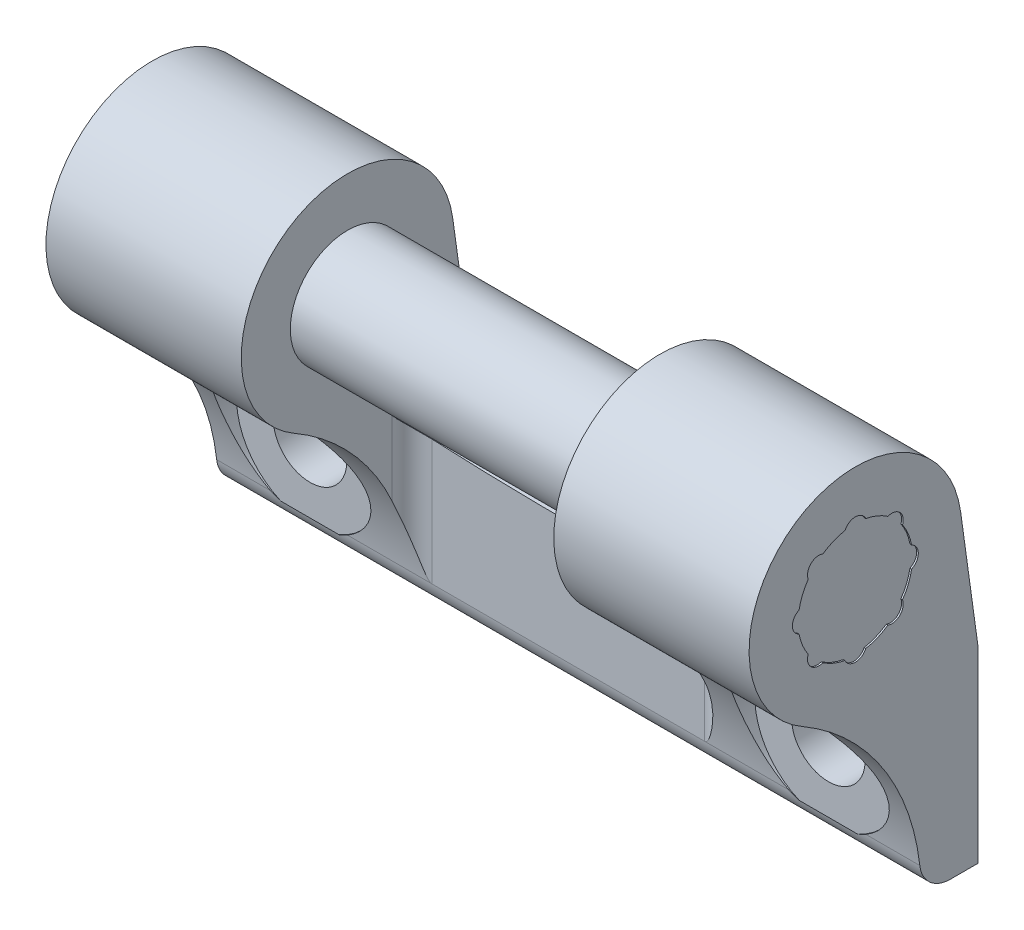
ISO-10303-21;
HEADER;
FILE_DESCRIPTION(('STEP AP214'),'2;1');
FILE_NAME('part.step','',(''),(''),'','','');
FILE_SCHEMA(('AUTOMOTIVE_DESIGN { 1 0 10303 214 1 1 1 1 }'));
ENDSEC;
DATA;
#1=APPLICATION_CONTEXT('core data for automotive mechanical design processes');
#2=APPLICATION_PROTOCOL_DEFINITION('international standard','automotive_design',2000,#1);
#3=PRODUCT_CONTEXT('',#1,'mechanical');
#4=PRODUCT('Part','Part','',(#3));
#5=PRODUCT_RELATED_PRODUCT_CATEGORY('part','',(#4));
#6=PRODUCT_DEFINITION_FORMATION('','',#4);
#7=PRODUCT_DEFINITION_CONTEXT('part definition',#1,'design');
#8=PRODUCT_DEFINITION('design','',#6,#7);
#9=PRODUCT_DEFINITION_SHAPE('','',#8);
#10=(LENGTH_UNIT() NAMED_UNIT(*) SI_UNIT(.MILLI.,.METRE.));
#11=(NAMED_UNIT(*) PLANE_ANGLE_UNIT() SI_UNIT($,.RADIAN.));
#12=(NAMED_UNIT(*) SI_UNIT($,.STERADIAN.) SOLID_ANGLE_UNIT());
#13=UNCERTAINTY_MEASURE_WITH_UNIT(LENGTH_MEASURE(1.E-05),#10,'distance_accuracy_value','');
#14=(GEOMETRIC_REPRESENTATION_CONTEXT(3) GLOBAL_UNCERTAINTY_ASSIGNED_CONTEXT((#13)) GLOBAL_UNIT_ASSIGNED_CONTEXT((#10,
#11,#12)) REPRESENTATION_CONTEXT('',''));
#15=CARTESIAN_POINT('',(0.,0.,0.));
#16=DIRECTION('',(0.,0.,1.));
#17=DIRECTION('',(1.,0.,0.));
#18=AXIS2_PLACEMENT_3D('',#15,#16,#17);
#19=CARTESIAN_POINT('',(25.3555555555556,12.75,7.5));
#20=DIRECTION('',(1.,0.,0.));
#21=DIRECTION('',(0.,1.,0.));
#22=AXIS2_PLACEMENT_3D('',#19,#20,#21);
#23=PLANE('',#22);
#24=CARTESIAN_POINT('',(25.3555555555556,10.5226136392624,9.72738636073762));
#25=DIRECTION('',(1.,0.,0.));
#26=DIRECTION('',(0.,1.,0.));
#27=AXIS2_PLACEMENT_3D('',#24,#25,#26);
#28=CIRCLE('',#27,0.7);
#29=CARTESIAN_POINT('',(25.3555555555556,10.7663355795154,10.3835872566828));
#30=VERTEX_POINT('',#29);
#31=CARTESIAN_POINT('',(25.3555555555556,9.86641274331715,9.48366442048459));
#32=VERTEX_POINT('',#31);
#33=EDGE_CURVE('E1008',#30,#32,#28,.T.);
#34=ORIENTED_EDGE('',*,*,#33,.F.);
#35=CARTESIAN_POINT('',(25.3555555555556,12.75,7.5));
#36=DIRECTION('',(1.,0.,0.));
#37=DIRECTION('',(0.,1.,0.));
#38=AXIS2_PLACEMENT_3D('',#35,#36,#37);
#39=CIRCLE('',#38,3.5);
#40=EDGE_CURVE('E1002',#32,#30,#39,.F.);
#41=ORIENTED_EDGE('',*,*,#40,.F.);
#42=EDGE_LOOP('',(#34,#41));
#43=FACE_BOUND('',#42,.T.);
#44=ADVANCED_FACE('F14',(#43),#23,.F.);
#45=CARTESIAN_POINT('',(25.3555555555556,12.75,7.5));
#46=DIRECTION('',(1.,0.,0.));
#47=DIRECTION('',(0.,1.,0.));
#48=AXIS2_PLACEMENT_3D('',#45,#46,#47);
#49=PLANE('',#48);
#50=CARTESIAN_POINT('',(25.3555555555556,15.9,7.5));
#51=DIRECTION('',(1.,0.,0.));
#52=DIRECTION('',(0.,1.,0.));
#53=AXIS2_PLACEMENT_3D('',#50,#51,#52);
#54=CIRCLE('',#53,0.7);
#55=CARTESIAN_POINT('',(25.3555555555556,16.1916666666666,6.86365845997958));
#56=VERTEX_POINT('',#55);
#57=CARTESIAN_POINT('',(25.3555555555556,16.1916666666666,8.13634154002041));
#58=VERTEX_POINT('',#57);
#59=EDGE_CURVE('E1036',#56,#58,#54,.T.);
#60=ORIENTED_EDGE('',*,*,#59,.F.);
#61=CARTESIAN_POINT('',(25.3555555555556,12.75,7.5));
#62=DIRECTION('',(1.,0.,0.));
#63=DIRECTION('',(0.,1.,0.));
#64=AXIS2_PLACEMENT_3D('',#61,#62,#63);
#65=CIRCLE('',#64,3.5);
#66=EDGE_CURVE('E978',#58,#56,#65,.F.);
#67=ORIENTED_EDGE('',*,*,#66,.F.);
#68=EDGE_LOOP('',(#60,#67));
#69=FACE_BOUND('',#68,.T.);
#70=ADVANCED_FACE('F829',(#69),#49,.F.);
#71=CARTESIAN_POINT('',(37.25,15.9,7.5));
#72=DIRECTION('',(1.,0.,0.));
#73=DIRECTION('',(0.,1.,0.));
#74=AXIS2_PLACEMENT_3D('',#71,#72,#73);
#75=CYLINDRICAL_SURFACE('',#74,0.7);
#76=DIRECTION('',(1.,0.,0.));
#77=VECTOR('',#76,1.);
#78=CARTESIAN_POINT('',(37.25,16.1916666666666,8.13634154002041));
#79=LINE('',#78,#77);
#80=CARTESIAN_POINT('',(25.4055555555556,16.1916666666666,8.13634154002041));
#81=VERTEX_POINT('',#80);
#82=EDGE_CURVE('E981',#81,#58,#79,.F.);
#83=ORIENTED_EDGE('',*,*,#82,.F.);
#84=CARTESIAN_POINT('',(25.4055555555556,15.9,7.5));
#85=DIRECTION('',(1.,0.,0.));
#86=DIRECTION('',(0.,0.,-1.));
#87=AXIS2_PLACEMENT_3D('',#84,#85,#86);
#88=CIRCLE('',#87,0.7);
#89=CARTESIAN_POINT('',(25.4055555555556,16.1916666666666,6.86365845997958));
#90=VERTEX_POINT('',#89);
#91=EDGE_CURVE('E33',#81,#90,#88,.F.);
#92=ORIENTED_EDGE('',*,*,#91,.T.);
#93=DIRECTION('',(1.,0.,0.));
#94=VECTOR('',#93,1.);
#95=CARTESIAN_POINT('',(37.25,16.1916666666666,6.86365845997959));
#96=LINE('',#95,#94);
#97=EDGE_CURVE('E977',#56,#90,#96,.T.);
#98=ORIENTED_EDGE('',*,*,#97,.F.);
#99=ORIENTED_EDGE('',*,*,#59,.T.);
#100=EDGE_LOOP('',(#83,#92,#98,#99));
#101=FACE_BOUND('',#100,.T.);
#102=ADVANCED_FACE('F836',(#101),#75,.T.);
#103=CARTESIAN_POINT('',(25.3555555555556,12.75,7.5));
#104=DIRECTION('',(1.,0.,0.));
#105=DIRECTION('',(0.,1.,0.));
#106=AXIS2_PLACEMENT_3D('',#103,#104,#105);
#107=PLANE('',#106);
#108=CARTESIAN_POINT('',(25.3555555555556,14.9773863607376,9.72738636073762));
#109=DIRECTION('',(1.,0.,0.));
#110=DIRECTION('',(0.,1.,0.));
#111=AXIS2_PLACEMENT_3D('',#108,#109,#110);
#112=CIRCLE('',#111,0.7);
#113=CARTESIAN_POINT('',(25.3555555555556,15.6335872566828,9.48366442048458));
#114=VERTEX_POINT('',#113);
#115=CARTESIAN_POINT('',(25.3555555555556,14.7336644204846,10.3835872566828));
#116=VERTEX_POINT('',#115);
#117=EDGE_CURVE('E1039',#114,#116,#112,.T.);
#118=ORIENTED_EDGE('',*,*,#117,.F.);
#119=CARTESIAN_POINT('',(25.3555555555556,12.75,7.5));
#120=DIRECTION('',(1.,0.,0.));
#121=DIRECTION('',(0.,1.,0.));
#122=AXIS2_PLACEMENT_3D('',#119,#120,#121);
#123=CIRCLE('',#122,3.5);
#124=EDGE_CURVE('E986',#116,#114,#123,.F.);
#125=ORIENTED_EDGE('',*,*,#124,.F.);
#126=EDGE_LOOP('',(#118,#125));
#127=FACE_BOUND('',#126,.T.);
#128=ADVANCED_FACE('F1230',(#127),#107,.F.);
#129=CARTESIAN_POINT('',(37.25,14.9773863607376,9.72738636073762));
#130=DIRECTION('',(1.,0.,0.));
#131=DIRECTION('',(0.,1.,0.));
#132=AXIS2_PLACEMENT_3D('',#129,#130,#131);
#133=CYLINDRICAL_SURFACE('',#132,0.7);
#134=DIRECTION('',(1.,0.,0.));
#135=VECTOR('',#134,1.);
#136=CARTESIAN_POINT('',(37.25,14.7336644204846,10.3835872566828));
#137=LINE('',#136,#135);
#138=CARTESIAN_POINT('',(25.4055555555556,14.7336644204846,10.3835872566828));
#139=VERTEX_POINT('',#138);
#140=EDGE_CURVE('E989',#139,#116,#137,.F.);
#141=ORIENTED_EDGE('',*,*,#140,.F.);
#142=CARTESIAN_POINT('',(25.4055555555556,14.9773863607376,9.72738636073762));
#143=DIRECTION('',(1.,0.,0.));
#144=DIRECTION('',(0.,0.,-1.));
#145=AXIS2_PLACEMENT_3D('',#142,#143,#144);
#146=CIRCLE('',#145,0.7);
#147=CARTESIAN_POINT('',(25.4055555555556,15.6335872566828,9.48366442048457));
#148=VERTEX_POINT('',#147);
#149=EDGE_CURVE('E24',#139,#148,#146,.F.);
#150=ORIENTED_EDGE('',*,*,#149,.T.);
#151=DIRECTION('',(1.,0.,0.));
#152=VECTOR('',#151,1.);
#153=CARTESIAN_POINT('',(37.25,15.6335872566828,9.48366442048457));
#154=LINE('',#153,#152);
#155=EDGE_CURVE('E985',#114,#148,#154,.T.);
#156=ORIENTED_EDGE('',*,*,#155,.F.);
#157=ORIENTED_EDGE('',*,*,#117,.T.);
#158=EDGE_LOOP('',(#141,#150,#156,#157));
#159=FACE_BOUND('',#158,.T.);
#160=ADVANCED_FACE('F1083',(#159),#133,.T.);
#161=CARTESIAN_POINT('',(25.3555555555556,12.75,7.5));
#162=DIRECTION('',(1.,0.,0.));
#163=DIRECTION('',(0.,1.,0.));
#164=AXIS2_PLACEMENT_3D('',#161,#162,#163);
#165=PLANE('',#164);
#166=CARTESIAN_POINT('',(25.3555555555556,12.75,10.65));
#167=DIRECTION('',(1.,0.,0.));
#168=DIRECTION('',(0.,1.,0.));
#169=AXIS2_PLACEMENT_3D('',#166,#167,#168);
#170=CIRCLE('',#169,0.7);
#171=CARTESIAN_POINT('',(25.3555555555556,13.3863415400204,10.9416666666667));
#172=VERTEX_POINT('',#171);
#173=CARTESIAN_POINT('',(25.3555555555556,12.1136584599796,10.9416666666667));
#174=VERTEX_POINT('',#173);
#175=EDGE_CURVE('E1042',#172,#174,#170,.T.);
#176=ORIENTED_EDGE('',*,*,#175,.F.);
#177=CARTESIAN_POINT('',(25.3555555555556,12.75,7.5));
#178=DIRECTION('',(1.,0.,0.));
#179=DIRECTION('',(0.,1.,0.));
#180=AXIS2_PLACEMENT_3D('',#177,#178,#179);
#181=CIRCLE('',#180,3.5);
#182=EDGE_CURVE('E994',#174,#172,#181,.F.);
#183=ORIENTED_EDGE('',*,*,#182,.F.);
#184=EDGE_LOOP('',(#176,#183));
#185=FACE_BOUND('',#184,.T.);
#186=ADVANCED_FACE('F842',(#185),#165,.F.);
#187=CARTESIAN_POINT('',(37.25,12.75,10.65));
#188=DIRECTION('',(1.,0.,0.));
#189=DIRECTION('',(0.,1.,0.));
#190=AXIS2_PLACEMENT_3D('',#187,#188,#189);
#191=CYLINDRICAL_SURFACE('',#190,0.7);
#192=DIRECTION('',(1.,0.,0.));
#193=VECTOR('',#192,1.);
#194=CARTESIAN_POINT('',(37.25,12.1136584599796,10.9416666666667));
#195=LINE('',#194,#193);
#196=CARTESIAN_POINT('',(25.4055555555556,12.1136584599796,10.9416666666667));
#197=VERTEX_POINT('',#196);
#198=EDGE_CURVE('E997',#197,#174,#195,.F.);
#199=ORIENTED_EDGE('',*,*,#198,.F.);
#200=CARTESIAN_POINT('',(25.4055555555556,12.75,10.65));
#201=DIRECTION('',(1.,0.,0.));
#202=DIRECTION('',(0.,0.,-1.));
#203=AXIS2_PLACEMENT_3D('',#200,#201,#202);
#204=CIRCLE('',#203,0.7);
#205=CARTESIAN_POINT('',(25.4055555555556,13.3863415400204,10.9416666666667));
#206=VERTEX_POINT('',#205);
#207=EDGE_CURVE('E9',#197,#206,#204,.F.);
#208=ORIENTED_EDGE('',*,*,#207,.T.);
#209=DIRECTION('',(1.,0.,0.));
#210=VECTOR('',#209,1.);
#211=CARTESIAN_POINT('',(37.25,13.3863415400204,10.9416666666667));
#212=LINE('',#211,#210);
#213=EDGE_CURVE('E993',#172,#206,#212,.T.);
#214=ORIENTED_EDGE('',*,*,#213,.F.);
#215=ORIENTED_EDGE('',*,*,#175,.T.);
#216=EDGE_LOOP('',(#199,#208,#214,#215));
#217=FACE_BOUND('',#216,.T.);
#218=ADVANCED_FACE('F1219',(#217),#191,.T.);
#219=CARTESIAN_POINT('',(25.3555555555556,12.75,7.5));
#220=DIRECTION('',(1.,0.,0.));
#221=DIRECTION('',(0.,1.,0.));
#222=AXIS2_PLACEMENT_3D('',#219,#220,#221);
#223=PLANE('',#222);
#224=CARTESIAN_POINT('',(25.3555555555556,12.75,4.35));
#225=DIRECTION('',(1.,0.,0.));
#226=DIRECTION('',(0.,1.,0.));
#227=AXIS2_PLACEMENT_3D('',#224,#225,#226);
#228=CIRCLE('',#227,0.7);
#229=CARTESIAN_POINT('',(25.3555555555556,12.1136584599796,4.05833333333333));
#230=VERTEX_POINT('',#229);
#231=CARTESIAN_POINT('',(25.3555555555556,13.3863415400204,4.05833333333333));
#232=VERTEX_POINT('',#231);
#233=EDGE_CURVE('E1030',#230,#232,#228,.T.);
#234=ORIENTED_EDGE('',*,*,#233,.F.);
#235=CARTESIAN_POINT('',(25.3555555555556,12.75,7.5));
#236=DIRECTION('',(1.,0.,0.));
#237=DIRECTION('',(0.,1.,0.));
#238=AXIS2_PLACEMENT_3D('',#235,#236,#237);
#239=CIRCLE('',#238,3.5);
#240=EDGE_CURVE('E936',#232,#230,#239,.F.);
#241=ORIENTED_EDGE('',*,*,#240,.F.);
#242=EDGE_LOOP('',(#234,#241));
#243=FACE_BOUND('',#242,.T.);
#244=ADVANCED_FACE('F1229',(#243),#223,.F.);
#245=CARTESIAN_POINT('',(37.25,14.9773863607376,5.27261363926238));
#246=DIRECTION('',(1.,0.,0.));
#247=DIRECTION('',(0.,1.,0.));
#248=AXIS2_PLACEMENT_3D('',#245,#246,#247);
#249=CYLINDRICAL_SURFACE('',#248,0.7);
#250=DIRECTION('',(1.,0.,0.));
#251=VECTOR('',#250,1.);
#252=CARTESIAN_POINT('',(37.25,15.6335872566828,5.51633557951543));
#253=LINE('',#252,#251);
#254=CARTESIAN_POINT('',(25.4055555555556,15.6335872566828,5.51633557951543));
#255=VERTEX_POINT('',#254);
#256=CARTESIAN_POINT('',(25.3555555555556,15.6335872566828,5.51633557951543));
#257=VERTEX_POINT('',#256);
#258=EDGE_CURVE('E974',#255,#257,#253,.F.);
#259=ORIENTED_EDGE('',*,*,#258,.F.);
#260=CARTESIAN_POINT('',(25.4055555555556,14.9773863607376,5.27261363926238));
#261=DIRECTION('',(1.,0.,0.));
#262=DIRECTION('',(0.,0.,-1.));
#263=AXIS2_PLACEMENT_3D('',#260,#261,#262);
#264=CIRCLE('',#263,0.7);
#265=CARTESIAN_POINT('',(25.4055555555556,14.7336644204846,4.61641274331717));
#266=VERTEX_POINT('',#265);
#267=EDGE_CURVE('E1073',#255,#266,#264,.F.);
#268=ORIENTED_EDGE('',*,*,#267,.T.);
#269=DIRECTION('',(1.,0.,0.));
#270=VECTOR('',#269,1.);
#271=CARTESIAN_POINT('',(37.25,14.7336644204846,4.61641274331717));
#272=LINE('',#271,#270);
#273=CARTESIAN_POINT('',(25.3555555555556,14.7336644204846,4.61641274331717));
#274=VERTEX_POINT('',#273);
#275=EDGE_CURVE('E943',#274,#266,#272,.T.);
#276=ORIENTED_EDGE('',*,*,#275,.F.);
#277=CARTESIAN_POINT('',(25.3555555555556,14.9773863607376,5.27261363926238));
#278=DIRECTION('',(1.,0.,0.));
#279=DIRECTION('',(0.,1.,0.));
#280=AXIS2_PLACEMENT_3D('',#277,#278,#279);
#281=CIRCLE('',#280,0.7);
#282=EDGE_CURVE('E1033',#274,#257,#281,.T.);
#283=ORIENTED_EDGE('',*,*,#282,.T.);
#284=EDGE_LOOP('',(#259,#268,#276,#283));
#285=FACE_BOUND('',#284,.T.);
#286=ADVANCED_FACE('F1244',(#285),#249,.T.);
#287=CARTESIAN_POINT('',(25.3555555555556,12.75,7.5));
#288=DIRECTION('',(1.,0.,0.));
#289=DIRECTION('',(0.,1.,0.));
#290=AXIS2_PLACEMENT_3D('',#287,#288,#289);
#291=PLANE('',#290);
#292=ORIENTED_EDGE('',*,*,#282,.F.);
#293=CARTESIAN_POINT('',(25.3555555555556,12.75,7.5));
#294=DIRECTION('',(1.,0.,0.));
#295=DIRECTION('',(0.,1.,0.));
#296=AXIS2_PLACEMENT_3D('',#293,#294,#295);
#297=CIRCLE('',#296,3.5);
#298=EDGE_CURVE('E944',#257,#274,#297,.F.);
#299=ORIENTED_EDGE('',*,*,#298,.F.);
#300=EDGE_LOOP('',(#292,#299));
#301=FACE_BOUND('',#300,.T.);
#302=ADVANCED_FACE('F1241',(#301),#291,.F.);
#303=CARTESIAN_POINT('',(6.2944444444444,12.75,7.5));
#304=DIRECTION('',(1.,0.,0.));
#305=DIRECTION('',(0.,1.,0.));
#306=AXIS2_PLACEMENT_3D('',#303,#304,#305);
#307=PLANE('',#306);
#308=CARTESIAN_POINT('',(6.2944444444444,12.75,7.5));
#309=DIRECTION('',(1.,0.,0.));
#310=DIRECTION('',(0.,1.,0.));
#311=AXIS2_PLACEMENT_3D('',#308,#309,#310);
#312=CIRCLE('',#311,3.5);
#313=CARTESIAN_POINT('',(6.2944444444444,16.25,7.5));
#314=VERTEX_POINT('',#313);
#315=EDGE_CURVE('E1117',#314,#314,#312,.T.);
#316=ORIENTED_EDGE('',*,*,#315,.F.);
#317=EDGE_LOOP('',(#316));
#318=FACE_BOUND('',#317,.T.);
#319=CARTESIAN_POINT('',(6.2944444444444,-5.5,18.0366424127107));
#320=DIRECTION('',(1.,0.,0.));
#321=DIRECTION('',(0.,1.,0.));
#322=AXIS2_PLACEMENT_3D('',#319,#320,#321);
#323=CIRCLE('',#322,14.5732848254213);
#324=CARTESIAN_POINT('',(6.2944444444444,0.542351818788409,4.7750205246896));
#325=VERTEX_POINT('',#324);
#326=CARTESIAN_POINT('',(6.2944444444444,7.1208348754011,10.75));
#327=VERTEX_POINT('',#326);
#328=EDGE_CURVE('E433',#325,#327,#323,.T.);
#329=ORIENTED_EDGE('',*,*,#328,.F.);
#330=DIRECTION('',(0.,-1.,0.));
#331=VECTOR('',#330,1.);
#332=CARTESIAN_POINT('',(6.2944444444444,5.0453708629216,4.7750205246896));
#333=LINE('',#332,#331);
#334=CARTESIAN_POINT('',(6.2944444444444,5.0453708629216,4.7750205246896));
#335=VERTEX_POINT('',#334);
#336=EDGE_CURVE('E695',#335,#325,#333,.T.);
#337=ORIENTED_EDGE('',*,*,#336,.F.);
#338=DIRECTION('',(0.,0.,-1.));
#339=VECTOR('',#338,1.);
#340=CARTESIAN_POINT('',(6.2944444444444,5.0453708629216,0.));
#341=LINE('',#340,#339);
#342=CARTESIAN_POINT('',(6.2944444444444,5.0453708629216,0.));
#343=VERTEX_POINT('',#342);
#344=EDGE_CURVE('E671',#335,#343,#341,.T.);
#345=ORIENTED_EDGE('',*,*,#344,.T.);
#346=DIRECTION('',(0.,-1.,0.));
#347=VECTOR('',#346,1.);
#348=CARTESIAN_POINT('',(6.2944444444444,5.0453708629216,0.));
#349=LINE('',#348,#347);
#350=CARTESIAN_POINT('',(6.2944444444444,6.,0.));
#351=VERTEX_POINT('',#350);
#352=EDGE_CURVE('E697',#351,#343,#349,.T.);
#353=ORIENTED_EDGE('',*,*,#352,.F.);
#354=DIRECTION('',(0.,0.990490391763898,0.137581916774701));
#355=VECTOR('',#354,1.);
#356=CARTESIAN_POINT('',(6.2944444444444,6.,0.));
#357=LINE('',#356,#355);
#358=CARTESIAN_POINT('',(6.2944444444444,13.6442824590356,1.06181245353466));
#359=VERTEX_POINT('',#358);
#360=EDGE_CURVE('E638',#359,#351,#357,.F.);
#361=ORIENTED_EDGE('',*,*,#360,.F.);
#362=CARTESIAN_POINT('',(6.2944444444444,12.75,7.5));
#363=DIRECTION('',(1.,0.,0.));
#364=DIRECTION('',(0.,1.,0.));
#365=AXIS2_PLACEMENT_3D('',#362,#363,#364);
#366=CIRCLE('',#365,6.5);
#367=EDGE_CURVE('E762',#327,#359,#366,.F.);
#368=ORIENTED_EDGE('',*,*,#367,.F.);
#369=EDGE_LOOP('',(#329,#337,#345,#353,#361,#368));
#370=FACE_BOUND('',#369,.T.);
#371=ADVANCED_FACE('F761',(#318,#370),#307,.T.);
#372=CARTESIAN_POINT('',(37.25,10.5226136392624,9.72738636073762));
#373=DIRECTION('',(1.,0.,0.));
#374=DIRECTION('',(0.,1.,0.));
#375=AXIS2_PLACEMENT_3D('',#372,#373,#374);
#376=CYLINDRICAL_SURFACE('',#375,0.7);
#377=DIRECTION('',(1.,0.,0.));
#378=VECTOR('',#377,1.);
#379=CARTESIAN_POINT('',(37.25,9.86641274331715,9.48366442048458));
#380=LINE('',#379,#378);
#381=CARTESIAN_POINT('',(25.4055555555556,9.86641274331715,9.48366442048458));
#382=VERTEX_POINT('',#381);
#383=EDGE_CURVE('E1122',#382,#32,#380,.F.);
#384=ORIENTED_EDGE('',*,*,#383,.F.);
#385=CARTESIAN_POINT('',(25.4055555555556,10.5226136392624,9.72738636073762));
#386=DIRECTION('',(1.,0.,0.));
#387=DIRECTION('',(0.,0.,-1.));
#388=AXIS2_PLACEMENT_3D('',#385,#386,#387);
#389=CIRCLE('',#388,0.7);
#390=CARTESIAN_POINT('',(25.4055555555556,10.7663355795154,10.3835872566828));
#391=VERTEX_POINT('',#390);
#392=EDGE_CURVE('E1064',#382,#391,#389,.F.);
#393=ORIENTED_EDGE('',*,*,#392,.T.);
#394=DIRECTION('',(1.,0.,0.));
#395=VECTOR('',#394,1.);
#396=CARTESIAN_POINT('',(37.25,10.7663355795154,10.3835872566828));
#397=LINE('',#396,#395);
#398=EDGE_CURVE('E1001',#30,#391,#397,.T.);
#399=ORIENTED_EDGE('',*,*,#398,.F.);
#400=ORIENTED_EDGE('',*,*,#33,.T.);
#401=EDGE_LOOP('',(#384,#393,#399,#400));
#402=FACE_BOUND('',#401,.T.);
#403=ADVANCED_FACE('F1268',(#402),#376,.T.);
#404=CARTESIAN_POINT('',(25.3555555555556,12.75,7.5));
#405=DIRECTION('',(1.,0.,0.));
#406=DIRECTION('',(0.,1.,0.));
#407=AXIS2_PLACEMENT_3D('',#404,#405,#406);
#408=PLANE('',#407);
#409=CARTESIAN_POINT('',(25.3555555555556,9.6,7.5));
#410=DIRECTION('',(1.,0.,0.));
#411=DIRECTION('',(0.,1.,0.));
#412=AXIS2_PLACEMENT_3D('',#409,#410,#411);
#413=CIRCLE('',#412,0.7);
#414=CARTESIAN_POINT('',(25.3555555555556,9.30833333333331,8.13634154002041));
#415=VERTEX_POINT('',#414);
#416=CARTESIAN_POINT('',(25.3555555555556,9.30833333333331,6.86365845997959));
#417=VERTEX_POINT('',#416);
#418=EDGE_CURVE('E1024',#415,#417,#413,.T.);
#419=ORIENTED_EDGE('',*,*,#418,.F.);
#420=CARTESIAN_POINT('',(25.3555555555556,12.75,7.5));
#421=DIRECTION('',(1.,0.,0.));
#422=DIRECTION('',(0.,1.,0.));
#423=AXIS2_PLACEMENT_3D('',#420,#421,#422);
#424=CIRCLE('',#423,3.5);
#425=EDGE_CURVE('E921',#417,#415,#424,.F.);
#426=ORIENTED_EDGE('',*,*,#425,.F.);
#427=EDGE_LOOP('',(#419,#426));
#428=FACE_BOUND('',#427,.T.);
#429=ADVANCED_FACE('F1265',(#428),#408,.F.);
#430=CARTESIAN_POINT('',(37.25,9.6,7.5));
#431=DIRECTION('',(1.,0.,0.));
#432=DIRECTION('',(0.,1.,0.));
#433=AXIS2_PLACEMENT_3D('',#430,#431,#432);
#434=CYLINDRICAL_SURFACE('',#433,0.7);
#435=CARTESIAN_POINT('',(25.4055555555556,9.6,7.5));
#436=DIRECTION('',(1.,0.,0.));
#437=DIRECTION('',(0.,1.,0.));
#438=AXIS2_PLACEMENT_3D('',#435,#436,#437);
#439=CIRCLE('',#438,0.7);
#440=CARTESIAN_POINT('',(25.4055555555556,9.30833333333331,8.13634154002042));
#441=VERTEX_POINT('',#440);
#442=CARTESIAN_POINT('',(25.4055555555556,9.30833333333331,6.86365845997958));
#443=VERTEX_POINT('',#442);
#444=EDGE_CURVE('E442',#441,#443,#439,.T.);
#445=ORIENTED_EDGE('',*,*,#444,.F.);
#446=DIRECTION('',(1.,0.,0.));
#447=VECTOR('',#446,1.);
#448=CARTESIAN_POINT('',(37.25,9.30833333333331,8.13634154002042));
#449=LINE('',#448,#447);
#450=EDGE_CURVE('E1123',#415,#441,#449,.T.);
#451=ORIENTED_EDGE('',*,*,#450,.F.);
#452=ORIENTED_EDGE('',*,*,#418,.T.);
#453=DIRECTION('',(1.,0.,0.));
#454=VECTOR('',#453,1.);
#455=CARTESIAN_POINT('',(37.25,9.30833333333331,6.86365845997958));
#456=LINE('',#455,#454);
#457=EDGE_CURVE('E917',#443,#417,#456,.F.);
#458=ORIENTED_EDGE('',*,*,#457,.F.);
#459=EDGE_LOOP('',(#445,#451,#452,#458));
#460=FACE_BOUND('',#459,.T.);
#461=ADVANCED_FACE('F1260',(#460),#434,.T.);
#462=CARTESIAN_POINT('',(25.3555555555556,12.75,7.5));
#463=DIRECTION('',(1.,0.,0.));
#464=DIRECTION('',(0.,1.,0.));
#465=AXIS2_PLACEMENT_3D('',#462,#463,#464);
#466=PLANE('',#465);
#467=CARTESIAN_POINT('',(25.3555555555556,10.5226136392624,5.27261363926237));
#468=DIRECTION('',(1.,0.,0.));
#469=DIRECTION('',(0.,1.,0.));
#470=AXIS2_PLACEMENT_3D('',#467,#468,#469);
#471=CIRCLE('',#470,0.7);
#472=CARTESIAN_POINT('',(25.3555555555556,9.86641274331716,5.51633557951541));
#473=VERTEX_POINT('',#472);
#474=CARTESIAN_POINT('',(25.3555555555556,10.7663355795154,4.61641274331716));
#475=VERTEX_POINT('',#474);
#476=EDGE_CURVE('E1027',#473,#475,#471,.T.);
#477=ORIENTED_EDGE('',*,*,#476,.F.);
#478=CARTESIAN_POINT('',(25.3555555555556,12.75,7.5));
#479=DIRECTION('',(1.,0.,0.));
#480=DIRECTION('',(0.,1.,0.));
#481=AXIS2_PLACEMENT_3D('',#478,#479,#480);
#482=CIRCLE('',#481,3.5);
#483=EDGE_CURVE('E924',#475,#473,#482,.F.);
#484=ORIENTED_EDGE('',*,*,#483,.F.);
#485=EDGE_LOOP('',(#477,#484));
#486=FACE_BOUND('',#485,.T.);
#487=ADVANCED_FACE('F1257',(#486),#466,.F.);
#488=CARTESIAN_POINT('',(37.25,10.5226136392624,5.27261363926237));
#489=DIRECTION('',(1.,0.,0.));
#490=DIRECTION('',(0.,1.,0.));
#491=AXIS2_PLACEMENT_3D('',#488,#489,#490);
#492=CYLINDRICAL_SURFACE('',#491,0.7);
#493=DIRECTION('',(1.,0.,0.));
#494=VECTOR('',#493,1.);
#495=CARTESIAN_POINT('',(37.25,10.7663355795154,4.61641274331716));
#496=LINE('',#495,#494);
#497=CARTESIAN_POINT('',(25.4055555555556,10.7663355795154,4.61641274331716));
#498=VERTEX_POINT('',#497);
#499=EDGE_CURVE('E931',#498,#475,#496,.F.);
#500=ORIENTED_EDGE('',*,*,#499,.F.);
#501=CARTESIAN_POINT('',(25.4055555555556,10.5226136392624,5.27261363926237));
#502=DIRECTION('',(1.,0.,0.));
#503=DIRECTION('',(0.,0.,-1.));
#504=AXIS2_PLACEMENT_3D('',#501,#502,#503);
#505=CIRCLE('',#504,0.7);
#506=CARTESIAN_POINT('',(25.4055555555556,9.86641274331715,5.51633557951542));
#507=VERTEX_POINT('',#506);
#508=EDGE_CURVE('E1067',#498,#507,#505,.F.);
#509=ORIENTED_EDGE('',*,*,#508,.T.);
#510=DIRECTION('',(1.,0.,0.));
#511=VECTOR('',#510,1.);
#512=CARTESIAN_POINT('',(37.25,9.86641274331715,5.51633557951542));
#513=LINE('',#512,#511);
#514=EDGE_CURVE('E918',#473,#507,#513,.T.);
#515=ORIENTED_EDGE('',*,*,#514,.F.);
#516=ORIENTED_EDGE('',*,*,#476,.T.);
#517=EDGE_LOOP('',(#500,#509,#515,#516));
#518=FACE_BOUND('',#517,.T.);
#519=ADVANCED_FACE('F1255',(#518),#492,.T.);
#520=CARTESIAN_POINT('',(37.25,12.75,4.35));
#521=DIRECTION('',(1.,0.,0.));
#522=DIRECTION('',(0.,1.,0.));
#523=AXIS2_PLACEMENT_3D('',#520,#521,#522);
#524=CYLINDRICAL_SURFACE('',#523,0.7);
#525=DIRECTION('',(1.,0.,0.));
#526=VECTOR('',#525,1.);
#527=CARTESIAN_POINT('',(37.25,13.3863415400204,4.05833333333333));
#528=LINE('',#527,#526);
#529=CARTESIAN_POINT('',(25.4055555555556,13.3863415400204,4.05833333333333));
#530=VERTEX_POINT('',#529);
#531=EDGE_CURVE('E939',#530,#232,#528,.F.);
#532=ORIENTED_EDGE('',*,*,#531,.F.);
#533=CARTESIAN_POINT('',(25.4055555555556,12.75,4.35));
#534=DIRECTION('',(1.,0.,0.));
#535=DIRECTION('',(0.,0.,-1.));
#536=AXIS2_PLACEMENT_3D('',#533,#534,#535);
#537=CIRCLE('',#536,0.7);
#538=CARTESIAN_POINT('',(25.4055555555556,12.1136584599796,4.05833333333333));
#539=VERTEX_POINT('',#538);
#540=EDGE_CURVE('E1070',#530,#539,#537,.F.);
#541=ORIENTED_EDGE('',*,*,#540,.T.);
#542=DIRECTION('',(1.,0.,0.));
#543=VECTOR('',#542,1.);
#544=CARTESIAN_POINT('',(37.25,12.1136584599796,4.05833333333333));
#545=LINE('',#544,#543);
#546=EDGE_CURVE('E935',#230,#539,#545,.T.);
#547=ORIENTED_EDGE('',*,*,#546,.F.);
#548=ORIENTED_EDGE('',*,*,#233,.T.);
#549=EDGE_LOOP('',(#532,#541,#547,#548));
#550=FACE_BOUND('',#549,.T.);
#551=ADVANCED_FACE('F1252',(#550),#524,.T.);
#552=CARTESIAN_POINT('',(37.25,12.75,7.5));
#553=DIRECTION('',(1.,0.,0.));
#554=DIRECTION('',(0.,1.,0.));
#555=AXIS2_PLACEMENT_3D('',#552,#553,#554);
#556=CYLINDRICAL_SURFACE('',#555,3.5);
#557=ORIENTED_EDGE('',*,*,#258,.T.);
#558=ORIENTED_EDGE('',*,*,#298,.T.);
#559=ORIENTED_EDGE('',*,*,#275,.T.);
#560=CARTESIAN_POINT('',(25.4055555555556,12.75,7.5));
#561=DIRECTION('',(1.,0.,0.));
#562=DIRECTION('',(0.,0.,-1.));
#563=AXIS2_PLACEMENT_3D('',#560,#561,#562);
#564=CIRCLE('',#563,3.5);
#565=EDGE_CURVE('E1053',#266,#530,#564,.F.);
#566=ORIENTED_EDGE('',*,*,#565,.T.);
#567=ORIENTED_EDGE('',*,*,#531,.T.);
#568=ORIENTED_EDGE('',*,*,#240,.T.);
#569=ORIENTED_EDGE('',*,*,#546,.T.);
#570=EDGE_CURVE('E1058',#539,#498,#564,.F.);
#571=ORIENTED_EDGE('',*,*,#570,.T.);
#572=ORIENTED_EDGE('',*,*,#499,.T.);
#573=ORIENTED_EDGE('',*,*,#483,.T.);
#574=ORIENTED_EDGE('',*,*,#514,.T.);
#575=EDGE_CURVE('E1897',#507,#443,#564,.F.);
#576=ORIENTED_EDGE('',*,*,#575,.T.);
#577=ORIENTED_EDGE('',*,*,#457,.T.);
#578=ORIENTED_EDGE('',*,*,#425,.T.);
#579=ORIENTED_EDGE('',*,*,#450,.T.);
#580=EDGE_CURVE('E1056',#441,#382,#564,.F.);
#581=ORIENTED_EDGE('',*,*,#580,.T.);
#582=ORIENTED_EDGE('',*,*,#383,.T.);
#583=ORIENTED_EDGE('',*,*,#40,.T.);
#584=ORIENTED_EDGE('',*,*,#398,.T.);
#585=CARTESIAN_POINT('',(25.4055555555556,12.75,7.5));
#586=DIRECTION('',(1.,0.,0.));
#587=DIRECTION('',(0.,0.,-1.));
#588=AXIS2_PLACEMENT_3D('',#585,#586,#587);
#589=CIRCLE('',#588,3.5);
#590=EDGE_CURVE('E1063',#391,#197,#589,.F.);
#591=ORIENTED_EDGE('',*,*,#590,.T.);
#592=ORIENTED_EDGE('',*,*,#198,.T.);
#593=ORIENTED_EDGE('',*,*,#182,.T.);
#594=ORIENTED_EDGE('',*,*,#213,.T.);
#595=EDGE_CURVE('E1093',#206,#139,#589,.F.);
#596=ORIENTED_EDGE('',*,*,#595,.T.);
#597=ORIENTED_EDGE('',*,*,#140,.T.);
#598=ORIENTED_EDGE('',*,*,#124,.T.);
#599=ORIENTED_EDGE('',*,*,#155,.T.);
#600=EDGE_CURVE('E1062',#148,#81,#589,.F.);
#601=ORIENTED_EDGE('',*,*,#600,.T.);
#602=ORIENTED_EDGE('',*,*,#82,.T.);
#603=ORIENTED_EDGE('',*,*,#66,.T.);
#604=ORIENTED_EDGE('',*,*,#97,.T.);
#605=EDGE_CURVE('E1059',#90,#255,#589,.F.);
#606=ORIENTED_EDGE('',*,*,#605,.T.);
#607=EDGE_LOOP('',(#557,#558,#559,#566,#567,#568,#569,#571,#572,#573,#574,#576,#577,#578,#579,
#581,#582,#583,#584,#591,#592,#593,#594,#596,#597,#598,#599,#601,#602,#603,#604,#606));
#608=FACE_BOUND('',#607,.T.);
#609=ORIENTED_EDGE('',*,*,#315,.T.);
#610=EDGE_LOOP('',(#609));
#611=FACE_BOUND('',#610,.T.);
#612=ADVANCED_FACE('F1095',(#608,#611),#556,.T.);
#613=CARTESIAN_POINT('',(-5.55,12.75,7.5));
#614=DIRECTION('',(1.,0.,0.));
#615=DIRECTION('',(0.,1.,0.));
#616=AXIS2_PLACEMENT_3D('',#613,#614,#615);
#617=PLANE('',#616);
#618=CARTESIAN_POINT('',(-5.55,9.6,7.5));
#619=DIRECTION('',(1.,0.,0.));
#620=DIRECTION('',(0.,1.,0.));
#621=AXIS2_PLACEMENT_3D('',#618,#619,#620);
#622=CIRCLE('',#621,0.7);
#623=CARTESIAN_POINT('',(-5.55,9.30833333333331,8.13634154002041));
#624=VERTEX_POINT('',#623);
#625=CARTESIAN_POINT('',(-5.55,9.30833333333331,6.86365845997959));
#626=VERTEX_POINT('',#625);
#627=EDGE_CURVE('E950',#624,#626,#622,.T.);
#628=ORIENTED_EDGE('',*,*,#627,.F.);
#629=CARTESIAN_POINT('',(-5.55,12.75,7.5));
#630=DIRECTION('',(1.,0.,0.));
#631=DIRECTION('',(0.,1.,0.));
#632=AXIS2_PLACEMENT_3D('',#629,#630,#631);
#633=CIRCLE('',#632,3.5);
#634=CARTESIAN_POINT('',(-5.55,9.86641274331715,9.48366442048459));
#635=VERTEX_POINT('',#634);
#636=EDGE_CURVE('E1120',#635,#624,#633,.T.);
#637=ORIENTED_EDGE('',*,*,#636,.F.);
#638=CARTESIAN_POINT('',(-5.55,10.5226136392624,9.72738636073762));
#639=DIRECTION('',(1.,0.,0.));
#640=DIRECTION('',(0.,1.,0.));
#641=AXIS2_PLACEMENT_3D('',#638,#639,#640);
#642=CIRCLE('',#641,0.7);
#643=CARTESIAN_POINT('',(-5.55,10.7663355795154,10.3835872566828));
#644=VERTEX_POINT('',#643);
#645=EDGE_CURVE('E953',#644,#635,#642,.T.);
#646=ORIENTED_EDGE('',*,*,#645,.F.);
#647=CARTESIAN_POINT('',(-5.55,12.75,7.5));
#648=DIRECTION('',(1.,0.,0.));
#649=DIRECTION('',(0.,1.,0.));
#650=AXIS2_PLACEMENT_3D('',#647,#648,#649);
#651=CIRCLE('',#650,3.5);
#652=CARTESIAN_POINT('',(-5.55,12.1136584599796,10.9416666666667));
#653=VERTEX_POINT('',#652);
#654=EDGE_CURVE('E956',#653,#644,#651,.T.);
#655=ORIENTED_EDGE('',*,*,#654,.F.);
#656=CARTESIAN_POINT('',(-5.55,12.75,10.65));
#657=DIRECTION('',(1.,0.,0.));
#658=DIRECTION('',(0.,1.,0.));
#659=AXIS2_PLACEMENT_3D('',#656,#657,#658);
#660=CIRCLE('',#659,0.7);
#661=CARTESIAN_POINT('',(-5.55,13.3863415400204,10.9416666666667));
#662=VERTEX_POINT('',#661);
#663=EDGE_CURVE('E1045',#662,#653,#660,.T.);
#664=ORIENTED_EDGE('',*,*,#663,.F.);
#665=CARTESIAN_POINT('',(-5.55,12.75,7.5));
#666=DIRECTION('',(1.,0.,0.));
#667=DIRECTION('',(0.,1.,0.));
#668=AXIS2_PLACEMENT_3D('',#665,#666,#667);
#669=CIRCLE('',#668,3.5);
#670=CARTESIAN_POINT('',(-5.55,14.7336644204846,10.3835872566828));
#671=VERTEX_POINT('',#670);
#672=EDGE_CURVE('E959',#671,#662,#669,.T.);
#673=ORIENTED_EDGE('',*,*,#672,.F.);
#674=CARTESIAN_POINT('',(-5.55,14.9773863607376,9.72738636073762));
#675=DIRECTION('',(1.,0.,0.));
#676=DIRECTION('',(0.,1.,0.));
#677=AXIS2_PLACEMENT_3D('',#674,#675,#676);
#678=CIRCLE('',#677,0.7);
#679=CARTESIAN_POINT('',(-5.55,15.6335872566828,9.48366442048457));
#680=VERTEX_POINT('',#679);
#681=EDGE_CURVE('E1048',#680,#671,#678,.T.);
#682=ORIENTED_EDGE('',*,*,#681,.F.);
#683=CARTESIAN_POINT('',(-5.55,12.75,7.5));
#684=DIRECTION('',(1.,0.,0.));
#685=DIRECTION('',(0.,1.,0.));
#686=AXIS2_PLACEMENT_3D('',#683,#684,#685);
#687=CIRCLE('',#686,3.5);
#688=CARTESIAN_POINT('',(-5.55,16.1916666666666,8.13634154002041));
#689=VERTEX_POINT('',#688);
#690=EDGE_CURVE('E962',#689,#680,#687,.T.);
#691=ORIENTED_EDGE('',*,*,#690,.F.);
#692=CARTESIAN_POINT('',(-5.55,15.9,7.5));
#693=DIRECTION('',(1.,0.,0.));
#694=DIRECTION('',(0.,1.,0.));
#695=AXIS2_PLACEMENT_3D('',#692,#693,#694);
#696=CIRCLE('',#695,0.7);
#697=CARTESIAN_POINT('',(-5.55,16.1916666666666,6.86365845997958));
#698=VERTEX_POINT('',#697);
#699=EDGE_CURVE('E686',#698,#689,#696,.T.);
#700=ORIENTED_EDGE('',*,*,#699,.F.);
#701=CARTESIAN_POINT('',(-5.55,12.75,7.5));
#702=DIRECTION('',(1.,0.,0.));
#703=DIRECTION('',(0.,1.,0.));
#704=AXIS2_PLACEMENT_3D('',#701,#702,#703);
#705=CIRCLE('',#704,3.5);
#706=CARTESIAN_POINT('',(-5.55,15.6335872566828,5.51633557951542));
#707=VERTEX_POINT('',#706);
#708=EDGE_CURVE('E965',#707,#698,#705,.T.);
#709=ORIENTED_EDGE('',*,*,#708,.F.);
#710=CARTESIAN_POINT('',(-5.55,14.9773863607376,5.27261363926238));
#711=DIRECTION('',(1.,0.,0.));
#712=DIRECTION('',(0.,1.,0.));
#713=AXIS2_PLACEMENT_3D('',#710,#711,#712);
#714=CIRCLE('',#713,0.7);
#715=CARTESIAN_POINT('',(-5.55,14.7336644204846,4.61641274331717));
#716=VERTEX_POINT('',#715);
#717=EDGE_CURVE('E947',#716,#707,#714,.T.);
#718=ORIENTED_EDGE('',*,*,#717,.F.);
#719=CARTESIAN_POINT('',(-5.55,12.75,7.5));
#720=DIRECTION('',(1.,0.,0.));
#721=DIRECTION('',(0.,1.,0.));
#722=AXIS2_PLACEMENT_3D('',#719,#720,#721);
#723=CIRCLE('',#722,3.5);
#724=CARTESIAN_POINT('',(-5.55,13.3863415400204,4.05833333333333));
#725=VERTEX_POINT('',#724);
#726=EDGE_CURVE('E1057',#725,#716,#723,.T.);
#727=ORIENTED_EDGE('',*,*,#726,.F.);
#728=CARTESIAN_POINT('',(-5.55,12.75,4.35));
#729=DIRECTION('',(1.,0.,0.));
#730=DIRECTION('',(0.,1.,0.));
#731=AXIS2_PLACEMENT_3D('',#728,#729,#730);
#732=CIRCLE('',#731,0.7);
#733=CARTESIAN_POINT('',(-5.55,12.1136584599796,4.05833333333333));
#734=VERTEX_POINT('',#733);
#735=EDGE_CURVE('E968',#734,#725,#732,.T.);
#736=ORIENTED_EDGE('',*,*,#735,.F.);
#737=CARTESIAN_POINT('',(-5.55,12.75,7.5));
#738=DIRECTION('',(1.,0.,0.));
#739=DIRECTION('',(0.,1.,0.));
#740=AXIS2_PLACEMENT_3D('',#737,#738,#739);
#741=CIRCLE('',#740,3.5);
#742=CARTESIAN_POINT('',(-5.55,10.7663355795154,4.61641274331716));
#743=VERTEX_POINT('',#742);
#744=EDGE_CURVE('E1111',#743,#734,#741,.T.);
#745=ORIENTED_EDGE('',*,*,#744,.F.);
#746=CARTESIAN_POINT('',(-5.55,10.5226136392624,5.27261363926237));
#747=DIRECTION('',(1.,0.,0.));
#748=DIRECTION('',(0.,1.,0.));
#749=AXIS2_PLACEMENT_3D('',#746,#747,#748);
#750=CIRCLE('',#749,0.7);
#751=CARTESIAN_POINT('',(-5.55,9.86641274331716,5.51633557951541));
#752=VERTEX_POINT('',#751);
#753=EDGE_CURVE('E971',#752,#743,#750,.T.);
#754=ORIENTED_EDGE('',*,*,#753,.F.);
#755=CARTESIAN_POINT('',(-5.55,12.75,7.5));
#756=DIRECTION('',(1.,0.,0.));
#757=DIRECTION('',(0.,1.,0.));
#758=AXIS2_PLACEMENT_3D('',#755,#756,#757);
#759=CIRCLE('',#758,3.5);
#760=EDGE_CURVE('E1114',#626,#752,#759,.T.);
#761=ORIENTED_EDGE('',*,*,#760,.F.);
#762=EDGE_LOOP('',(#628,#637,#646,#655,#664,#673,#682,#691,#700,#709,#718,#727,#736,#745,#754,#761));
#763=FACE_BOUND('',#762,.T.);
#764=ADVANCED_FACE('F1275',(#763),#617,.F.);
#765=CARTESIAN_POINT('',(37.25,12.75,7.5));
#766=DIRECTION('',(1.,0.,0.));
#767=DIRECTION('',(0.,1.,0.));
#768=AXIS2_PLACEMENT_3D('',#765,#766,#767);
#769=PLANE('',#768);
#770=CARTESIAN_POINT('',(37.25,14.9773863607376,5.27261363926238));
#771=DIRECTION('',(1.,0.,0.));
#772=DIRECTION('',(0.,1.,0.));
#773=AXIS2_PLACEMENT_3D('',#770,#771,#772);
#774=CIRCLE('',#773,0.7);
#775=CARTESIAN_POINT('',(37.25,14.7336644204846,4.61641274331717));
#776=VERTEX_POINT('',#775);
#777=CARTESIAN_POINT('',(37.25,15.6335872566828,5.51633557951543));
#778=VERTEX_POINT('',#777);
#779=EDGE_CURVE('E1011',#776,#778,#774,.T.);
#780=ORIENTED_EDGE('',*,*,#779,.T.);
#781=CARTESIAN_POINT('',(37.25,12.75,7.5));
#782=DIRECTION('',(1.,0.,0.));
#783=DIRECTION('',(0.,1.,0.));
#784=AXIS2_PLACEMENT_3D('',#781,#782,#783);
#785=CIRCLE('',#784,3.5);
#786=CARTESIAN_POINT('',(37.25,16.1916666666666,6.86365845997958));
#787=VERTEX_POINT('',#786);
#788=EDGE_CURVE('E975',#787,#778,#785,.F.);
#789=ORIENTED_EDGE('',*,*,#788,.F.);
#790=CARTESIAN_POINT('',(37.25,15.9,7.5));
#791=DIRECTION('',(1.,0.,0.));
#792=DIRECTION('',(0.,1.,0.));
#793=AXIS2_PLACEMENT_3D('',#790,#791,#792);
#794=CIRCLE('',#793,0.7);
#795=CARTESIAN_POINT('',(37.25,16.1916666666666,8.13634154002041));
#796=VERTEX_POINT('',#795);
#797=EDGE_CURVE('E265',#787,#796,#794,.T.);
#798=ORIENTED_EDGE('',*,*,#797,.T.);
#799=CARTESIAN_POINT('',(37.25,12.75,7.5));
#800=DIRECTION('',(1.,0.,0.));
#801=DIRECTION('',(0.,1.,0.));
#802=AXIS2_PLACEMENT_3D('',#799,#800,#801);
#803=CIRCLE('',#802,3.5);
#804=CARTESIAN_POINT('',(37.25,15.6335872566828,9.48366442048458));
#805=VERTEX_POINT('',#804);
#806=EDGE_CURVE('E982',#805,#796,#803,.F.);
#807=ORIENTED_EDGE('',*,*,#806,.F.);
#808=CARTESIAN_POINT('',(37.25,14.9773863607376,9.72738636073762));
#809=DIRECTION('',(1.,0.,0.));
#810=DIRECTION('',(0.,1.,0.));
#811=AXIS2_PLACEMENT_3D('',#808,#809,#810);
#812=CIRCLE('',#811,0.7);
#813=CARTESIAN_POINT('',(37.25,14.7336644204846,10.3835872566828));
#814=VERTEX_POINT('',#813);
#815=EDGE_CURVE('E1020',#805,#814,#812,.T.);
#816=ORIENTED_EDGE('',*,*,#815,.T.);
#817=CARTESIAN_POINT('',(37.25,12.75,7.5));
#818=DIRECTION('',(1.,0.,0.));
#819=DIRECTION('',(0.,1.,0.));
#820=AXIS2_PLACEMENT_3D('',#817,#818,#819);
#821=CIRCLE('',#820,3.5);
#822=CARTESIAN_POINT('',(37.25,13.3863415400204,10.9416666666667));
#823=VERTEX_POINT('',#822);
#824=EDGE_CURVE('E990',#823,#814,#821,.F.);
#825=ORIENTED_EDGE('',*,*,#824,.F.);
#826=CARTESIAN_POINT('',(37.25,12.75,10.65));
#827=DIRECTION('',(1.,0.,0.));
#828=DIRECTION('',(0.,1.,0.));
#829=AXIS2_PLACEMENT_3D('',#826,#827,#828);
#830=CIRCLE('',#829,0.7);
#831=CARTESIAN_POINT('',(37.25,12.1136584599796,10.9416666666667));
#832=VERTEX_POINT('',#831);
#833=EDGE_CURVE('E901',#823,#832,#830,.T.);
#834=ORIENTED_EDGE('',*,*,#833,.T.);
#835=CARTESIAN_POINT('',(37.25,12.75,7.5));
#836=DIRECTION('',(1.,0.,0.));
#837=DIRECTION('',(0.,1.,0.));
#838=AXIS2_PLACEMENT_3D('',#835,#836,#837);
#839=CIRCLE('',#838,3.5);
#840=CARTESIAN_POINT('',(37.25,10.7663355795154,10.3835872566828));
#841=VERTEX_POINT('',#840);
#842=EDGE_CURVE('E998',#841,#832,#839,.F.);
#843=ORIENTED_EDGE('',*,*,#842,.F.);
#844=CARTESIAN_POINT('',(37.25,10.5226136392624,9.72738636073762));
#845=DIRECTION('',(1.,0.,0.));
#846=DIRECTION('',(0.,1.,0.));
#847=AXIS2_PLACEMENT_3D('',#844,#845,#846);
#848=CIRCLE('',#847,0.7);
#849=CARTESIAN_POINT('',(37.25,9.86641274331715,9.48366442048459));
#850=VERTEX_POINT('',#849);
#851=EDGE_CURVE('E1005',#850,#841,#848,.F.);
#852=ORIENTED_EDGE('',*,*,#851,.F.);
#853=CARTESIAN_POINT('',(37.25,12.75,7.5));
#854=DIRECTION('',(1.,0.,0.));
#855=DIRECTION('',(0.,1.,0.));
#856=AXIS2_PLACEMENT_3D('',#853,#854,#855);
#857=CIRCLE('',#856,3.5);
#858=CARTESIAN_POINT('',(37.25,9.30833333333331,8.13634154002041));
#859=VERTEX_POINT('',#858);
#860=EDGE_CURVE('E905',#859,#850,#857,.F.);
#861=ORIENTED_EDGE('',*,*,#860,.F.);
#862=CARTESIAN_POINT('',(37.25,9.6,7.5));
#863=DIRECTION('',(1.,0.,0.));
#864=DIRECTION('',(0.,1.,0.));
#865=AXIS2_PLACEMENT_3D('',#862,#863,#864);
#866=CIRCLE('',#865,0.7);
#867=CARTESIAN_POINT('',(37.25,9.30833333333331,6.86365845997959));
#868=VERTEX_POINT('',#867);
#869=EDGE_CURVE('E890',#859,#868,#866,.T.);
#870=ORIENTED_EDGE('',*,*,#869,.T.);
#871=CARTESIAN_POINT('',(37.25,12.75,7.5));
#872=DIRECTION('',(1.,0.,0.));
#873=DIRECTION('',(0.,1.,0.));
#874=AXIS2_PLACEMENT_3D('',#871,#872,#873);
#875=CIRCLE('',#874,3.5);
#876=CARTESIAN_POINT('',(37.25,9.86641274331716,5.51633557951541));
#877=VERTEX_POINT('',#876);
#878=EDGE_CURVE('E913',#877,#868,#875,.F.);
#879=ORIENTED_EDGE('',*,*,#878,.F.);
#880=CARTESIAN_POINT('',(37.25,10.5226136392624,5.27261363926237));
#881=DIRECTION('',(1.,0.,0.));
#882=DIRECTION('',(0.,1.,0.));
#883=AXIS2_PLACEMENT_3D('',#880,#881,#882);
#884=CIRCLE('',#883,0.7);
#885=CARTESIAN_POINT('',(37.25,10.7663355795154,4.61641274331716));
#886=VERTEX_POINT('',#885);
#887=EDGE_CURVE('E900',#877,#886,#884,.T.);
#888=ORIENTED_EDGE('',*,*,#887,.T.);
#889=CARTESIAN_POINT('',(37.25,12.75,7.5));
#890=DIRECTION('',(1.,0.,0.));
#891=DIRECTION('',(0.,1.,0.));
#892=AXIS2_PLACEMENT_3D('',#889,#890,#891);
#893=CIRCLE('',#892,3.5);
#894=CARTESIAN_POINT('',(37.25,12.1136584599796,4.05833333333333));
#895=VERTEX_POINT('',#894);
#896=EDGE_CURVE('E932',#895,#886,#893,.F.);
#897=ORIENTED_EDGE('',*,*,#896,.F.);
#898=CARTESIAN_POINT('',(37.25,12.75,4.35));
#899=DIRECTION('',(1.,0.,0.));
#900=DIRECTION('',(0.,1.,0.));
#901=AXIS2_PLACEMENT_3D('',#898,#899,#900);
#902=CIRCLE('',#901,0.7);
#903=CARTESIAN_POINT('',(37.25,13.3863415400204,4.05833333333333));
#904=VERTEX_POINT('',#903);
#905=EDGE_CURVE('E1014',#895,#904,#902,.T.);
#906=ORIENTED_EDGE('',*,*,#905,.T.);
#907=CARTESIAN_POINT('',(37.25,12.75,7.5));
#908=DIRECTION('',(1.,0.,0.));
#909=DIRECTION('',(0.,1.,0.));
#910=AXIS2_PLACEMENT_3D('',#907,#908,#909);
#911=CIRCLE('',#910,3.5);
#912=EDGE_CURVE('E940',#776,#904,#911,.F.);
#913=ORIENTED_EDGE('',*,*,#912,.F.);
#914=EDGE_LOOP('',(#780,#789,#798,#807,#816,#825,#834,#843,#852,#861,#870,#879,#888,#897,#906,#913));
#915=FACE_BOUND('',#914,.T.);
#916=ADVANCED_FACE('F812',(#915),#769,.T.);
#917=CARTESIAN_POINT('',(28.325,0.,3.5));
#918=DIRECTION('',(0.,0.,-1.));
#919=DIRECTION('',(-1.,0.,0.));
#920=AXIS2_PLACEMENT_3D('',#917,#918,#919);
#921=PLANE('',#920);
#922=CARTESIAN_POINT('',(31.7,0.,3.5));
#923=DIRECTION('',(0.,0.,-1.));
#924=DIRECTION('',(-1.,0.,0.));
#925=AXIS2_PLACEMENT_3D('',#922,#923,#924);
#926=CIRCLE('',#925,4.5);
#927=CARTESIAN_POINT('',(29.9237154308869,-4.13458741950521,3.5));
#928=VERTEX_POINT('',#927);
#929=CARTESIAN_POINT('',(33.4762845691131,-4.13458741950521,3.5));
#930=VERTEX_POINT('',#929);
#931=EDGE_CURVE('E466',#928,#930,#926,.T.);
#932=ORIENTED_EDGE('',*,*,#931,.F.);
#933=DIRECTION('',(1.,0.,0.));
#934=VECTOR('',#933,1.);
#935=CARTESIAN_POINT('',(37.35,-4.1345874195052,3.5));
#936=LINE('',#935,#934);
#937=EDGE_CURVE('E723',#930,#928,#936,.F.);
#938=ORIENTED_EDGE('',*,*,#937,.F.);
#939=EDGE_LOOP('',(#932,#938));
#940=FACE_BOUND('',#939,.T.);
#941=CARTESIAN_POINT('',(31.7,0.,3.5));
#942=DIRECTION('',(0.,0.,-1.));
#943=DIRECTION('',(-1.,0.,0.));
#944=AXIS2_PLACEMENT_3D('',#941,#942,#943);
#945=CIRCLE('',#944,2.25);
#946=CARTESIAN_POINT('',(29.45,0.,3.5));
#947=VERTEX_POINT('',#946);
#948=EDGE_CURVE('E675',#947,#947,#945,.T.);
#949=ORIENTED_EDGE('',*,*,#948,.T.);
#950=EDGE_LOOP('',(#949));
#951=FACE_BOUND('',#950,.T.);
#952=ADVANCED_FACE('F451',(#940,#951),#921,.F.);
#953=CARTESIAN_POINT('',(-3.375,0.,3.5));
#954=DIRECTION('',(0.,0.,-1.));
#955=DIRECTION('',(-1.,0.,0.));
#956=AXIS2_PLACEMENT_3D('',#953,#954,#955);
#957=PLANE('',#956);
#958=CARTESIAN_POINT('',(0.,0.,3.5));
#959=DIRECTION('',(0.,0.,-1.));
#960=DIRECTION('',(-1.,0.,0.));
#961=AXIS2_PLACEMENT_3D('',#958,#959,#960);
#962=CIRCLE('',#961,2.25);
#963=CARTESIAN_POINT('',(-2.25,0.,3.5));
#964=VERTEX_POINT('',#963);
#965=EDGE_CURVE('E767',#964,#964,#962,.T.);
#966=ORIENTED_EDGE('',*,*,#965,.T.);
#967=EDGE_LOOP('',(#966));
#968=FACE_BOUND('',#967,.T.);
#969=CARTESIAN_POINT('',(0.,0.,3.5));
#970=DIRECTION('',(0.,0.,-1.));
#971=DIRECTION('',(-1.,0.,0.));
#972=AXIS2_PLACEMENT_3D('',#969,#970,#971);
#973=CIRCLE('',#972,4.5);
#974=CARTESIAN_POINT('',(-1.7762845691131,-4.1345874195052,3.5));
#975=VERTEX_POINT('',#974);
#976=CARTESIAN_POINT('',(1.77628456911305,-4.13458741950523,3.5));
#977=VERTEX_POINT('',#976);
#978=EDGE_CURVE('E568',#975,#977,#973,.T.);
#979=ORIENTED_EDGE('',*,*,#978,.F.);
#980=DIRECTION('',(1.,0.,0.));
#981=VECTOR('',#980,1.);
#982=CARTESIAN_POINT('',(37.35,-4.1345874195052,3.5));
#983=LINE('',#982,#981);
#984=EDGE_CURVE('E708',#977,#975,#983,.F.);
#985=ORIENTED_EDGE('',*,*,#984,.F.);
#986=EDGE_LOOP('',(#979,#985));
#987=FACE_BOUND('',#986,.T.);
#988=ADVANCED_FACE('F416',(#968,#987),#957,.F.);
#989=CARTESIAN_POINT('',(31.7,0.,8.75));
#990=DIRECTION('',(0.,0.,-1.));
#991=DIRECTION('',(-1.,0.,0.));
#992=AXIS2_PLACEMENT_3D('',#989,#990,#991);
#993=CYLINDRICAL_SURFACE('',#992,4.5);
#994=ORIENTED_EDGE('',*,*,#931,.T.);
#995=CARTESIAN_POINT('',(34.0482099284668,-3.83873809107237,3.55835385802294));
#996=CARTESIAN_POINT('',(34.0022507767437,-3.86685236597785,3.55512659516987));
#997=CARTESIAN_POINT('',(33.9558176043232,-3.89412157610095,3.55135427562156));
#998=CARTESIAN_POINT('',(33.862131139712,-3.94690698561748,3.54292971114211));
#999=CARTESIAN_POINT('',(33.8148791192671,-3.97242564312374,3.53827873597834));
#1000=CARTESIAN_POINT('',(33.7195518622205,-4.02172724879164,3.52829674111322));
#1001=CARTESIAN_POINT('',(33.6714766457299,-4.04551023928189,3.52296573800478));
#1002=CARTESIAN_POINT('',(33.5744837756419,-4.0913557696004,3.51180670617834));
#1003=CARTESIAN_POINT('',(33.5255650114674,-4.11341578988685,3.50597797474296));
#1004=CARTESIAN_POINT('',(33.476284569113,-4.13458741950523,3.5));
#1005=B_SPLINE_CURVE_WITH_KNOTS('',3,(#995,#996,#997,#998,#999,#1000,#1001,#1002,#1003,#1004),
.UNSPECIFIED.,.F.,.F.,(4,2,2,2,4),(0.,0.161901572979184,0.323570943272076,0.485236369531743,
0.647133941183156),.UNSPECIFIED.);
#1006=CARTESIAN_POINT('',(34.0482099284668,-3.83873809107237,3.55835385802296));
#1007=VERTEX_POINT('',#1006);
#1008=EDGE_CURVE('E358',#1007,#930,#1005,.T.);
#1009=ORIENTED_EDGE('',*,*,#1008,.F.);
#1010=CARTESIAN_POINT('',(34.0482099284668,-3.83873809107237,3.55835385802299));
#1011=CARTESIAN_POINT('',(34.1539115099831,-3.77409798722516,3.56577283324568));
#1012=CARTESIAN_POINT('',(34.2568797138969,-3.70509416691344,3.57412680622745));
#1013=CARTESIAN_POINT('',(34.4566577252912,-3.55894877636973,3.59301425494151));
#1014=CARTESIAN_POINT('',(34.5534674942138,-3.48180715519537,3.60354774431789));
#1015=CARTESIAN_POINT('',(34.740100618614,-3.32009367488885,3.62708661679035));
#1016=CARTESIAN_POINT('',(34.82993387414,-3.23553272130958,3.64008840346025));
#1017=CARTESIAN_POINT('',(35.0021444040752,-3.05957403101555,3.66886952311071));
#1018=CARTESIAN_POINT('',(35.0845219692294,-2.96817656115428,3.68464874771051));
#1019=CARTESIAN_POINT('',(35.2413193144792,-2.7792335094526,3.7192652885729));
#1020=CARTESIAN_POINT('',(35.3157339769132,-2.68168403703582,3.73810455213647));
#1021=CARTESIAN_POINT('',(35.4560974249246,-2.48127071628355,3.77907015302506));
#1022=CARTESIAN_POINT('',(35.5220430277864,-2.37840489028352,3.80119771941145));
#1023=CARTESIAN_POINT('',(35.6450444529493,-2.16828094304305,3.84890539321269));
#1024=CARTESIAN_POINT('',(35.7021018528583,-2.0610236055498,3.87448488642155));
#1025=CARTESIAN_POINT('',(35.8070831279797,-1.84296396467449,3.92922035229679));
#1026=CARTESIAN_POINT('',(35.8550038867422,-1.73216046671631,3.95837753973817));
#1027=CARTESIAN_POINT('',(35.9414886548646,-1.50804215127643,4.02028027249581));
#1028=CARTESIAN_POINT('',(35.9800597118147,-1.39472929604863,4.05302308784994));
#1029=CARTESIAN_POINT('',(36.0478513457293,-1.16635461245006,4.12210377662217));
#1030=CARTESIAN_POINT('',(36.077067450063,-1.05129197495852,4.15844335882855));
#1031=CARTESIAN_POINT('',(36.1261233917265,-0.820560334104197,4.23453362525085));
#1032=CARTESIAN_POINT('',(36.1459808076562,-0.704892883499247,4.27427774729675));
#1033=CARTESIAN_POINT('',(36.1765349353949,-0.473543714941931,4.35707903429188));
#1034=CARTESIAN_POINT('',(36.187233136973,-0.357862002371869,4.40013565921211));
#1035=CARTESIAN_POINT('',(36.1956462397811,-0.202027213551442,4.46041286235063));
#1036=CARTESIAN_POINT('',(36.1972818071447,-0.161531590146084,4.47628556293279));
#1037=CARTESIAN_POINT('',(36.1994586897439,-0.0806675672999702,4.50839938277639));
#1038=CARTESIAN_POINT('',(36.2000002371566,-0.0402991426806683,4.5246404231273));
#1039=CARTESIAN_POINT('',(36.1999991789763,0.139513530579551,4.59792257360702));
#1040=CARTESIAN_POINT('',(36.1935050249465,0.278196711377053,4.6569713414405));
#1041=CARTESIAN_POINT('',(36.1680515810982,0.552768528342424,4.77891901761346));
#1042=CARTESIAN_POINT('',(36.1490827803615,0.688654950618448,4.84182083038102));
#1043=CARTESIAN_POINT('',(36.0991847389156,0.956994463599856,4.97103609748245));
#1044=CARTESIAN_POINT('',(36.068225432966,1.08943802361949,5.03735776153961));
#1045=CARTESIAN_POINT('',(35.9949281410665,1.34977704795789,5.17263220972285));
#1046=CARTESIAN_POINT('',(35.952585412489,1.47767059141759,5.24158608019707));
#1047=CARTESIAN_POINT('',(35.8098924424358,1.85196389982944,5.45052642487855));
#1048=CARTESIAN_POINT('',(35.6935277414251,2.09079186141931,5.59347485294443));
#1049=CARTESIAN_POINT('',(35.4214861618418,2.54370493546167,5.88133375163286));
#1050=CARTESIAN_POINT('',(35.2657908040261,2.75777834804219,6.02624511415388));
#1051=CARTESIAN_POINT('',(34.9971210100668,3.06589002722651,6.24579868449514));
#1052=CARTESIAN_POINT('',(34.8971088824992,3.17009890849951,6.32230868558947));
#1053=CARTESIAN_POINT('',(34.6863194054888,3.36941289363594,6.4724871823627));
#1054=CARTESIAN_POINT('',(34.5755395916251,3.46451590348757,6.54615502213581));
#1055=CARTESIAN_POINT('',(34.3436422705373,3.64453689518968,6.6889002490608));
#1056=CARTESIAN_POINT('',(34.2225451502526,3.72947420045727,6.75798623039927));
#1057=CARTESIAN_POINT('',(33.9701258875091,3.88828822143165,6.88983438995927));
#1058=CARTESIAN_POINT('',(33.838805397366,3.96216671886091,6.95259758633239));
#1059=CARTESIAN_POINT('',(33.5261150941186,4.11752117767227,7.08687863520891));
#1060=CARTESIAN_POINT('',(33.3413683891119,4.19486248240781,7.15555906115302));
#1061=CARTESIAN_POINT('',(33.0537906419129,4.29272988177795,7.24382026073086));
#1062=CARTESIAN_POINT('',(32.9561988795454,4.32232617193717,7.27077876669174));
#1063=CARTESIAN_POINT('',(32.757960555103,4.37506804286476,7.31913612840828));
#1064=CARTESIAN_POINT('',(32.6573155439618,4.39821683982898,7.34053775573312));
#1065=CARTESIAN_POINT('',(32.4526533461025,4.4378460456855,7.37734654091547));
#1066=CARTESIAN_POINT('',(32.348613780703,4.45426373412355,7.39269726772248));
#1067=CARTESIAN_POINT('',(32.1389134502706,4.47978823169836,7.41662521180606));
#1068=CARTESIAN_POINT('',(32.0332535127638,4.4888986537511,7.42520577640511));
#1069=CARTESIAN_POINT('',(31.8212300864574,4.49961872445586,7.43530706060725));
#1070=CARTESIAN_POINT('',(31.7148667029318,4.50122947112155,7.43682881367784));
#1071=CARTESIAN_POINT('',(31.5024359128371,4.49691598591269,7.43276056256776));
#1072=CARTESIAN_POINT('',(31.3963684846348,4.49099232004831,7.42717109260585));
#1073=CARTESIAN_POINT('',(31.1982250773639,4.47290652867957,7.41017088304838));
#1074=CARTESIAN_POINT('',(31.1060032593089,4.46158215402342,7.39954277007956));
#1075=CARTESIAN_POINT('',(30.9231313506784,4.43340115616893,7.37322183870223));
#1076=CARTESIAN_POINT('',(30.8324817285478,4.41654291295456,7.35752753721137));
#1077=CARTESIAN_POINT('',(30.5636908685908,4.35802383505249,7.3033829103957));
#1078=CARTESIAN_POINT('',(30.3886340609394,4.30841166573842,7.25786409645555));
#1079=CARTESIAN_POINT('',(29.9939756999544,4.17091101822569,7.13411190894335));
#1080=CARTESIAN_POINT('',(29.7787736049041,4.07579136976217,7.05003840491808));
#1081=CARTESIAN_POINT('',(29.3714556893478,3.85764732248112,6.86365658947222));
#1082=CARTESIAN_POINT('',(29.1793865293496,3.73456792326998,6.76131242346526));
#1083=CARTESIAN_POINT('',(28.8861259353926,3.51457670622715,6.5854416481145));
#1084=CARTESIAN_POINT('',(28.7775152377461,3.42471965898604,6.51518197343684));
#1085=CARTESIAN_POINT('',(28.5702046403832,3.23635422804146,6.37170615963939));
#1086=CARTESIAN_POINT('',(28.4715034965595,3.1378469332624,6.29849039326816));
#1087=CARTESIAN_POINT('',(28.2841180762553,2.93275726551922,6.15029454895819));
#1088=CARTESIAN_POINT('',(28.1954433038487,2.82616738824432,6.07531287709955));
#1089=CARTESIAN_POINT('',(28.0284598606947,2.60555740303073,5.92473072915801));
#1090=CARTESIAN_POINT('',(27.9501515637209,2.491537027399,5.84913023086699));
#1091=CARTESIAN_POINT('',(27.8036000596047,2.25555548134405,5.69760568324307));
#1092=CARTESIAN_POINT('',(27.7354534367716,2.13353225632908,5.62168481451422));
#1093=CARTESIAN_POINT('',(27.6105587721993,1.88309327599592,5.47113804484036));
#1094=CARTESIAN_POINT('',(27.5538062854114,1.75468003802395,5.39651164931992));
#1095=CARTESIAN_POINT('',(27.4523355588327,1.49234096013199,5.24952568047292));
#1096=CARTESIAN_POINT('',(27.4075911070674,1.35842787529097,5.17716147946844));
#1097=CARTESIAN_POINT('',(27.3306193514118,1.08562653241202,5.03534370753));
#1098=CARTESIAN_POINT('',(27.2983859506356,0.946740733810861,4.96588873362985));
#1099=CARTESIAN_POINT('',(27.2488396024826,0.674518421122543,4.83523489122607));
#1100=CARTESIAN_POINT('',(27.2306541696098,0.541455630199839,4.77379658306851));
#1101=CARTESIAN_POINT('',(27.2062322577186,0.272543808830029,4.65456490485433));
#1102=CARTESIAN_POINT('',(27.2000003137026,0.136693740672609,4.59677292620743));
#1103=CARTESIAN_POINT('',(27.1999997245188,-0.120039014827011,4.49214305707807));
#1104=CARTESIAN_POINT('',(27.2048050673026,-0.240728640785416,4.44482844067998));
#1105=CARTESIAN_POINT('',(27.224310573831,-0.482620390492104,4.35368842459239));
#1106=CARTESIAN_POINT('',(27.2390095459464,-0.603822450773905,4.30986260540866));
#1107=CARTESIAN_POINT('',(27.2785319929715,-0.845981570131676,4.22587913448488));
#1108=CARTESIAN_POINT('',(27.303364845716,-0.966938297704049,4.18572492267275));
#1109=CARTESIAN_POINT('',(27.3632577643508,-1.20748561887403,4.10929989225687));
#1110=CARTESIAN_POINT('',(27.3983134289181,-1.32707677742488,4.07302741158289));
#1111=CARTESIAN_POINT('',(27.4787538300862,-1.56422354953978,4.00433785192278));
#1112=CARTESIAN_POINT('',(27.5241635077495,-1.68177349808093,3.97193037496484));
#1113=CARTESIAN_POINT('',(27.625136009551,-1.91349304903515,3.91106454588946));
#1114=CARTESIAN_POINT('',(27.6806990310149,-2.02766258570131,3.8826062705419));
#1115=CARTESIAN_POINT('',(27.801729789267,-2.2515974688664,3.82954005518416));
#1116=CARTESIAN_POINT('',(27.8671997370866,-2.36136182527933,3.80493297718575));
#1117=CARTESIAN_POINT('',(28.0076421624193,-2.57543830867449,3.75940360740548));
#1118=CARTESIAN_POINT('',(28.0826145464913,-2.67975048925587,3.73848127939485));
#1119=CARTESIAN_POINT('',(28.2439529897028,-2.88501078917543,3.69949820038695));
#1120=CARTESIAN_POINT('',(28.3305944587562,-2.98576260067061,3.6815427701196));
#1121=CARTESIAN_POINT('',(28.512755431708,-3.17948997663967,3.6489561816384));
#1122=CARTESIAN_POINT('',(28.6082756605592,-3.27246490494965,3.63432529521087));
#1123=CARTESIAN_POINT('',(28.8076159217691,-3.44991908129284,3.60799486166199));
#1124=CARTESIAN_POINT('',(28.9114518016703,-3.53438137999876,3.59630109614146));
#1125=CARTESIAN_POINT('',(29.1263888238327,-3.69384432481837,3.57549170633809));
#1126=CARTESIAN_POINT('',(29.2374897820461,-3.7688452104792,3.56637601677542));
#1127=CARTESIAN_POINT('',(29.3517900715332,-3.83873809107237,3.55835385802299));
#1128=B_SPLINE_CURVE_WITH_KNOTS('',3,(#1010,#1011,#1012,#1013,#1014,#1015,#1016,#1017,#1018,
#1019,#1020,#1021,#1022,#1023,#1024,#1025,#1026,#1027,#1028,#1029,#1030,#1031,#1032,#1033,#1034,
#1035,#1036,#1037,#1038,#1039,#1040,#1041,#1042,#1043,#1044,#1045,#1046,#1047,#1048,#1049,#1050,
#1051,#1052,#1053,#1054,#1055,#1056,#1057,#1058,#1059,#1060,#1061,#1062,#1063,#1064,#1065,#1066,
#1067,#1068,#1069,#1070,#1071,#1072,#1073,#1074,#1075,#1076,#1077,#1078,#1079,#1080,#1081,#1082,
#1083,#1084,#1085,#1086,#1087,#1088,#1089,#1090,#1091,#1092,#1093,#1094,#1095,#1096,#1097,#1098,
#1099,#1100,#1101,#1102,#1103,#1104,#1105,#1106,#1107,#1108,#1109,#1110,#1111,#1112,#1113,#1114,
#1115,#1116,#1117,#1118,#1119,#1120,#1121,#1122,#1123,#1124,#1125,#1126,#1127),.UNSPECIFIED.,
.F.,.F.,(4,2,2,2,2,2,2,2,2,2,2,2,2,2,2,2,2,2,2,2,2,2,2,2,2,2,2,2,2,2,2,2,2,2,2,2,2,2,2,2,2,2,2,
2,2,2,2,2,2,2,2,2,2,2,2,2,2,2,4),(0.,0.372257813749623,0.744517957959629,1.11623980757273,
1.48794715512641,1.85989197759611,2.23197617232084,2.6039942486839,2.97613899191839,
3.34800234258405,3.72004321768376,4.09138246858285,4.46266130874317,4.59322777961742,
4.72376653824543,5.17568491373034,5.62794824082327,6.08135300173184,6.53494695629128,
7.4360603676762,8.33759795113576,8.82741409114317,9.31734260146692,9.80632452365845,
10.2952275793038,10.9276298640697,11.2437668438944,11.5597458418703,11.8786056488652,
12.1973077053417,12.5159630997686,12.8345945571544,13.1148307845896,13.3951491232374,
13.9555657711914,14.7012001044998,15.4483140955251,15.9202984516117,16.3922234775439,
16.8645921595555,17.3369778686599,17.813600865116,18.2900375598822,18.7654256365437,
19.2405817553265,19.6831135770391,20.1258132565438,20.5145745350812,20.9032889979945,
21.2923639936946,21.681271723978,22.0711263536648,22.4609885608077,22.8509379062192,
23.2408834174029,23.6425881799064,24.0443257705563,24.446848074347,24.8493601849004),.UNSPECIFIED.);
#1129=CARTESIAN_POINT('',(29.3517900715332,-3.83873809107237,3.55835385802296));
#1130=VERTEX_POINT('',#1129);
#1131=EDGE_CURVE('E518',#1007,#1130,#1128,.T.);
#1132=ORIENTED_EDGE('',*,*,#1131,.T.);
#1133=CARTESIAN_POINT('',(29.9237154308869,-4.13458741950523,3.5));
#1134=CARTESIAN_POINT('',(29.8744349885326,-4.11341578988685,3.50597797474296));
#1135=CARTESIAN_POINT('',(29.8255162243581,-4.0913557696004,3.51180670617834));
#1136=CARTESIAN_POINT('',(29.7285233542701,-4.04551023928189,3.52296573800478));
#1137=CARTESIAN_POINT('',(29.6804481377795,-4.02172724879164,3.52829674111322));
#1138=CARTESIAN_POINT('',(29.5851208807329,-3.97242564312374,3.53827873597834));
#1139=CARTESIAN_POINT('',(29.537868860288,-3.94690698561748,3.54292971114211));
#1140=CARTESIAN_POINT('',(29.4441823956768,-3.89412157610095,3.55135427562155));
#1141=CARTESIAN_POINT('',(29.3977492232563,-3.86685236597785,3.55512659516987));
#1142=CARTESIAN_POINT('',(29.3517900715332,-3.83873809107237,3.55835385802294));
#1143=B_SPLINE_CURVE_WITH_KNOTS('',3,(#1133,#1134,#1135,#1136,#1137,#1138,#1139,#1140,#1141,
#1142),.UNSPECIFIED.,.F.,.F.,(4,2,2,2,4),(0.,0.161897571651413,0.32356299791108,
0.485232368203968,0.647133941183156),.UNSPECIFIED.);
#1144=EDGE_CURVE('E366',#928,#1130,#1143,.T.);
#1145=ORIENTED_EDGE('',*,*,#1144,.F.);
#1146=EDGE_LOOP('',(#994,#1009,#1132,#1145));
#1147=FACE_BOUND('',#1146,.T.);
#1148=ADVANCED_FACE('F372',(#1147),#993,.F.);
#1149=CARTESIAN_POINT('',(0.,0.,1.75));
#1150=DIRECTION('',(0.,0.,-1.));
#1151=DIRECTION('',(-1.,0.,0.));
#1152=AXIS2_PLACEMENT_3D('',#1149,#1150,#1151);
#1153=CYLINDRICAL_SURFACE('',#1152,2.25);
#1154=CARTESIAN_POINT('',(0.,0.,0.));
#1155=DIRECTION('',(0.,0.,-1.));
#1156=DIRECTION('',(-1.,0.,0.));
#1157=AXIS2_PLACEMENT_3D('',#1154,#1155,#1156);
#1158=CIRCLE('',#1157,2.25);
#1159=CARTESIAN_POINT('',(-2.25,0.,0.));
#1160=VERTEX_POINT('',#1159);
#1161=EDGE_CURVE('E631',#1160,#1160,#1158,.F.);
#1162=ORIENTED_EDGE('',*,*,#1161,.F.);
#1163=EDGE_LOOP('',(#1162));
#1164=FACE_BOUND('',#1163,.T.);
#1165=ORIENTED_EDGE('',*,*,#965,.F.);
#1166=EDGE_LOOP('',(#1165));
#1167=FACE_BOUND('',#1166,.T.);
#1168=ADVANCED_FACE('F385',(#1164,#1167),#1153,.F.);
#1169=CARTESIAN_POINT('',(31.7,0.,1.75));
#1170=DIRECTION('',(0.,0.,-1.));
#1171=DIRECTION('',(-1.,0.,0.));
#1172=AXIS2_PLACEMENT_3D('',#1169,#1170,#1171);
#1173=CYLINDRICAL_SURFACE('',#1172,2.25);
#1174=CARTESIAN_POINT('',(31.7,0.,0.));
#1175=DIRECTION('',(0.,0.,-1.));
#1176=DIRECTION('',(-1.,0.,0.));
#1177=AXIS2_PLACEMENT_3D('',#1174,#1175,#1176);
#1178=CIRCLE('',#1177,2.25);
#1179=CARTESIAN_POINT('',(29.45,0.,0.));
#1180=VERTEX_POINT('',#1179);
#1181=EDGE_CURVE('E628',#1180,#1180,#1178,.F.);
#1182=ORIENTED_EDGE('',*,*,#1181,.F.);
#1183=EDGE_LOOP('',(#1182));
#1184=FACE_BOUND('',#1183,.T.);
#1185=ORIENTED_EDGE('',*,*,#948,.F.);
#1186=EDGE_LOOP('',(#1185));
#1187=FACE_BOUND('',#1186,.T.);
#1188=ADVANCED_FACE('F815',(#1184,#1187),#1173,.F.);
#1189=CARTESIAN_POINT('',(37.35,-5.5,1.69557608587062));
#1190=DIRECTION('',(0.,-1.,0.));
#1191=DIRECTION('',(1.,0.,0.));
#1192=AXIS2_PLACEMENT_3D('',#1189,#1190,#1191);
#1193=PLANE('',#1192);
#1194=DIRECTION('',(0.,0.,1.));
#1195=VECTOR('',#1194,1.);
#1196=CARTESIAN_POINT('',(37.35,-5.5,1.69557608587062));
#1197=LINE('',#1196,#1195);
#1198=CARTESIAN_POINT('',(37.35,-5.5,0.));
#1199=VERTEX_POINT('',#1198);
#1200=CARTESIAN_POINT('',(37.35,-5.5,1.69557608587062));
#1201=VERTEX_POINT('',#1200);
#1202=EDGE_CURVE('E650',#1199,#1201,#1197,.T.);
#1203=ORIENTED_EDGE('',*,*,#1202,.T.);
#1204=DIRECTION('',(1.,0.,0.));
#1205=VECTOR('',#1204,1.);
#1206=CARTESIAN_POINT('',(37.35,-5.5,1.69557608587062));
#1207=LINE('',#1206,#1205);
#1208=CARTESIAN_POINT('',(-5.65,-5.5,1.69557608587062));
#1209=VERTEX_POINT('',#1208);
#1210=EDGE_CURVE('E646',#1201,#1209,#1207,.F.);
#1211=ORIENTED_EDGE('',*,*,#1210,.T.);
#1212=DIRECTION('',(0.,0.,1.));
#1213=VECTOR('',#1212,1.);
#1214=CARTESIAN_POINT('',(-5.65,-5.5,0.));
#1215=LINE('',#1214,#1213);
#1216=CARTESIAN_POINT('',(-5.65,-5.5,0.));
#1217=VERTEX_POINT('',#1216);
#1218=EDGE_CURVE('E639',#1209,#1217,#1215,.F.);
#1219=ORIENTED_EDGE('',*,*,#1218,.T.);
#1220=DIRECTION('',(-1.,0.,0.));
#1221=VECTOR('',#1220,1.);
#1222=CARTESIAN_POINT('',(37.35,-5.5,0.));
#1223=LINE('',#1222,#1221);
#1224=EDGE_CURVE('E692',#1199,#1217,#1223,.T.);
#1225=ORIENTED_EDGE('',*,*,#1224,.F.);
#1226=EDGE_LOOP('',(#1203,#1211,#1219,#1225));
#1227=FACE_BOUND('',#1226,.T.);
#1228=ADVANCED_FACE('F748',(#1227),#1193,.T.);
#1229=CARTESIAN_POINT('',(37.35,15.9,7.5));
#1230=DIRECTION('',(1.,0.,0.));
#1231=DIRECTION('',(0.,1.,0.));
#1232=AXIS2_PLACEMENT_3D('',#1229,#1230,#1231);
#1233=CYLINDRICAL_SURFACE('',#1232,0.7);
#1234=ORIENTED_EDGE('',*,*,#797,.F.);
#1235=DIRECTION('',(1.,0.,0.));
#1236=VECTOR('',#1235,1.);
#1237=CARTESIAN_POINT('',(37.35,16.1916666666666,6.86365845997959));
#1238=LINE('',#1237,#1236);
#1239=CARTESIAN_POINT('',(37.35,16.1916666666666,6.86365845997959));
#1240=VERTEX_POINT('',#1239);
#1241=EDGE_CURVE('E260',#787,#1240,#1238,.T.);
#1242=ORIENTED_EDGE('',*,*,#1241,.T.);
#1243=CARTESIAN_POINT('',(37.35,15.9,7.5));
#1244=DIRECTION('',(1.,0.,0.));
#1245=DIRECTION('',(0.,1.,0.));
#1246=AXIS2_PLACEMENT_3D('',#1243,#1244,#1245);
#1247=CIRCLE('',#1246,0.7);
#1248=CARTESIAN_POINT('',(37.35,16.1916666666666,8.13634154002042));
#1249=VERTEX_POINT('',#1248);
#1250=EDGE_CURVE('E18',#1249,#1240,#1247,.F.);
#1251=ORIENTED_EDGE('',*,*,#1250,.F.);
#1252=DIRECTION('',(1.,0.,0.));
#1253=VECTOR('',#1252,1.);
#1254=CARTESIAN_POINT('',(37.35,16.1916666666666,8.13634154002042));
#1255=LINE('',#1254,#1253);
#1256=EDGE_CURVE('E281',#1249,#796,#1255,.F.);
#1257=ORIENTED_EDGE('',*,*,#1256,.T.);
#1258=EDGE_LOOP('',(#1234,#1242,#1251,#1257));
#1259=FACE_BOUND('',#1258,.T.);
#1260=ADVANCED_FACE('F16',(#1259),#1233,.F.);
#1261=CARTESIAN_POINT('',(37.35,14.9773863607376,9.72738636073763));
#1262=DIRECTION('',(1.,0.,0.));
#1263=DIRECTION('',(0.,1.,0.));
#1264=AXIS2_PLACEMENT_3D('',#1261,#1262,#1263);
#1265=CYLINDRICAL_SURFACE('',#1264,0.7);
#1266=ORIENTED_EDGE('',*,*,#815,.F.);
#1267=DIRECTION('',(1.,0.,0.));
#1268=VECTOR('',#1267,1.);
#1269=CARTESIAN_POINT('',(37.35,15.6335872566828,9.48366442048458));
#1270=LINE('',#1269,#1268);
#1271=CARTESIAN_POINT('',(37.35,15.6335872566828,9.48366442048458));
#1272=VERTEX_POINT('',#1271);
#1273=EDGE_CURVE('E288',#1272,#805,#1270,.F.);
#1274=ORIENTED_EDGE('',*,*,#1273,.F.);
#1275=CARTESIAN_POINT('',(37.35,14.9773863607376,9.72738636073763));
#1276=DIRECTION('',(1.,0.,0.));
#1277=DIRECTION('',(0.,1.,0.));
#1278=AXIS2_PLACEMENT_3D('',#1275,#1276,#1277);
#1279=CIRCLE('',#1278,0.7);
#1280=CARTESIAN_POINT('',(37.35,14.7336644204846,10.3835872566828));
#1281=VERTEX_POINT('',#1280);
#1282=EDGE_CURVE('E286',#1281,#1272,#1279,.F.);
#1283=ORIENTED_EDGE('',*,*,#1282,.F.);
#1284=DIRECTION('',(1.,0.,0.));
#1285=VECTOR('',#1284,1.);
#1286=CARTESIAN_POINT('',(37.35,14.7336644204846,10.3835872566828));
#1287=LINE('',#1286,#1285);
#1288=EDGE_CURVE('E295',#1281,#814,#1287,.F.);
#1289=ORIENTED_EDGE('',*,*,#1288,.T.);
#1290=EDGE_LOOP('',(#1266,#1274,#1283,#1289));
#1291=FACE_BOUND('',#1290,.T.);
#1292=ADVANCED_FACE('F1305',(#1291),#1265,.F.);
#1293=CARTESIAN_POINT('',(37.35,12.75,10.65));
#1294=DIRECTION('',(1.,0.,0.));
#1295=DIRECTION('',(0.,1.,0.));
#1296=AXIS2_PLACEMENT_3D('',#1293,#1294,#1295);
#1297=CYLINDRICAL_SURFACE('',#1296,0.7);
#1298=ORIENTED_EDGE('',*,*,#833,.F.);
#1299=DIRECTION('',(1.,0.,0.));
#1300=VECTOR('',#1299,1.);
#1301=CARTESIAN_POINT('',(37.35,13.3863415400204,10.9416666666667));
#1302=LINE('',#1301,#1300);
#1303=CARTESIAN_POINT('',(37.35,13.3863415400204,10.9416666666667));
#1304=VERTEX_POINT('',#1303);
#1305=EDGE_CURVE('E302',#1304,#823,#1302,.F.);
#1306=ORIENTED_EDGE('',*,*,#1305,.F.);
#1307=CARTESIAN_POINT('',(37.35,12.75,10.65));
#1308=DIRECTION('',(1.,0.,0.));
#1309=DIRECTION('',(0.,1.,0.));
#1310=AXIS2_PLACEMENT_3D('',#1307,#1308,#1309);
#1311=CIRCLE('',#1310,0.7);
#1312=CARTESIAN_POINT('',(37.35,12.1136584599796,10.9416666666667));
#1313=VERTEX_POINT('',#1312);
#1314=EDGE_CURVE('E299',#1313,#1304,#1311,.F.);
#1315=ORIENTED_EDGE('',*,*,#1314,.F.);
#1316=DIRECTION('',(1.,0.,0.));
#1317=VECTOR('',#1316,1.);
#1318=CARTESIAN_POINT('',(37.35,12.1136584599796,10.9416666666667));
#1319=LINE('',#1318,#1317);
#1320=EDGE_CURVE('E322',#1313,#832,#1319,.F.);
#1321=ORIENTED_EDGE('',*,*,#1320,.T.);
#1322=EDGE_LOOP('',(#1298,#1306,#1315,#1321));
#1323=FACE_BOUND('',#1322,.T.);
#1324=ADVANCED_FACE('F855',(#1323),#1297,.F.);
#1325=CARTESIAN_POINT('',(37.35,-5.5,0.));
#1326=DIRECTION('',(1.,0.,0.));
#1327=DIRECTION('',(0.,1.,0.));
#1328=AXIS2_PLACEMENT_3D('',#1325,#1326,#1327);
#1329=PLANE('',#1328);
#1330=CARTESIAN_POINT('',(37.35,12.75,7.5));
#1331=DIRECTION('',(1.,0.,0.));
#1332=DIRECTION('',(0.,1.,0.));
#1333=AXIS2_PLACEMENT_3D('',#1330,#1331,#1332);
#1334=CIRCLE('',#1333,3.5);
#1335=CARTESIAN_POINT('',(37.35,9.86641274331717,5.51633557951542));
#1336=VERTEX_POINT('',#1335);
#1337=CARTESIAN_POINT('',(37.35,9.30833333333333,6.86365845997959));
#1338=VERTEX_POINT('',#1337);
#1339=EDGE_CURVE('E582',#1336,#1338,#1334,.F.);
#1340=ORIENTED_EDGE('',*,*,#1339,.T.);
#1341=CARTESIAN_POINT('',(37.35,9.6,7.5));
#1342=DIRECTION('',(1.,0.,0.));
#1343=DIRECTION('',(0.,1.,0.));
#1344=AXIS2_PLACEMENT_3D('',#1341,#1342,#1343);
#1345=CIRCLE('',#1344,0.7);
#1346=CARTESIAN_POINT('',(37.35,9.30833333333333,8.13634154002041));
#1347=VERTEX_POINT('',#1346);
#1348=EDGE_CURVE('E647',#1338,#1347,#1345,.F.);
#1349=ORIENTED_EDGE('',*,*,#1348,.T.);
#1350=CARTESIAN_POINT('',(37.35,12.75,7.5));
#1351=DIRECTION('',(1.,0.,0.));
#1352=DIRECTION('',(0.,1.,0.));
#1353=AXIS2_PLACEMENT_3D('',#1350,#1351,#1352);
#1354=CIRCLE('',#1353,3.5);
#1355=CARTESIAN_POINT('',(37.35,9.86641274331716,9.48366442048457));
#1356=VERTEX_POINT('',#1355);
#1357=EDGE_CURVE('E409',#1347,#1356,#1354,.F.);
#1358=ORIENTED_EDGE('',*,*,#1357,.T.);
#1359=CARTESIAN_POINT('',(37.35,10.5226136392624,9.72738636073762));
#1360=DIRECTION('',(1.,0.,0.));
#1361=DIRECTION('',(0.,1.,0.));
#1362=AXIS2_PLACEMENT_3D('',#1359,#1360,#1361);
#1363=CIRCLE('',#1362,0.7);
#1364=CARTESIAN_POINT('',(37.35,10.7663355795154,10.3835872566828));
#1365=VERTEX_POINT('',#1364);
#1366=EDGE_CURVE('E340',#1356,#1365,#1363,.F.);
#1367=ORIENTED_EDGE('',*,*,#1366,.T.);
#1368=CARTESIAN_POINT('',(37.35,12.75,7.5));
#1369=DIRECTION('',(1.,0.,0.));
#1370=DIRECTION('',(0.,1.,0.));
#1371=AXIS2_PLACEMENT_3D('',#1368,#1369,#1370);
#1372=CIRCLE('',#1371,3.5);
#1373=EDGE_CURVE('E319',#1365,#1313,#1372,.F.);
#1374=ORIENTED_EDGE('',*,*,#1373,.T.);
#1375=ORIENTED_EDGE('',*,*,#1314,.T.);
#1376=CARTESIAN_POINT('',(37.35,12.75,7.5));
#1377=DIRECTION('',(1.,0.,0.));
#1378=DIRECTION('',(0.,1.,0.));
#1379=AXIS2_PLACEMENT_3D('',#1376,#1377,#1378);
#1380=CIRCLE('',#1379,3.49999999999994);
#1381=EDGE_CURVE('E292',#1304,#1281,#1380,.F.);
#1382=ORIENTED_EDGE('',*,*,#1381,.T.);
#1383=ORIENTED_EDGE('',*,*,#1282,.T.);
#1384=CARTESIAN_POINT('',(37.35,12.75,7.5));
#1385=DIRECTION('',(1.,0.,0.));
#1386=DIRECTION('',(0.,1.,0.));
#1387=AXIS2_PLACEMENT_3D('',#1384,#1385,#1386);
#1388=CIRCLE('',#1387,3.50000000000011);
#1389=EDGE_CURVE('E254',#1272,#1249,#1388,.F.);
#1390=ORIENTED_EDGE('',*,*,#1389,.T.);
#1391=ORIENTED_EDGE('',*,*,#1250,.T.);
#1392=CARTESIAN_POINT('',(37.35,12.75,7.5));
#1393=DIRECTION('',(1.,0.,0.));
#1394=DIRECTION('',(0.,1.,0.));
#1395=AXIS2_PLACEMENT_3D('',#1392,#1393,#1394);
#1396=CIRCLE('',#1395,3.50000000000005);
#1397=CARTESIAN_POINT('',(37.35,15.6335872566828,5.51633557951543));
#1398=VERTEX_POINT('',#1397);
#1399=EDGE_CURVE('E270',#1240,#1398,#1396,.F.);
#1400=ORIENTED_EDGE('',*,*,#1399,.T.);
#1401=CARTESIAN_POINT('',(37.35,14.9773863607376,5.27261363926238));
#1402=DIRECTION('',(1.,0.,0.));
#1403=DIRECTION('',(0.,1.,0.));
#1404=AXIS2_PLACEMENT_3D('',#1401,#1402,#1403);
#1405=CIRCLE('',#1404,0.7);
#1406=CARTESIAN_POINT('',(37.35,14.7336644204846,4.61641274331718));
#1407=VERTEX_POINT('',#1406);
#1408=EDGE_CURVE('E284',#1398,#1407,#1405,.F.);
#1409=ORIENTED_EDGE('',*,*,#1408,.T.);
#1410=CARTESIAN_POINT('',(37.35,12.75,7.5));
#1411=DIRECTION('',(1.,0.,0.));
#1412=DIRECTION('',(0.,1.,0.));
#1413=AXIS2_PLACEMENT_3D('',#1410,#1411,#1412);
#1414=CIRCLE('',#1413,3.5);
#1415=CARTESIAN_POINT('',(37.35,13.3863415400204,4.05833333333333));
#1416=VERTEX_POINT('',#1415);
#1417=EDGE_CURVE('E289',#1407,#1416,#1414,.F.);
#1418=ORIENTED_EDGE('',*,*,#1417,.T.);
#1419=CARTESIAN_POINT('',(37.35,12.75,4.35));
#1420=DIRECTION('',(1.,0.,0.));
#1421=DIRECTION('',(0.,1.,0.));
#1422=AXIS2_PLACEMENT_3D('',#1419,#1420,#1421);
#1423=CIRCLE('',#1422,0.7);
#1424=CARTESIAN_POINT('',(37.35,12.1136584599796,4.05833333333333));
#1425=VERTEX_POINT('',#1424);
#1426=EDGE_CURVE('E296',#1416,#1425,#1423,.F.);
#1427=ORIENTED_EDGE('',*,*,#1426,.T.);
#1428=CARTESIAN_POINT('',(37.35,12.75,7.5));
#1429=DIRECTION('',(1.,0.,0.));
#1430=DIRECTION('',(0.,1.,0.));
#1431=AXIS2_PLACEMENT_3D('',#1428,#1429,#1430);
#1432=CIRCLE('',#1431,3.5);
#1433=CARTESIAN_POINT('',(37.35,10.7663355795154,4.61641274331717));
#1434=VERTEX_POINT('',#1433);
#1435=EDGE_CURVE('E316',#1425,#1434,#1432,.F.);
#1436=ORIENTED_EDGE('',*,*,#1435,.T.);
#1437=CARTESIAN_POINT('',(37.35,10.5226136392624,5.27261363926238));
#1438=DIRECTION('',(1.,0.,0.));
#1439=DIRECTION('',(0.,1.,0.));
#1440=AXIS2_PLACEMENT_3D('',#1437,#1438,#1439);
#1441=CIRCLE('',#1440,0.7);
#1442=EDGE_CURVE('E337',#1434,#1336,#1441,.F.);
#1443=ORIENTED_EDGE('',*,*,#1442,.T.);
#1444=EDGE_LOOP('',(#1340,#1349,#1358,#1367,#1374,#1375,#1382,#1383,#1390,#1391,#1400,#1409,
#1418,#1427,#1436,#1443));
#1445=FACE_BOUND('',#1444,.T.);
#1446=CARTESIAN_POINT('',(37.35,-3.625,1.69557608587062));
#1447=DIRECTION('',(1.,0.,0.));
#1448=DIRECTION('',(0.,1.,0.));
#1449=AXIS2_PLACEMENT_3D('',#1446,#1447,#1448);
#1450=CIRCLE('',#1449,1.875);
#1451=CARTESIAN_POINT('',(37.35,-3.83873809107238,3.55835385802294));
#1452=VERTEX_POINT('',#1451);
#1453=EDGE_CURVE('E651',#1452,#1201,#1450,.T.);
#1454=ORIENTED_EDGE('',*,*,#1453,.T.);
#1455=ORIENTED_EDGE('',*,*,#1202,.F.);
#1456=DIRECTION('',(0.,1.,0.));
#1457=VECTOR('',#1456,1.);
#1458=CARTESIAN_POINT('',(37.35,-5.5,0.));
#1459=LINE('',#1458,#1457);
#1460=CARTESIAN_POINT('',(37.35,6.,0.));
#1461=VERTEX_POINT('',#1460);
#1462=EDGE_CURVE('E547',#1461,#1199,#1459,.F.);
#1463=ORIENTED_EDGE('',*,*,#1462,.F.);
#1464=DIRECTION('',(0.,0.990490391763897,0.137581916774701));
#1465=VECTOR('',#1464,1.);
#1466=CARTESIAN_POINT('',(37.35,6.,0.));
#1467=LINE('',#1466,#1465);
#1468=CARTESIAN_POINT('',(37.35,13.6442824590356,1.06181245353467));
#1469=VERTEX_POINT('',#1468);
#1470=EDGE_CURVE('E542',#1461,#1469,#1467,.T.);
#1471=ORIENTED_EDGE('',*,*,#1470,.T.);
#1472=CARTESIAN_POINT('',(37.35,12.75,7.5));
#1473=DIRECTION('',(1.,0.,0.));
#1474=DIRECTION('',(0.,1.,0.));
#1475=AXIS2_PLACEMENT_3D('',#1472,#1473,#1474);
#1476=CIRCLE('',#1475,6.5);
#1477=CARTESIAN_POINT('',(37.35,7.1208348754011,10.75));
#1478=VERTEX_POINT('',#1477);
#1479=EDGE_CURVE('E655',#1469,#1478,#1476,.T.);
#1480=ORIENTED_EDGE('',*,*,#1479,.T.);
#1481=CARTESIAN_POINT('',(37.35,-5.5,18.0366424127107));
#1482=DIRECTION('',(1.,0.,0.));
#1483=DIRECTION('',(0.,1.,0.));
#1484=AXIS2_PLACEMENT_3D('',#1481,#1482,#1483);
#1485=CIRCLE('',#1484,14.5732848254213);
#1486=EDGE_CURVE('E653',#1478,#1452,#1485,.F.);
#1487=ORIENTED_EDGE('',*,*,#1486,.T.);
#1488=EDGE_LOOP('',(#1454,#1455,#1463,#1471,#1480,#1487));
#1489=FACE_BOUND('',#1488,.T.);
#1490=ADVANCED_FACE('F274',(#1445,#1489),#1329,.T.);
#1491=CARTESIAN_POINT('',(37.35,10.5226136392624,9.72738636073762));
#1492=DIRECTION('',(1.,0.,0.));
#1493=DIRECTION('',(0.,1.,0.));
#1494=AXIS2_PLACEMENT_3D('',#1491,#1492,#1493);
#1495=CYLINDRICAL_SURFACE('',#1494,0.7);
#1496=DIRECTION('',(1.,0.,0.));
#1497=VECTOR('',#1496,1.);
#1498=CARTESIAN_POINT('',(37.35,9.86641274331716,9.48366442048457));
#1499=LINE('',#1498,#1497);
#1500=EDGE_CURVE('E408',#1356,#850,#1499,.F.);
#1501=ORIENTED_EDGE('',*,*,#1500,.T.);
#1502=ORIENTED_EDGE('',*,*,#851,.T.);
#1503=DIRECTION('',(1.,0.,0.));
#1504=VECTOR('',#1503,1.);
#1505=CARTESIAN_POINT('',(37.35,10.7663355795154,10.3835872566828));
#1506=LINE('',#1505,#1504);
#1507=EDGE_CURVE('E343',#1365,#841,#1506,.F.);
#1508=ORIENTED_EDGE('',*,*,#1507,.F.);
#1509=ORIENTED_EDGE('',*,*,#1366,.F.);
#1510=EDGE_LOOP('',(#1501,#1502,#1508,#1509));
#1511=FACE_BOUND('',#1510,.T.);
#1512=ADVANCED_FACE('F854',(#1511),#1495,.F.);
#1513=CARTESIAN_POINT('',(37.35,9.6,7.5));
#1514=DIRECTION('',(1.,0.,0.));
#1515=DIRECTION('',(0.,1.,0.));
#1516=AXIS2_PLACEMENT_3D('',#1513,#1514,#1515);
#1517=CYLINDRICAL_SURFACE('',#1516,0.7);
#1518=ORIENTED_EDGE('',*,*,#869,.F.);
#1519=DIRECTION('',(1.,0.,0.));
#1520=VECTOR('',#1519,1.);
#1521=CARTESIAN_POINT('',(37.35,9.30833333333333,8.13634154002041));
#1522=LINE('',#1521,#1520);
#1523=EDGE_CURVE('E530',#1347,#859,#1522,.F.);
#1524=ORIENTED_EDGE('',*,*,#1523,.F.);
#1525=ORIENTED_EDGE('',*,*,#1348,.F.);
#1526=DIRECTION('',(1.,0.,0.));
#1527=VECTOR('',#1526,1.);
#1528=CARTESIAN_POINT('',(37.35,9.30833333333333,6.86365845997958));
#1529=LINE('',#1528,#1527);
#1530=EDGE_CURVE('E524',#868,#1338,#1529,.T.);
#1531=ORIENTED_EDGE('',*,*,#1530,.F.);
#1532=EDGE_LOOP('',(#1518,#1524,#1525,#1531));
#1533=FACE_BOUND('',#1532,.T.);
#1534=ADVANCED_FACE('F516',(#1533),#1517,.F.);
#1535=CARTESIAN_POINT('',(37.35,12.75,7.5));
#1536=DIRECTION('',(1.,0.,0.));
#1537=DIRECTION('',(0.,1.,0.));
#1538=AXIS2_PLACEMENT_3D('',#1535,#1536,#1537);
#1539=CYLINDRICAL_SURFACE('',#1538,3.5);
#1540=ORIENTED_EDGE('',*,*,#1523,.T.);
#1541=ORIENTED_EDGE('',*,*,#860,.T.);
#1542=ORIENTED_EDGE('',*,*,#1500,.F.);
#1543=ORIENTED_EDGE('',*,*,#1357,.F.);
#1544=EDGE_LOOP('',(#1540,#1541,#1542,#1543));
#1545=FACE_BOUND('',#1544,.T.);
#1546=ADVANCED_FACE('F419',(#1545),#1539,.F.);
#1547=CARTESIAN_POINT('',(37.35,10.5226136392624,5.27261363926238));
#1548=DIRECTION('',(1.,0.,0.));
#1549=DIRECTION('',(0.,1.,0.));
#1550=AXIS2_PLACEMENT_3D('',#1547,#1548,#1549);
#1551=CYLINDRICAL_SURFACE('',#1550,0.7);
#1552=ORIENTED_EDGE('',*,*,#887,.F.);
#1553=DIRECTION('',(1.,0.,0.));
#1554=VECTOR('',#1553,1.);
#1555=CARTESIAN_POINT('',(37.35,9.86641274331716,5.51633557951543));
#1556=LINE('',#1555,#1554);
#1557=EDGE_CURVE('E580',#877,#1336,#1556,.T.);
#1558=ORIENTED_EDGE('',*,*,#1557,.T.);
#1559=ORIENTED_EDGE('',*,*,#1442,.F.);
#1560=DIRECTION('',(1.,0.,0.));
#1561=VECTOR('',#1560,1.);
#1562=CARTESIAN_POINT('',(37.35,10.7663355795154,4.61641274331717));
#1563=LINE('',#1562,#1561);
#1564=EDGE_CURVE('E341',#886,#1434,#1563,.T.);
#1565=ORIENTED_EDGE('',*,*,#1564,.F.);
#1566=EDGE_LOOP('',(#1552,#1558,#1559,#1565));
#1567=FACE_BOUND('',#1566,.T.);
#1568=ADVANCED_FACE('F878',(#1567),#1551,.F.);
#1569=CARTESIAN_POINT('',(37.35,12.75,7.5));
#1570=DIRECTION('',(1.,0.,0.));
#1571=DIRECTION('',(0.,1.,0.));
#1572=AXIS2_PLACEMENT_3D('',#1569,#1570,#1571);
#1573=CYLINDRICAL_SURFACE('',#1572,3.5);
#1574=ORIENTED_EDGE('',*,*,#1557,.F.);
#1575=ORIENTED_EDGE('',*,*,#878,.T.);
#1576=ORIENTED_EDGE('',*,*,#1530,.T.);
#1577=ORIENTED_EDGE('',*,*,#1339,.F.);
#1578=EDGE_LOOP('',(#1574,#1575,#1576,#1577));
#1579=FACE_BOUND('',#1578,.T.);
#1580=ADVANCED_FACE('F881',(#1579),#1573,.F.);
#1581=CARTESIAN_POINT('',(37.35,12.75,4.35));
#1582=DIRECTION('',(1.,0.,0.));
#1583=DIRECTION('',(0.,1.,0.));
#1584=AXIS2_PLACEMENT_3D('',#1581,#1582,#1583);
#1585=CYLINDRICAL_SURFACE('',#1584,0.7);
#1586=ORIENTED_EDGE('',*,*,#905,.F.);
#1587=DIRECTION('',(1.,0.,0.));
#1588=VECTOR('',#1587,1.);
#1589=CARTESIAN_POINT('',(37.35,12.1136584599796,4.05833333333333));
#1590=LINE('',#1589,#1588);
#1591=EDGE_CURVE('E320',#895,#1425,#1590,.T.);
#1592=ORIENTED_EDGE('',*,*,#1591,.T.);
#1593=ORIENTED_EDGE('',*,*,#1426,.F.);
#1594=DIRECTION('',(1.,0.,0.));
#1595=VECTOR('',#1594,1.);
#1596=CARTESIAN_POINT('',(37.35,13.3863415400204,4.05833333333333));
#1597=LINE('',#1596,#1595);
#1598=EDGE_CURVE('E300',#904,#1416,#1597,.T.);
#1599=ORIENTED_EDGE('',*,*,#1598,.F.);
#1600=EDGE_LOOP('',(#1586,#1592,#1593,#1599));
#1601=FACE_BOUND('',#1600,.T.);
#1602=ADVANCED_FACE('F1309',(#1601),#1585,.F.);
#1603=CARTESIAN_POINT('',(37.35,12.75,7.5));
#1604=DIRECTION('',(1.,0.,0.));
#1605=DIRECTION('',(0.,1.,0.));
#1606=AXIS2_PLACEMENT_3D('',#1603,#1604,#1605);
#1607=CYLINDRICAL_SURFACE('',#1606,3.5);
#1608=ORIENTED_EDGE('',*,*,#1591,.F.);
#1609=ORIENTED_EDGE('',*,*,#896,.T.);
#1610=ORIENTED_EDGE('',*,*,#1564,.T.);
#1611=ORIENTED_EDGE('',*,*,#1435,.F.);
#1612=EDGE_LOOP('',(#1608,#1609,#1610,#1611));
#1613=FACE_BOUND('',#1612,.T.);
#1614=ADVANCED_FACE('F1303',(#1613),#1607,.F.);
#1615=CARTESIAN_POINT('',(37.35,14.9773863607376,5.27261363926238));
#1616=DIRECTION('',(1.,0.,0.));
#1617=DIRECTION('',(0.,1.,0.));
#1618=AXIS2_PLACEMENT_3D('',#1615,#1616,#1617);
#1619=CYLINDRICAL_SURFACE('',#1618,0.7);
#1620=ORIENTED_EDGE('',*,*,#779,.F.);
#1621=DIRECTION('',(1.,0.,0.));
#1622=VECTOR('',#1621,1.);
#1623=CARTESIAN_POINT('',(37.35,14.7336644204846,4.61641274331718));
#1624=LINE('',#1623,#1622);
#1625=EDGE_CURVE('E293',#776,#1407,#1624,.T.);
#1626=ORIENTED_EDGE('',*,*,#1625,.T.);
#1627=ORIENTED_EDGE('',*,*,#1408,.F.);
#1628=DIRECTION('',(1.,0.,0.));
#1629=VECTOR('',#1628,1.);
#1630=CARTESIAN_POINT('',(37.35,15.6335872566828,5.51633557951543));
#1631=LINE('',#1630,#1629);
#1632=EDGE_CURVE('E280',#778,#1398,#1631,.T.);
#1633=ORIENTED_EDGE('',*,*,#1632,.F.);
#1634=EDGE_LOOP('',(#1620,#1626,#1627,#1633));
#1635=FACE_BOUND('',#1634,.T.);
#1636=ADVANCED_FACE('F1299',(#1635),#1619,.F.);
#1637=CARTESIAN_POINT('',(37.35,12.75,7.5));
#1638=DIRECTION('',(1.,0.,0.));
#1639=DIRECTION('',(0.,1.,0.));
#1640=AXIS2_PLACEMENT_3D('',#1637,#1638,#1639);
#1641=CYLINDRICAL_SURFACE('',#1640,3.5);
#1642=ORIENTED_EDGE('',*,*,#1625,.F.);
#1643=ORIENTED_EDGE('',*,*,#912,.T.);
#1644=ORIENTED_EDGE('',*,*,#1598,.T.);
#1645=ORIENTED_EDGE('',*,*,#1417,.F.);
#1646=EDGE_LOOP('',(#1642,#1643,#1644,#1645));
#1647=FACE_BOUND('',#1646,.T.);
#1648=ADVANCED_FACE('F1302',(#1647),#1641,.F.);
#1649=CARTESIAN_POINT('',(37.35,12.75,7.5));
#1650=DIRECTION('',(1.,0.,0.));
#1651=DIRECTION('',(0.,1.,0.));
#1652=AXIS2_PLACEMENT_3D('',#1649,#1650,#1651);
#1653=CYLINDRICAL_SURFACE('',#1652,3.5);
#1654=ORIENTED_EDGE('',*,*,#1507,.T.);
#1655=ORIENTED_EDGE('',*,*,#842,.T.);
#1656=ORIENTED_EDGE('',*,*,#1320,.F.);
#1657=ORIENTED_EDGE('',*,*,#1373,.F.);
#1658=EDGE_LOOP('',(#1654,#1655,#1656,#1657));
#1659=FACE_BOUND('',#1658,.T.);
#1660=ADVANCED_FACE('F1312',(#1659),#1653,.F.);
#1661=CARTESIAN_POINT('',(37.35,12.75,7.5));
#1662=DIRECTION('',(1.,0.,0.));
#1663=DIRECTION('',(0.,1.,0.));
#1664=AXIS2_PLACEMENT_3D('',#1661,#1662,#1663);
#1665=CYLINDRICAL_SURFACE('',#1664,3.49999999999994);
#1666=ORIENTED_EDGE('',*,*,#1305,.T.);
#1667=ORIENTED_EDGE('',*,*,#824,.T.);
#1668=ORIENTED_EDGE('',*,*,#1288,.F.);
#1669=ORIENTED_EDGE('',*,*,#1381,.F.);
#1670=EDGE_LOOP('',(#1666,#1667,#1668,#1669));
#1671=FACE_BOUND('',#1670,.T.);
#1672=ADVANCED_FACE('F1295',(#1671),#1665,.F.);
#1673=CARTESIAN_POINT('',(37.35,12.75,7.5));
#1674=DIRECTION('',(1.,0.,0.));
#1675=DIRECTION('',(0.,1.,0.));
#1676=AXIS2_PLACEMENT_3D('',#1673,#1674,#1675);
#1677=CYLINDRICAL_SURFACE('',#1676,3.50000000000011);
#1678=ORIENTED_EDGE('',*,*,#1273,.T.);
#1679=ORIENTED_EDGE('',*,*,#806,.T.);
#1680=ORIENTED_EDGE('',*,*,#1256,.F.);
#1681=ORIENTED_EDGE('',*,*,#1389,.F.);
#1682=EDGE_LOOP('',(#1678,#1679,#1680,#1681));
#1683=FACE_BOUND('',#1682,.T.);
#1684=ADVANCED_FACE('F1290',(#1683),#1677,.F.);
#1685=CARTESIAN_POINT('',(37.35,12.75,7.5));
#1686=DIRECTION('',(1.,0.,0.));
#1687=DIRECTION('',(0.,1.,0.));
#1688=AXIS2_PLACEMENT_3D('',#1685,#1686,#1687);
#1689=CYLINDRICAL_SURFACE('',#1688,3.50000000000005);
#1690=ORIENTED_EDGE('',*,*,#1241,.F.);
#1691=ORIENTED_EDGE('',*,*,#788,.T.);
#1692=ORIENTED_EDGE('',*,*,#1632,.T.);
#1693=ORIENTED_EDGE('',*,*,#1399,.F.);
#1694=EDGE_LOOP('',(#1690,#1691,#1692,#1693));
#1695=FACE_BOUND('',#1694,.T.);
#1696=ADVANCED_FACE('F278',(#1695),#1689,.F.);
#1697=CARTESIAN_POINT('',(15.8500000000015,175.624999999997,0.));
#1698=DIRECTION('',(0.,0.,-1.));
#1699=DIRECTION('',(-1.,0.,0.));
#1700=AXIS2_PLACEMENT_3D('',#1697,#1698,#1699);
#1701=CYLINDRICAL_SURFACE('',#1700,171.999999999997);
#1702=DIRECTION('',(0.,0.,-1.));
#1703=VECTOR('',#1702,1.);
#1704=CARTESIAN_POINT('',(24.2482921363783,3.83015523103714,0.));
#1705=LINE('',#1704,#1703);
#1706=CARTESIAN_POINT('',(24.2482921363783,3.8301552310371,3.55980489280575));
#1707=VERTEX_POINT('',#1706);
#1708=CARTESIAN_POINT('',(24.2482937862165,3.83015531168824,0.));
#1709=VERTEX_POINT('',#1708);
#1710=EDGE_CURVE('E489',#1707,#1709,#1705,.T.);
#1711=ORIENTED_EDGE('',*,*,#1710,.T.);
#1712=CARTESIAN_POINT('',(15.8500000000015,175.624999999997,0.));
#1713=DIRECTION('',(0.,0.,-1.));
#1714=DIRECTION('',(-1.,0.,0.));
#1715=AXIS2_PLACEMENT_3D('',#1712,#1713,#1714);
#1716=CIRCLE('',#1715,171.999999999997);
#1717=CARTESIAN_POINT('',(7.4517045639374,3.83015539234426,0.));
#1718=VERTEX_POINT('',#1717);
#1719=EDGE_CURVE('E622',#1718,#1709,#1716,.F.);
#1720=ORIENTED_EDGE('',*,*,#1719,.F.);
#1721=DIRECTION('',(0.,0.,-1.));
#1722=VECTOR('',#1721,1.);
#1723=CARTESIAN_POINT('',(7.4517045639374,3.83015539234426,0.));
#1724=LINE('',#1723,#1722);
#1725=CARTESIAN_POINT('',(7.4517045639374,3.83015539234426,3.55980505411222));
#1726=VERTEX_POINT('',#1725);
#1727=EDGE_CURVE('E490',#1726,#1718,#1724,.T.);
#1728=ORIENTED_EDGE('',*,*,#1727,.F.);
#1729=CARTESIAN_POINT('',(7.4517045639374,3.83015539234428,3.55980505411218));
#1730=CARTESIAN_POINT('',(7.46159967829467,3.82967166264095,3.55932135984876));
#1731=CARTESIAN_POINT('',(7.47149778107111,3.82918864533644,3.5589585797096));
#1732=CARTESIAN_POINT('',(7.49129996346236,3.82822403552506,3.55847484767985));
#1733=CARTESIAN_POINT('',(7.50120404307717,3.8277424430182,3.55835389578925));
#1734=CARTESIAN_POINT('',(7.51111111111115,3.82726156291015,3.55835385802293));
#1735=B_SPLINE_CURVE_WITH_KNOTS('',3,(#1729,#1730,#1731,#1732,#1733,#1734),.UNSPECIFIED.,.F.,
.F.,(4,2,4),(0.,0.0297495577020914,0.0594991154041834),.UNSPECIFIED.);
#1736=CARTESIAN_POINT('',(7.5111111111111,3.82726156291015,3.55835385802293));
#1737=VERTEX_POINT('',#1736);
#1738=EDGE_CURVE('E457',#1726,#1737,#1735,.T.);
#1739=ORIENTED_EDGE('',*,*,#1738,.T.);
#1740=CARTESIAN_POINT('',(15.8500000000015,175.624999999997,3.55835385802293));
#1741=DIRECTION('',(0.,0.,-1.));
#1742=DIRECTION('',(-1.,0.,0.));
#1743=AXIS2_PLACEMENT_3D('',#1740,#1741,#1742);
#1744=CIRCLE('',#1743,171.999999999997);
#1745=CARTESIAN_POINT('',(24.1888888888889,3.82726156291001,3.55835385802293));
#1746=VERTEX_POINT('',#1745);
#1747=EDGE_CURVE('E493',#1746,#1737,#1744,.T.);
#1748=ORIENTED_EDGE('',*,*,#1747,.F.);
#1749=CARTESIAN_POINT('',(24.2482921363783,3.83015523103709,3.5598048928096));
#1750=CARTESIAN_POINT('',(24.2383975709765,3.82967152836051,3.55932125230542));
#1751=CARTESIAN_POINT('',(24.2285000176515,3.82918853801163,3.55895851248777));
#1752=CARTESIAN_POINT('',(24.208698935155,3.82822398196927,3.55847483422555));
#1753=CARTESIAN_POINT('',(24.1987954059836,3.8277424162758,3.55835389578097));
#1754=CARTESIAN_POINT('',(24.1888888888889,3.82726156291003,3.55835385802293));
#1755=B_SPLINE_CURVE_WITH_KNOTS('',3,(#1749,#1750,#1751,#1752,#1753,#1754),.UNSPECIFIED.,.F.,
.F.,(4,2,4),(0.,0.0297479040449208,0.0594958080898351),.UNSPECIFIED.);
#1756=EDGE_CURVE('E481',#1707,#1746,#1755,.T.);
#1757=ORIENTED_EDGE('',*,*,#1756,.F.);
#1758=EDGE_LOOP('',(#1711,#1720,#1728,#1739,#1748,#1757));
#1759=FACE_BOUND('',#1758,.T.);
#1760=ADVANCED_FACE('F470',(#1759),#1701,.F.);
#1761=CARTESIAN_POINT('',(7.5111111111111,-5.5,3.55835385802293));
#1762=DIRECTION('',(0.,0.,-1.));
#1763=DIRECTION('',(-1.,0.,0.));
#1764=AXIS2_PLACEMENT_3D('',#1761,#1762,#1763);
#1765=PLANE('',#1764);
#1766=DIRECTION('',(0.,-1.,0.));
#1767=VECTOR('',#1766,1.);
#1768=CARTESIAN_POINT('',(24.1888888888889,-5.5,3.55835385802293));
#1769=LINE('',#1768,#1767);
#1770=CARTESIAN_POINT('',(24.1888888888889,-3.83873809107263,3.55835385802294));
#1771=VERTEX_POINT('',#1770);
#1772=EDGE_CURVE('E558',#1771,#1746,#1769,.F.);
#1773=ORIENTED_EDGE('',*,*,#1772,.T.);
#1774=ORIENTED_EDGE('',*,*,#1747,.T.);
#1775=DIRECTION('',(0.,1.,0.));
#1776=VECTOR('',#1775,1.);
#1777=CARTESIAN_POINT('',(7.5111111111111,-5.5,3.55835385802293));
#1778=LINE('',#1777,#1776);
#1779=CARTESIAN_POINT('',(7.5111111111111,-3.83873809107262,3.55835385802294));
#1780=VERTEX_POINT('',#1779);
#1781=EDGE_CURVE('E465',#1780,#1737,#1778,.T.);
#1782=ORIENTED_EDGE('',*,*,#1781,.F.);
#1783=DIRECTION('',(1.,0.,0.));
#1784=VECTOR('',#1783,1.);
#1785=CARTESIAN_POINT('',(37.35,-3.8387380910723,3.55835385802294));
#1786=LINE('',#1785,#1784);
#1787=EDGE_CURVE('E573',#1771,#1780,#1786,.F.);
#1788=ORIENTED_EDGE('',*,*,#1787,.F.);
#1789=EDGE_LOOP('',(#1773,#1774,#1782,#1788));
#1790=FACE_BOUND('',#1789,.T.);
#1791=ADVANCED_FACE('F452',(#1790),#1765,.F.);
#1792=CARTESIAN_POINT('',(37.35,14.9773863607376,9.72738636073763));
#1793=DIRECTION('',(1.,0.,0.));
#1794=DIRECTION('',(0.,1.,0.));
#1795=AXIS2_PLACEMENT_3D('',#1792,#1793,#1794);
#1796=CYLINDRICAL_SURFACE('',#1795,0.7);
#1797=DIRECTION('',(1.,0.,0.));
#1798=VECTOR('',#1797,1.);
#1799=CARTESIAN_POINT('',(37.35,15.6335872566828,9.48366442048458));
#1800=LINE('',#1799,#1798);
#1801=CARTESIAN_POINT('',(-5.65,15.6335872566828,9.48366442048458));
#1802=VERTEX_POINT('',#1801);
#1803=EDGE_CURVE('E315',#1802,#680,#1800,.T.);
#1804=ORIENTED_EDGE('',*,*,#1803,.T.);
#1805=ORIENTED_EDGE('',*,*,#681,.T.);
#1806=DIRECTION('',(1.,0.,0.));
#1807=VECTOR('',#1806,1.);
#1808=CARTESIAN_POINT('',(37.35,14.7336644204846,10.3835872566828));
#1809=LINE('',#1808,#1807);
#1810=CARTESIAN_POINT('',(-5.65,14.7336644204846,10.3835872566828));
#1811=VERTEX_POINT('',#1810);
#1812=EDGE_CURVE('E327',#671,#1811,#1809,.F.);
#1813=ORIENTED_EDGE('',*,*,#1812,.T.);
#1814=CARTESIAN_POINT('',(-5.65,14.9773863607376,9.72738636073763));
#1815=DIRECTION('',(1.,0.,0.));
#1816=DIRECTION('',(0.,1.,0.));
#1817=AXIS2_PLACEMENT_3D('',#1814,#1815,#1816);
#1818=CIRCLE('',#1817,0.7);
#1819=EDGE_CURVE('E303',#1802,#1811,#1818,.T.);
#1820=ORIENTED_EDGE('',*,*,#1819,.F.);
#1821=EDGE_LOOP('',(#1804,#1805,#1813,#1820));
#1822=FACE_BOUND('',#1821,.T.);
#1823=ADVANCED_FACE('F1323',(#1822),#1796,.F.);
#1824=CARTESIAN_POINT('',(37.35,12.75,7.5));
#1825=DIRECTION('',(1.,0.,0.));
#1826=DIRECTION('',(0.,1.,0.));
#1827=AXIS2_PLACEMENT_3D('',#1824,#1825,#1826);
#1828=CYLINDRICAL_SURFACE('',#1827,3.50000000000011);
#1829=DIRECTION('',(1.,0.,0.));
#1830=VECTOR('',#1829,1.);
#1831=CARTESIAN_POINT('',(37.35,16.1916666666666,8.13634154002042));
#1832=LINE('',#1831,#1830);
#1833=CARTESIAN_POINT('',(-5.65,16.1916666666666,8.13634154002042));
#1834=VERTEX_POINT('',#1833);
#1835=EDGE_CURVE('E336',#1834,#689,#1832,.T.);
#1836=ORIENTED_EDGE('',*,*,#1835,.T.);
#1837=ORIENTED_EDGE('',*,*,#690,.T.);
#1838=ORIENTED_EDGE('',*,*,#1803,.F.);
#1839=CARTESIAN_POINT('',(-5.65,12.75,7.5));
#1840=DIRECTION('',(1.,0.,0.));
#1841=DIRECTION('',(0.,1.,0.));
#1842=AXIS2_PLACEMENT_3D('',#1839,#1840,#1841);
#1843=CIRCLE('',#1842,3.50000000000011);
#1844=EDGE_CURVE('E313',#1834,#1802,#1843,.T.);
#1845=ORIENTED_EDGE('',*,*,#1844,.F.);
#1846=EDGE_LOOP('',(#1836,#1837,#1838,#1845));
#1847=FACE_BOUND('',#1846,.T.);
#1848=ADVANCED_FACE('F1326',(#1847),#1828,.F.);
#1849=CARTESIAN_POINT('',(37.35,12.75,7.5));
#1850=DIRECTION('',(1.,0.,0.));
#1851=DIRECTION('',(0.,1.,0.));
#1852=AXIS2_PLACEMENT_3D('',#1849,#1850,#1851);
#1853=CYLINDRICAL_SURFACE('',#1852,3.49999999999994);
#1854=ORIENTED_EDGE('',*,*,#1812,.F.);
#1855=ORIENTED_EDGE('',*,*,#672,.T.);
#1856=DIRECTION('',(1.,0.,0.));
#1857=VECTOR('',#1856,1.);
#1858=CARTESIAN_POINT('',(37.35,13.3863415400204,10.9416666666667));
#1859=LINE('',#1858,#1857);
#1860=CARTESIAN_POINT('',(-5.65,13.3863415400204,10.9416666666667));
#1861=VERTEX_POINT('',#1860);
#1862=EDGE_CURVE('E348',#662,#1861,#1859,.F.);
#1863=ORIENTED_EDGE('',*,*,#1862,.T.);
#1864=CARTESIAN_POINT('',(-5.65,12.75,7.5));
#1865=DIRECTION('',(1.,0.,0.));
#1866=DIRECTION('',(0.,1.,0.));
#1867=AXIS2_PLACEMENT_3D('',#1864,#1865,#1866);
#1868=CIRCLE('',#1867,3.49999999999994);
#1869=EDGE_CURVE('E323',#1811,#1861,#1868,.T.);
#1870=ORIENTED_EDGE('',*,*,#1869,.F.);
#1871=EDGE_LOOP('',(#1854,#1855,#1863,#1870));
#1872=FACE_BOUND('',#1871,.T.);
#1873=ADVANCED_FACE('F1338',(#1872),#1853,.F.);
#1874=CARTESIAN_POINT('',(37.35,15.9,7.5));
#1875=DIRECTION('',(1.,0.,0.));
#1876=DIRECTION('',(0.,1.,0.));
#1877=AXIS2_PLACEMENT_3D('',#1874,#1875,#1876);
#1878=CYLINDRICAL_SURFACE('',#1877,0.7);
#1879=DIRECTION('',(1.,0.,0.));
#1880=VECTOR('',#1879,1.);
#1881=CARTESIAN_POINT('',(37.35,16.1916666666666,6.86365845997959));
#1882=LINE('',#1881,#1880);
#1883=CARTESIAN_POINT('',(-5.65,16.1916666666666,6.86365845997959));
#1884=VERTEX_POINT('',#1883);
#1885=EDGE_CURVE('E357',#1884,#698,#1882,.T.);
#1886=ORIENTED_EDGE('',*,*,#1885,.T.);
#1887=ORIENTED_EDGE('',*,*,#699,.T.);
#1888=ORIENTED_EDGE('',*,*,#1835,.F.);
#1889=CARTESIAN_POINT('',(-5.65,15.9,7.5));
#1890=DIRECTION('',(1.,0.,0.));
#1891=DIRECTION('',(0.,1.,0.));
#1892=AXIS2_PLACEMENT_3D('',#1889,#1890,#1891);
#1893=CIRCLE('',#1892,0.7);
#1894=EDGE_CURVE('E333',#1884,#1834,#1893,.T.);
#1895=ORIENTED_EDGE('',*,*,#1894,.F.);
#1896=EDGE_LOOP('',(#1886,#1887,#1888,#1895));
#1897=FACE_BOUND('',#1896,.T.);
#1898=ADVANCED_FACE('F1348',(#1897),#1878,.F.);
#1899=CARTESIAN_POINT('',(37.35,12.75,10.65));
#1900=DIRECTION('',(1.,0.,0.));
#1901=DIRECTION('',(0.,1.,0.));
#1902=AXIS2_PLACEMENT_3D('',#1899,#1900,#1901);
#1903=CYLINDRICAL_SURFACE('',#1902,0.7);
#1904=ORIENTED_EDGE('',*,*,#1862,.F.);
#1905=ORIENTED_EDGE('',*,*,#663,.T.);
#1906=DIRECTION('',(1.,0.,0.));
#1907=VECTOR('',#1906,1.);
#1908=CARTESIAN_POINT('',(37.35,12.1136584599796,10.9416666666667));
#1909=LINE('',#1908,#1907);
#1910=CARTESIAN_POINT('',(-5.65,12.1136584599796,10.9416666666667));
#1911=VERTEX_POINT('',#1910);
#1912=EDGE_CURVE('E586',#653,#1911,#1909,.F.);
#1913=ORIENTED_EDGE('',*,*,#1912,.T.);
#1914=CARTESIAN_POINT('',(-5.65,12.75,10.65));
#1915=DIRECTION('',(1.,0.,0.));
#1916=DIRECTION('',(0.,1.,0.));
#1917=AXIS2_PLACEMENT_3D('',#1914,#1915,#1916);
#1918=CIRCLE('',#1917,0.7);
#1919=EDGE_CURVE('E344',#1861,#1911,#1918,.T.);
#1920=ORIENTED_EDGE('',*,*,#1919,.F.);
#1921=EDGE_LOOP('',(#1904,#1905,#1913,#1920));
#1922=FACE_BOUND('',#1921,.T.);
#1923=ADVANCED_FACE('F1360',(#1922),#1903,.F.);
#1924=CARTESIAN_POINT('',(37.35,12.75,7.5));
#1925=DIRECTION('',(1.,0.,0.));
#1926=DIRECTION('',(0.,1.,0.));
#1927=AXIS2_PLACEMENT_3D('',#1924,#1925,#1926);
#1928=CYLINDRICAL_SURFACE('',#1927,3.5);
#1929=ORIENTED_EDGE('',*,*,#1912,.F.);
#1930=ORIENTED_EDGE('',*,*,#654,.T.);
#1931=DIRECTION('',(1.,0.,0.));
#1932=VECTOR('',#1931,1.);
#1933=CARTESIAN_POINT('',(37.35,10.7663355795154,10.3835872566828));
#1934=LINE('',#1933,#1932);
#1935=CARTESIAN_POINT('',(-5.65,10.7663355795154,10.3835872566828));
#1936=VERTEX_POINT('',#1935);
#1937=EDGE_CURVE('E706',#644,#1936,#1934,.F.);
#1938=ORIENTED_EDGE('',*,*,#1937,.T.);
#1939=CARTESIAN_POINT('',(-5.65,12.75,7.5));
#1940=DIRECTION('',(1.,0.,0.));
#1941=DIRECTION('',(0.,1.,0.));
#1942=AXIS2_PLACEMENT_3D('',#1939,#1940,#1941);
#1943=CIRCLE('',#1942,3.5);
#1944=EDGE_CURVE('E588',#1911,#1936,#1943,.T.);
#1945=ORIENTED_EDGE('',*,*,#1944,.F.);
#1946=EDGE_LOOP('',(#1929,#1930,#1938,#1945));
#1947=FACE_BOUND('',#1946,.T.);
#1948=ADVANCED_FACE('F417',(#1947),#1928,.F.);
#1949=CARTESIAN_POINT('',(37.35,12.75,7.5));
#1950=DIRECTION('',(1.,0.,0.));
#1951=DIRECTION('',(0.,1.,0.));
#1952=AXIS2_PLACEMENT_3D('',#1949,#1950,#1951);
#1953=CYLINDRICAL_SURFACE('',#1952,3.50000000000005);
#1954=DIRECTION('',(1.,0.,0.));
#1955=VECTOR('',#1954,1.);
#1956=CARTESIAN_POINT('',(37.35,15.6335872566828,5.51633557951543));
#1957=LINE('',#1956,#1955);
#1958=CARTESIAN_POINT('',(-5.65,15.6335872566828,5.51633557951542));
#1959=VERTEX_POINT('',#1958);
#1960=EDGE_CURVE('E565',#1959,#707,#1957,.T.);
#1961=ORIENTED_EDGE('',*,*,#1960,.T.);
#1962=ORIENTED_EDGE('',*,*,#708,.T.);
#1963=ORIENTED_EDGE('',*,*,#1885,.F.);
#1964=CARTESIAN_POINT('',(-5.65,12.75,7.5));
#1965=DIRECTION('',(1.,0.,0.));
#1966=DIRECTION('',(0.,1.,0.));
#1967=AXIS2_PLACEMENT_3D('',#1964,#1965,#1966);
#1968=CIRCLE('',#1967,3.50000000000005);
#1969=EDGE_CURVE('E354',#1959,#1884,#1968,.T.);
#1970=ORIENTED_EDGE('',*,*,#1969,.F.);
#1971=EDGE_LOOP('',(#1961,#1962,#1963,#1970));
#1972=FACE_BOUND('',#1971,.T.);
#1973=ADVANCED_FACE('F1330',(#1972),#1953,.F.);
#1974=CARTESIAN_POINT('',(37.35,10.5226136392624,5.27261363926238));
#1975=DIRECTION('',(1.,0.,0.));
#1976=DIRECTION('',(0.,1.,0.));
#1977=AXIS2_PLACEMENT_3D('',#1974,#1975,#1976);
#1978=CYLINDRICAL_SURFACE('',#1977,0.7);
#1979=DIRECTION('',(1.,0.,0.));
#1980=VECTOR('',#1979,1.);
#1981=CARTESIAN_POINT('',(37.35,9.86641274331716,5.51633557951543));
#1982=LINE('',#1981,#1980);
#1983=CARTESIAN_POINT('',(-5.65,9.86641274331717,5.51633557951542));
#1984=VERTEX_POINT('',#1983);
#1985=EDGE_CURVE('E329',#1984,#752,#1982,.T.);
#1986=ORIENTED_EDGE('',*,*,#1985,.T.);
#1987=ORIENTED_EDGE('',*,*,#753,.T.);
#1988=DIRECTION('',(1.,0.,0.));
#1989=VECTOR('',#1988,1.);
#1990=CARTESIAN_POINT('',(37.35,10.7663355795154,4.61641274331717));
#1991=LINE('',#1990,#1989);
#1992=CARTESIAN_POINT('',(-5.65,10.7663355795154,4.61641274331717));
#1993=VERTEX_POINT('',#1992);
#1994=EDGE_CURVE('E309',#743,#1993,#1991,.F.);
#1995=ORIENTED_EDGE('',*,*,#1994,.T.);
#1996=CARTESIAN_POINT('',(-5.65,10.5226136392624,5.27261363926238));
#1997=DIRECTION('',(1.,0.,0.));
#1998=DIRECTION('',(0.,1.,0.));
#1999=AXIS2_PLACEMENT_3D('',#1996,#1997,#1998);
#2000=CIRCLE('',#1999,0.7);
#2001=EDGE_CURVE('E306',#1984,#1993,#2000,.T.);
#2002=ORIENTED_EDGE('',*,*,#2001,.F.);
#2003=EDGE_LOOP('',(#1986,#1987,#1995,#2002));
#2004=FACE_BOUND('',#2003,.T.);
#2005=ADVANCED_FACE('F850',(#2004),#1978,.F.);
#2006=CARTESIAN_POINT('',(-5.65,-5.5,0.));
#2007=DIRECTION('',(1.,0.,0.));
#2008=DIRECTION('',(0.,1.,0.));
#2009=AXIS2_PLACEMENT_3D('',#2006,#2007,#2008);
#2010=PLANE('',#2009);
#2011=CARTESIAN_POINT('',(-5.65,12.75,7.5));
#2012=DIRECTION('',(1.,0.,0.));
#2013=DIRECTION('',(0.,1.,0.));
#2014=AXIS2_PLACEMENT_3D('',#2011,#2012,#2013);
#2015=CIRCLE('',#2014,3.5);
#2016=CARTESIAN_POINT('',(-5.65,9.86641274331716,9.48366442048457));
#2017=VERTEX_POINT('',#2016);
#2018=CARTESIAN_POINT('',(-5.65,9.30833333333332,8.13634154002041));
#2019=VERTEX_POINT('',#2018);
#2020=EDGE_CURVE('E585',#2017,#2019,#2015,.T.);
#2021=ORIENTED_EDGE('',*,*,#2020,.T.);
#2022=CARTESIAN_POINT('',(-5.65,9.6,7.5));
#2023=DIRECTION('',(1.,0.,0.));
#2024=DIRECTION('',(0.,1.,0.));
#2025=AXIS2_PLACEMENT_3D('',#2022,#2023,#2024);
#2026=CIRCLE('',#2025,0.7);
#2027=CARTESIAN_POINT('',(-5.65,9.30833333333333,6.86365845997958));
#2028=VERTEX_POINT('',#2027);
#2029=EDGE_CURVE('E347',#2019,#2028,#2026,.T.);
#2030=ORIENTED_EDGE('',*,*,#2029,.T.);
#2031=CARTESIAN_POINT('',(-5.65,12.75,7.5));
#2032=DIRECTION('',(1.,0.,0.));
#2033=DIRECTION('',(0.,1.,0.));
#2034=AXIS2_PLACEMENT_3D('',#2031,#2032,#2033);
#2035=CIRCLE('',#2034,3.5);
#2036=EDGE_CURVE('E326',#2028,#1984,#2035,.T.);
#2037=ORIENTED_EDGE('',*,*,#2036,.T.);
#2038=ORIENTED_EDGE('',*,*,#2001,.T.);
#2039=CARTESIAN_POINT('',(-5.65,12.75,7.5));
#2040=DIRECTION('',(1.,0.,0.));
#2041=DIRECTION('',(0.,1.,0.));
#2042=AXIS2_PLACEMENT_3D('',#2039,#2040,#2041);
#2043=CIRCLE('',#2042,3.5);
#2044=CARTESIAN_POINT('',(-5.65,12.1136584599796,4.05833333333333));
#2045=VERTEX_POINT('',#2044);
#2046=EDGE_CURVE('E310',#1993,#2045,#2043,.T.);
#2047=ORIENTED_EDGE('',*,*,#2046,.T.);
#2048=CARTESIAN_POINT('',(-5.65,12.75,4.35));
#2049=DIRECTION('',(1.,0.,0.));
#2050=DIRECTION('',(0.,1.,0.));
#2051=AXIS2_PLACEMENT_3D('',#2048,#2049,#2050);
#2052=CIRCLE('',#2051,0.7);
#2053=CARTESIAN_POINT('',(-5.65,13.3863415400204,4.05833333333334));
#2054=VERTEX_POINT('',#2053);
#2055=EDGE_CURVE('E330',#2045,#2054,#2052,.T.);
#2056=ORIENTED_EDGE('',*,*,#2055,.T.);
#2057=CARTESIAN_POINT('',(-5.65,12.75,7.5));
#2058=DIRECTION('',(1.,0.,0.));
#2059=DIRECTION('',(0.,1.,0.));
#2060=AXIS2_PLACEMENT_3D('',#2057,#2058,#2059);
#2061=CIRCLE('',#2060,3.5);
#2062=CARTESIAN_POINT('',(-5.65,14.7336644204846,4.61641274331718));
#2063=VERTEX_POINT('',#2062);
#2064=EDGE_CURVE('E351',#2054,#2063,#2061,.T.);
#2065=ORIENTED_EDGE('',*,*,#2064,.T.);
#2066=CARTESIAN_POINT('',(-5.65,14.9773863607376,5.27261363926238));
#2067=DIRECTION('',(1.,0.,0.));
#2068=DIRECTION('',(0.,1.,0.));
#2069=AXIS2_PLACEMENT_3D('',#2066,#2067,#2068);
#2070=CIRCLE('',#2069,0.7);
#2071=EDGE_CURVE('E569',#2063,#1959,#2070,.T.);
#2072=ORIENTED_EDGE('',*,*,#2071,.T.);
#2073=ORIENTED_EDGE('',*,*,#1969,.T.);
#2074=ORIENTED_EDGE('',*,*,#1894,.T.);
#2075=ORIENTED_EDGE('',*,*,#1844,.T.);
#2076=ORIENTED_EDGE('',*,*,#1819,.T.);
#2077=ORIENTED_EDGE('',*,*,#1869,.T.);
#2078=ORIENTED_EDGE('',*,*,#1919,.T.);
#2079=ORIENTED_EDGE('',*,*,#1944,.T.);
#2080=CARTESIAN_POINT('',(-5.65,10.5226136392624,9.72738636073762));
#2081=DIRECTION('',(1.,0.,0.));
#2082=DIRECTION('',(0.,1.,0.));
#2083=AXIS2_PLACEMENT_3D('',#2080,#2081,#2082);
#2084=CIRCLE('',#2083,0.7);
#2085=EDGE_CURVE('E635',#2017,#1936,#2084,.F.);
#2086=ORIENTED_EDGE('',*,*,#2085,.F.);
#2087=EDGE_LOOP('',(#2021,#2030,#2037,#2038,#2047,#2056,#2065,#2072,#2073,#2074,#2075,#2076,
#2077,#2078,#2079,#2086));
#2088=FACE_BOUND('',#2087,.T.);
#2089=DIRECTION('',(0.,1.,0.));
#2090=VECTOR('',#2089,1.);
#2091=CARTESIAN_POINT('',(-5.65,-5.5,0.));
#2092=LINE('',#2091,#2090);
#2093=CARTESIAN_POINT('',(-5.65,6.,0.));
#2094=VERTEX_POINT('',#2093);
#2095=EDGE_CURVE('E687',#1217,#2094,#2092,.T.);
#2096=ORIENTED_EDGE('',*,*,#2095,.F.);
#2097=ORIENTED_EDGE('',*,*,#1218,.F.);
#2098=CARTESIAN_POINT('',(-5.65,-3.625,1.69557608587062));
#2099=DIRECTION('',(1.,0.,0.));
#2100=DIRECTION('',(0.,1.,0.));
#2101=AXIS2_PLACEMENT_3D('',#2098,#2099,#2100);
#2102=CIRCLE('',#2101,1.875);
#2103=CARTESIAN_POINT('',(-5.65,-3.83873809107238,3.55835385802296));
#2104=VERTEX_POINT('',#2103);
#2105=EDGE_CURVE('E640',#2104,#1209,#2102,.T.);
#2106=ORIENTED_EDGE('',*,*,#2105,.F.);
#2107=CARTESIAN_POINT('',(-5.65,-5.5,18.0366424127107));
#2108=DIRECTION('',(1.,0.,0.));
#2109=DIRECTION('',(0.,1.,0.));
#2110=AXIS2_PLACEMENT_3D('',#2107,#2108,#2109);
#2111=CIRCLE('',#2110,14.5732848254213);
#2112=CARTESIAN_POINT('',(-5.65,7.12083487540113,10.75));
#2113=VERTEX_POINT('',#2112);
#2114=EDGE_CURVE('E642',#2113,#2104,#2111,.F.);
#2115=ORIENTED_EDGE('',*,*,#2114,.F.);
#2116=CARTESIAN_POINT('',(-5.65,12.75,7.5));
#2117=DIRECTION('',(1.,0.,0.));
#2118=DIRECTION('',(0.,1.,0.));
#2119=AXIS2_PLACEMENT_3D('',#2116,#2117,#2118);
#2120=CIRCLE('',#2119,6.5);
#2121=CARTESIAN_POINT('',(-5.65,13.6442824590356,1.06181245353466));
#2122=VERTEX_POINT('',#2121);
#2123=EDGE_CURVE('E644',#2122,#2113,#2120,.T.);
#2124=ORIENTED_EDGE('',*,*,#2123,.F.);
#2125=DIRECTION('',(0.,0.990490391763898,0.137581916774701));
#2126=VECTOR('',#2125,1.);
#2127=CARTESIAN_POINT('',(-5.65,6.,0.));
#2128=LINE('',#2127,#2126);
#2129=EDGE_CURVE('E678',#2094,#2122,#2128,.T.);
#2130=ORIENTED_EDGE('',*,*,#2129,.F.);
#2131=EDGE_LOOP('',(#2096,#2097,#2106,#2115,#2124,#2130));
#2132=FACE_BOUND('',#2131,.T.);
#2133=ADVANCED_FACE('F753',(#2088,#2132),#2010,.F.);
#2134=CARTESIAN_POINT('',(37.35,9.6,7.5));
#2135=DIRECTION('',(1.,0.,0.));
#2136=DIRECTION('',(0.,1.,0.));
#2137=AXIS2_PLACEMENT_3D('',#2134,#2135,#2136);
#2138=CYLINDRICAL_SURFACE('',#2137,0.7);
#2139=DIRECTION('',(1.,0.,0.));
#2140=VECTOR('',#2139,1.);
#2141=CARTESIAN_POINT('',(37.35,9.30833333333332,8.13634154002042));
#2142=LINE('',#2141,#2140);
#2143=EDGE_CURVE('E572',#2019,#624,#2142,.T.);
#2144=ORIENTED_EDGE('',*,*,#2143,.T.);
#2145=ORIENTED_EDGE('',*,*,#627,.T.);
#2146=DIRECTION('',(1.,0.,0.));
#2147=VECTOR('',#2146,1.);
#2148=CARTESIAN_POINT('',(37.35,9.30833333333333,6.86365845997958));
#2149=LINE('',#2148,#2147);
#2150=EDGE_CURVE('E350',#2028,#626,#2149,.T.);
#2151=ORIENTED_EDGE('',*,*,#2150,.F.);
#2152=ORIENTED_EDGE('',*,*,#2029,.F.);
#2153=EDGE_LOOP('',(#2144,#2145,#2151,#2152));
#2154=FACE_BOUND('',#2153,.T.);
#2155=ADVANCED_FACE('F849',(#2154),#2138,.F.);
#2156=CARTESIAN_POINT('',(37.35,10.5226136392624,9.72738636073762));
#2157=DIRECTION('',(1.,0.,0.));
#2158=DIRECTION('',(0.,1.,0.));
#2159=AXIS2_PLACEMENT_3D('',#2156,#2157,#2158);
#2160=CYLINDRICAL_SURFACE('',#2159,0.7);
#2161=ORIENTED_EDGE('',*,*,#1937,.F.);
#2162=ORIENTED_EDGE('',*,*,#645,.T.);
#2163=DIRECTION('',(1.,0.,0.));
#2164=VECTOR('',#2163,1.);
#2165=CARTESIAN_POINT('',(37.35,9.86641274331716,9.48366442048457));
#2166=LINE('',#2165,#2164);
#2167=EDGE_CURVE('E703',#2017,#635,#2166,.T.);
#2168=ORIENTED_EDGE('',*,*,#2167,.F.);
#2169=ORIENTED_EDGE('',*,*,#2085,.T.);
#2170=EDGE_LOOP('',(#2161,#2162,#2168,#2169));
#2171=FACE_BOUND('',#2170,.T.);
#2172=ADVANCED_FACE('F386',(#2171),#2160,.F.);
#2173=CARTESIAN_POINT('',(37.35,12.75,7.5));
#2174=DIRECTION('',(1.,0.,0.));
#2175=DIRECTION('',(0.,1.,0.));
#2176=AXIS2_PLACEMENT_3D('',#2173,#2174,#2175);
#2177=CYLINDRICAL_SURFACE('',#2176,3.5);
#2178=ORIENTED_EDGE('',*,*,#2167,.T.);
#2179=ORIENTED_EDGE('',*,*,#636,.T.);
#2180=ORIENTED_EDGE('',*,*,#2143,.F.);
#2181=ORIENTED_EDGE('',*,*,#2020,.F.);
#2182=EDGE_LOOP('',(#2178,#2179,#2180,#2181));
#2183=FACE_BOUND('',#2182,.T.);
#2184=ADVANCED_FACE('F880',(#2183),#2177,.F.);
#2185=CARTESIAN_POINT('',(37.35,14.9773863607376,5.27261363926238));
#2186=DIRECTION('',(1.,0.,0.));
#2187=DIRECTION('',(0.,1.,0.));
#2188=AXIS2_PLACEMENT_3D('',#2185,#2186,#2187);
#2189=CYLINDRICAL_SURFACE('',#2188,0.7);
#2190=DIRECTION('',(1.,0.,0.));
#2191=VECTOR('',#2190,1.);
#2192=CARTESIAN_POINT('',(37.35,14.7336644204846,4.61641274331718));
#2193=LINE('',#2192,#2191);
#2194=EDGE_CURVE('E570',#716,#2063,#2193,.F.);
#2195=ORIENTED_EDGE('',*,*,#2194,.F.);
#2196=ORIENTED_EDGE('',*,*,#717,.T.);
#2197=ORIENTED_EDGE('',*,*,#1960,.F.);
#2198=ORIENTED_EDGE('',*,*,#2071,.F.);
#2199=EDGE_LOOP('',(#2195,#2196,#2197,#2198));
#2200=FACE_BOUND('',#2199,.T.);
#2201=ADVANCED_FACE('F1356',(#2200),#2189,.F.);
#2202=CARTESIAN_POINT('',(37.35,12.75,4.35));
#2203=DIRECTION('',(1.,0.,0.));
#2204=DIRECTION('',(0.,1.,0.));
#2205=AXIS2_PLACEMENT_3D('',#2202,#2203,#2204);
#2206=CYLINDRICAL_SURFACE('',#2205,0.7);
#2207=DIRECTION('',(1.,0.,0.));
#2208=VECTOR('',#2207,1.);
#2209=CARTESIAN_POINT('',(37.35,12.1136584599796,4.05833333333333));
#2210=LINE('',#2209,#2208);
#2211=EDGE_CURVE('E334',#734,#2045,#2210,.F.);
#2212=ORIENTED_EDGE('',*,*,#2211,.F.);
#2213=ORIENTED_EDGE('',*,*,#735,.T.);
#2214=DIRECTION('',(1.,0.,0.));
#2215=VECTOR('',#2214,1.);
#2216=CARTESIAN_POINT('',(37.35,13.3863415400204,4.05833333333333));
#2217=LINE('',#2216,#2215);
#2218=EDGE_CURVE('E355',#725,#2054,#2217,.F.);
#2219=ORIENTED_EDGE('',*,*,#2218,.T.);
#2220=ORIENTED_EDGE('',*,*,#2055,.F.);
#2221=EDGE_LOOP('',(#2212,#2213,#2219,#2220));
#2222=FACE_BOUND('',#2221,.T.);
#2223=ADVANCED_FACE('F884',(#2222),#2206,.F.);
#2224=CARTESIAN_POINT('',(37.35,12.75,7.5));
#2225=DIRECTION('',(1.,0.,0.));
#2226=DIRECTION('',(0.,1.,0.));
#2227=AXIS2_PLACEMENT_3D('',#2224,#2225,#2226);
#2228=CYLINDRICAL_SURFACE('',#2227,3.5);
#2229=ORIENTED_EDGE('',*,*,#2218,.F.);
#2230=ORIENTED_EDGE('',*,*,#726,.T.);
#2231=ORIENTED_EDGE('',*,*,#2194,.T.);
#2232=ORIENTED_EDGE('',*,*,#2064,.F.);
#2233=EDGE_LOOP('',(#2229,#2230,#2231,#2232));
#2234=FACE_BOUND('',#2233,.T.);
#2235=ADVANCED_FACE('F1352',(#2234),#2228,.F.);
#2236=CARTESIAN_POINT('',(37.35,12.75,7.5));
#2237=DIRECTION('',(1.,0.,0.));
#2238=DIRECTION('',(0.,1.,0.));
#2239=AXIS2_PLACEMENT_3D('',#2236,#2237,#2238);
#2240=CYLINDRICAL_SURFACE('',#2239,3.5);
#2241=ORIENTED_EDGE('',*,*,#2150,.T.);
#2242=ORIENTED_EDGE('',*,*,#760,.T.);
#2243=ORIENTED_EDGE('',*,*,#1985,.F.);
#2244=ORIENTED_EDGE('',*,*,#2036,.F.);
#2245=EDGE_LOOP('',(#2241,#2242,#2243,#2244));
#2246=FACE_BOUND('',#2245,.T.);
#2247=ADVANCED_FACE('F1334',(#2246),#2240,.F.);
#2248=CARTESIAN_POINT('',(37.35,12.75,7.5));
#2249=DIRECTION('',(1.,0.,0.));
#2250=DIRECTION('',(0.,1.,0.));
#2251=AXIS2_PLACEMENT_3D('',#2248,#2249,#2250);
#2252=CYLINDRICAL_SURFACE('',#2251,3.5);
#2253=ORIENTED_EDGE('',*,*,#1994,.F.);
#2254=ORIENTED_EDGE('',*,*,#744,.T.);
#2255=ORIENTED_EDGE('',*,*,#2211,.T.);
#2256=ORIENTED_EDGE('',*,*,#2046,.F.);
#2257=EDGE_LOOP('',(#2253,#2254,#2255,#2256));
#2258=FACE_BOUND('',#2257,.T.);
#2259=ADVANCED_FACE('F382',(#2258),#2252,.F.);
#2260=CARTESIAN_POINT('',(37.35,-3.625,1.69557608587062));
#2261=DIRECTION('',(1.,0.,0.));
#2262=DIRECTION('',(0.,1.,0.));
#2263=AXIS2_PLACEMENT_3D('',#2260,#2261,#2262);
#2264=CYLINDRICAL_SURFACE('',#2263,1.875);
#2265=CARTESIAN_POINT('',(2.3482099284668,-3.83873809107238,3.55835385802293));
#2266=CARTESIAN_POINT('',(2.3022507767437,-3.86685236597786,3.55512659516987));
#2267=CARTESIAN_POINT('',(2.25581760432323,-3.89412157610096,3.55135427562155));
#2268=CARTESIAN_POINT('',(2.16213113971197,-3.94690698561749,3.54292971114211));
#2269=CARTESIAN_POINT('',(2.11487911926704,-3.97242564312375,3.53827873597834));
#2270=CARTESIAN_POINT('',(2.01955186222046,-4.02172724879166,3.52829674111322));
#2271=CARTESIAN_POINT('',(1.97147664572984,-4.04551023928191,3.52296573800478));
#2272=CARTESIAN_POINT('',(1.87448377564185,-4.09135576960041,3.51180670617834));
#2273=CARTESIAN_POINT('',(1.82556501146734,-4.11341578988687,3.50597797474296));
#2274=CARTESIAN_POINT('',(1.776284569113,-4.13458741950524,3.5));
#2275=B_SPLINE_CURVE_WITH_KNOTS('',3,(#2265,#2266,#2267,#2268,#2269,#2270,#2271,#2272,#2273,
#2274),.UNSPECIFIED.,.F.,.F.,(4,2,2,2,4),(0.,0.161901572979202,0.323570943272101,
0.485236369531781,0.647133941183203),.UNSPECIFIED.);
#2276=CARTESIAN_POINT('',(2.3482099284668,-3.83873809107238,3.55835385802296));
#2277=VERTEX_POINT('',#2276);
#2278=EDGE_CURVE('E402',#2277,#977,#2275,.T.);
#2279=ORIENTED_EDGE('',*,*,#2278,.T.);
#2280=ORIENTED_EDGE('',*,*,#984,.T.);
#2281=CARTESIAN_POINT('',(-1.7762845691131,-4.1345874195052,3.5));
#2282=CARTESIAN_POINT('',(-1.82556501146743,-4.11341578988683,3.50597797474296));
#2283=CARTESIAN_POINT('',(-1.87448377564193,-4.09135576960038,3.51180670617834));
#2284=CARTESIAN_POINT('',(-1.9714766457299,-4.04551023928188,3.52296573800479));
#2285=CARTESIAN_POINT('',(-2.01955186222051,-4.02172724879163,3.52829674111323));
#2286=CARTESIAN_POINT('',(-2.11487911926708,-3.97242564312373,3.53827873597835));
#2287=CARTESIAN_POINT('',(-2.162131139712,-3.94690698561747,3.54292971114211));
#2288=CARTESIAN_POINT('',(-2.25581760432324,-3.89412157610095,3.55135427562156));
#2289=CARTESIAN_POINT('',(-2.30225077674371,-3.86685236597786,3.55512659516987));
#2290=CARTESIAN_POINT('',(-2.3482099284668,-3.83873809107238,3.55835385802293));
#2291=B_SPLINE_CURVE_WITH_KNOTS('',3,(#2281,#2282,#2283,#2284,#2285,#2286,#2287,#2288,#2289,
#2290),.UNSPECIFIED.,.F.,.F.,(4,2,2,2,4),(0.,0.161897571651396,0.323562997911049,
0.485232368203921,0.647133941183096),.UNSPECIFIED.);
#2292=CARTESIAN_POINT('',(-2.3482099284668,-3.83873809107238,3.55835385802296));
#2293=VERTEX_POINT('',#2292);
#2294=EDGE_CURVE('E393',#975,#2293,#2291,.T.);
#2295=ORIENTED_EDGE('',*,*,#2294,.T.);
#2296=DIRECTION('',(1.,0.,0.));
#2297=VECTOR('',#2296,1.);
#2298=CARTESIAN_POINT('',(37.35,-3.83873809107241,3.55835385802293));
#2299=LINE('',#2298,#2297);
#2300=EDGE_CURVE('E431',#2293,#2104,#2299,.F.);
#2301=ORIENTED_EDGE('',*,*,#2300,.T.);
#2302=ORIENTED_EDGE('',*,*,#2105,.T.);
#2303=ORIENTED_EDGE('',*,*,#1210,.F.);
#2304=ORIENTED_EDGE('',*,*,#1453,.F.);
#2305=DIRECTION('',(1.,0.,0.));
#2306=VECTOR('',#2305,1.);
#2307=CARTESIAN_POINT('',(37.35,-3.83873809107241,3.55835385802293));
#2308=LINE('',#2307,#2306);
#2309=EDGE_CURVE('E726',#1452,#1007,#2308,.F.);
#2310=ORIENTED_EDGE('',*,*,#2309,.T.);
#2311=ORIENTED_EDGE('',*,*,#1008,.T.);
#2312=ORIENTED_EDGE('',*,*,#937,.T.);
#2313=ORIENTED_EDGE('',*,*,#1144,.T.);
#2314=DIRECTION('',(1.,0.,0.));
#2315=VECTOR('',#2314,1.);
#2316=CARTESIAN_POINT('',(37.35,-3.83873809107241,3.55835385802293));
#2317=LINE('',#2316,#2315);
#2318=EDGE_CURVE('E577',#1130,#1771,#2317,.F.);
#2319=ORIENTED_EDGE('',*,*,#2318,.T.);
#2320=ORIENTED_EDGE('',*,*,#1787,.T.);
#2321=DIRECTION('',(1.,0.,0.));
#2322=VECTOR('',#2321,1.);
#2323=CARTESIAN_POINT('',(37.35,-3.8387380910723,3.55835385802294));
#2324=LINE('',#2323,#2322);
#2325=EDGE_CURVE('E576',#1780,#2277,#2324,.F.);
#2326=ORIENTED_EDGE('',*,*,#2325,.T.);
#2327=EDGE_LOOP('',(#2279,#2280,#2295,#2301,#2302,#2303,#2304,#2310,#2311,#2312,#2313,#2319,
#2320,#2326));
#2328=FACE_BOUND('',#2327,.T.);
#2329=ADVANCED_FACE('F376',(#2328),#2264,.T.);
#2330=CARTESIAN_POINT('',(0.,0.,8.75));
#2331=DIRECTION('',(0.,0.,-1.));
#2332=DIRECTION('',(-1.,0.,0.));
#2333=AXIS2_PLACEMENT_3D('',#2330,#2331,#2332);
#2334=CYLINDRICAL_SURFACE('',#2333,4.5);
#2335=ORIENTED_EDGE('',*,*,#978,.T.);
#2336=ORIENTED_EDGE('',*,*,#2278,.F.);
#2337=CARTESIAN_POINT('',(2.3482099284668,-3.83873809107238,3.55835385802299));
#2338=CARTESIAN_POINT('',(2.45391150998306,-3.77409798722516,3.56577283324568));
#2339=CARTESIAN_POINT('',(2.55687971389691,-3.70509416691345,3.57412680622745));
#2340=CARTESIAN_POINT('',(2.75665772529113,-3.55894877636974,3.59301425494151));
#2341=CARTESIAN_POINT('',(2.85346749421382,-3.48180715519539,3.60354774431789));
#2342=CARTESIAN_POINT('',(3.04010061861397,-3.32009367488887,3.62708661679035));
#2343=CARTESIAN_POINT('',(3.12993387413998,-3.23553272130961,3.64008840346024));
#2344=CARTESIAN_POINT('',(3.30214440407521,-3.05957403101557,3.6688695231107));
#2345=CARTESIAN_POINT('',(3.38452196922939,-2.96817656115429,3.68464874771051));
#2346=CARTESIAN_POINT('',(3.54131931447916,-2.77923350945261,3.71926528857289));
#2347=CARTESIAN_POINT('',(3.61573397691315,-2.68168403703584,3.73810455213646));
#2348=CARTESIAN_POINT('',(3.75609742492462,-2.48127071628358,3.77907015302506));
#2349=CARTESIAN_POINT('',(3.82204302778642,-2.37840489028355,3.80119771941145));
#2350=CARTESIAN_POINT('',(3.94504445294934,-2.16828094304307,3.84890539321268));
#2351=CARTESIAN_POINT('',(4.00210185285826,-2.06102360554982,3.87448488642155));
#2352=CARTESIAN_POINT('',(4.10708312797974,-1.84296396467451,3.92922035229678));
#2353=CARTESIAN_POINT('',(4.15500388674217,-1.73216046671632,3.95837753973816));
#2354=CARTESIAN_POINT('',(4.24148865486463,-1.50804215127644,4.02028027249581));
#2355=CARTESIAN_POINT('',(4.28005971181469,-1.39472929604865,4.05302308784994));
#2356=CARTESIAN_POINT('',(4.34785134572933,-1.16635461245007,4.12210377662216));
#2357=CARTESIAN_POINT('',(4.377067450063,-1.05129197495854,4.15844335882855));
#2358=CARTESIAN_POINT('',(4.42612339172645,-0.820560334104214,4.23453362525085));
#2359=CARTESIAN_POINT('',(4.4459808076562,-0.704892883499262,4.27427774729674));
#2360=CARTESIAN_POINT('',(4.47653493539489,-0.473543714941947,4.35707903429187));
#2361=CARTESIAN_POINT('',(4.48723313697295,-0.357862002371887,4.4001356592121));
#2362=CARTESIAN_POINT('',(4.49564623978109,-0.202027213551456,4.46041286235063));
#2363=CARTESIAN_POINT('',(4.49728180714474,-0.161531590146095,4.47628556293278));
#2364=CARTESIAN_POINT('',(4.49945868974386,-0.0806675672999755,4.50839938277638));
#2365=CARTESIAN_POINT('',(4.50000023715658,-0.040299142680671,4.5246404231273));
#2366=CARTESIAN_POINT('',(4.4999991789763,0.139513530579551,4.59792257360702));
#2367=CARTESIAN_POINT('',(4.49350502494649,0.278196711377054,4.6569713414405));
#2368=CARTESIAN_POINT('',(4.46805158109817,0.552768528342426,4.77891901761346));
#2369=CARTESIAN_POINT('',(4.44908278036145,0.688654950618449,4.84182083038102));
#2370=CARTESIAN_POINT('',(4.39918473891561,0.956994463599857,4.97103609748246));
#2371=CARTESIAN_POINT('',(4.368225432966,1.0894380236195,5.03735776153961));
#2372=CARTESIAN_POINT('',(4.29492814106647,1.3497770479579,5.17263220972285));
#2373=CARTESIAN_POINT('',(4.25258541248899,1.47767059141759,5.24158608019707));
#2374=CARTESIAN_POINT('',(4.10989244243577,1.85196389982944,5.45052642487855));
#2375=CARTESIAN_POINT('',(3.99352774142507,2.09079186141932,5.59347485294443));
#2376=CARTESIAN_POINT('',(3.72148616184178,2.54370493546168,5.88133375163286));
#2377=CARTESIAN_POINT('',(3.56579080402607,2.7577783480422,6.02624511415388));
#2378=CARTESIAN_POINT('',(3.29712101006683,3.06589002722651,6.24579868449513));
#2379=CARTESIAN_POINT('',(3.19710888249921,3.17009890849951,6.32230868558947));
#2380=CARTESIAN_POINT('',(2.98631940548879,3.36941289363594,6.47248718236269));
#2381=CARTESIAN_POINT('',(2.87553959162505,3.46451590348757,6.54615502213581));
#2382=CARTESIAN_POINT('',(2.64364227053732,3.64453689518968,6.6889002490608));
#2383=CARTESIAN_POINT('',(2.5225451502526,3.72947420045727,6.75798623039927));
#2384=CARTESIAN_POINT('',(2.27012588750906,3.88828822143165,6.88983438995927));
#2385=CARTESIAN_POINT('',(2.13880539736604,3.96216671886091,6.95259758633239));
#2386=CARTESIAN_POINT('',(1.82611509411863,4.11752117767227,7.08687863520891));
#2387=CARTESIAN_POINT('',(1.6413683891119,4.19486248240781,7.15555906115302));
#2388=CARTESIAN_POINT('',(1.35379064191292,4.29272988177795,7.24382026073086));
#2389=CARTESIAN_POINT('',(1.25619887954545,4.32232617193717,7.27077876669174));
#2390=CARTESIAN_POINT('',(1.05796055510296,4.37506804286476,7.31913612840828));
#2391=CARTESIAN_POINT('',(0.957315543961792,4.39821683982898,7.34053775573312));
#2392=CARTESIAN_POINT('',(0.75265334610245,4.4378460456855,7.37734654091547));
#2393=CARTESIAN_POINT('',(0.648613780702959,4.45426373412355,7.39269726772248));
#2394=CARTESIAN_POINT('',(0.438913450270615,4.47978823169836,7.41662521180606));
#2395=CARTESIAN_POINT('',(0.333253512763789,4.4888986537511,7.4252057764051));
#2396=CARTESIAN_POINT('',(0.121230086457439,4.49961872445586,7.43530706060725));
#2397=CARTESIAN_POINT('',(0.0148667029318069,4.50122947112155,7.43682881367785));
#2398=CARTESIAN_POINT('',(-0.197564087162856,4.49691598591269,7.43276056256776));
#2399=CARTESIAN_POINT('',(-0.303631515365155,4.49099232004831,7.42717109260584));
#2400=CARTESIAN_POINT('',(-0.501774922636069,4.47290652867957,7.41017088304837));
#2401=CARTESIAN_POINT('',(-0.593996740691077,4.46158215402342,7.39954277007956));
#2402=CARTESIAN_POINT('',(-0.776868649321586,4.43340115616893,7.37322183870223));
#2403=CARTESIAN_POINT('',(-0.867518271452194,4.41654291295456,7.35752753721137));
#2404=CARTESIAN_POINT('',(-1.1363091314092,4.35802383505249,7.30338291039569));
#2405=CARTESIAN_POINT('',(-1.31136593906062,4.30841166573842,7.25786409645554));
#2406=CARTESIAN_POINT('',(-1.70602430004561,4.17091101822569,7.13411190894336));
#2407=CARTESIAN_POINT('',(-1.92122639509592,4.07579136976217,7.05003840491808));
#2408=CARTESIAN_POINT('',(-2.32854431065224,3.85764732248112,6.86365658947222));
#2409=CARTESIAN_POINT('',(-2.52061347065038,3.73456792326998,6.76131242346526));
#2410=CARTESIAN_POINT('',(-2.81387406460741,3.51457670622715,6.5854416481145));
#2411=CARTESIAN_POINT('',(-2.92248476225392,3.42471965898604,6.51518197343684));
#2412=CARTESIAN_POINT('',(-3.12979535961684,3.23635422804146,6.37170615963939));
#2413=CARTESIAN_POINT('',(-3.22849650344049,3.1378469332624,6.29849039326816));
#2414=CARTESIAN_POINT('',(-3.41588192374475,2.93275726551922,6.15029454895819));
#2415=CARTESIAN_POINT('',(-3.50455669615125,2.82616738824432,6.07531287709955));
#2416=CARTESIAN_POINT('',(-3.67154013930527,2.60555740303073,5.92473072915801));
#2417=CARTESIAN_POINT('',(-3.74984843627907,2.491537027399,5.84913023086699));
#2418=CARTESIAN_POINT('',(-3.8963999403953,2.25555548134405,5.69760568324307));
#2419=CARTESIAN_POINT('',(-3.96454656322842,2.13353225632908,5.62168481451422));
#2420=CARTESIAN_POINT('',(-4.08944122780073,1.88309327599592,5.47113804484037));
#2421=CARTESIAN_POINT('',(-4.14619371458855,1.75468003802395,5.39651164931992));
#2422=CARTESIAN_POINT('',(-4.24766444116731,1.49234096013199,5.24952568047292));
#2423=CARTESIAN_POINT('',(-4.29240889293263,1.35842787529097,5.17716147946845));
#2424=CARTESIAN_POINT('',(-4.36938064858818,1.08562653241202,5.03534370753));
#2425=CARTESIAN_POINT('',(-4.40161404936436,0.946740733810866,4.96588873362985));
#2426=CARTESIAN_POINT('',(-4.45116039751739,0.674518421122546,4.83523489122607));
#2427=CARTESIAN_POINT('',(-4.46934583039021,0.541455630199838,4.77379658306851));
#2428=CARTESIAN_POINT('',(-4.49376774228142,0.272543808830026,4.65456490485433));
#2429=CARTESIAN_POINT('',(-4.4999996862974,0.136693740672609,4.59677292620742));
#2430=CARTESIAN_POINT('',(-4.50000027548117,-0.12003901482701,4.49214305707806));
#2431=CARTESIAN_POINT('',(-4.49519493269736,-0.240728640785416,4.44482844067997));
#2432=CARTESIAN_POINT('',(-4.47568942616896,-0.482620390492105,4.35368842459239));
#2433=CARTESIAN_POINT('',(-4.46099045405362,-0.603822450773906,4.30986260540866));
#2434=CARTESIAN_POINT('',(-4.42146800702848,-0.845981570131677,4.22587913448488));
#2435=CARTESIAN_POINT('',(-4.39663515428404,-0.966938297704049,4.18572492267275));
#2436=CARTESIAN_POINT('',(-4.3367422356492,-1.20748561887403,4.10929989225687));
#2437=CARTESIAN_POINT('',(-4.30168657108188,-1.32707677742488,4.0730274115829));
#2438=CARTESIAN_POINT('',(-4.22124616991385,-1.56422354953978,4.00433785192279));
#2439=CARTESIAN_POINT('',(-4.17583649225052,-1.68177349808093,3.97193037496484));
#2440=CARTESIAN_POINT('',(-4.074863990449,-1.91349304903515,3.91106454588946));
#2441=CARTESIAN_POINT('',(-4.01930096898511,-2.02766258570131,3.88260627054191));
#2442=CARTESIAN_POINT('',(-3.89827021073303,-2.2515974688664,3.82954005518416));
#2443=CARTESIAN_POINT('',(-3.83280026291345,-2.36136182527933,3.80493297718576));
#2444=CARTESIAN_POINT('',(-3.6923578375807,-2.57543830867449,3.75940360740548));
#2445=CARTESIAN_POINT('',(-3.61738545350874,-2.67975048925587,3.73848127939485));
#2446=CARTESIAN_POINT('',(-3.45604701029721,-2.88501078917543,3.69949820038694));
#2447=CARTESIAN_POINT('',(-3.36940554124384,-2.98576260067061,3.6815427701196));
#2448=CARTESIAN_POINT('',(-3.18724456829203,-3.17948997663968,3.6489561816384));
#2449=CARTESIAN_POINT('',(-3.09172433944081,-3.27246490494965,3.63432529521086));
#2450=CARTESIAN_POINT('',(-2.89238407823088,-3.44991908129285,3.60799486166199));
#2451=CARTESIAN_POINT('',(-2.78854819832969,-3.53438137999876,3.59630109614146));
#2452=CARTESIAN_POINT('',(-2.57361117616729,-3.69384432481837,3.57549170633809));
#2453=CARTESIAN_POINT('',(-2.4625102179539,-3.76884521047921,3.56637601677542));
#2454=CARTESIAN_POINT('',(-2.3482099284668,-3.83873809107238,3.55835385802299));
#2455=B_SPLINE_CURVE_WITH_KNOTS('',3,(#2337,#2338,#2339,#2340,#2341,#2342,#2343,#2344,#2345,
#2346,#2347,#2348,#2349,#2350,#2351,#2352,#2353,#2354,#2355,#2356,#2357,#2358,#2359,#2360,#2361,
#2362,#2363,#2364,#2365,#2366,#2367,#2368,#2369,#2370,#2371,#2372,#2373,#2374,#2375,#2376,#2377,
#2378,#2379,#2380,#2381,#2382,#2383,#2384,#2385,#2386,#2387,#2388,#2389,#2390,#2391,#2392,#2393,
#2394,#2395,#2396,#2397,#2398,#2399,#2400,#2401,#2402,#2403,#2404,#2405,#2406,#2407,#2408,#2409,
#2410,#2411,#2412,#2413,#2414,#2415,#2416,#2417,#2418,#2419,#2420,#2421,#2422,#2423,#2424,#2425,
#2426,#2427,#2428,#2429,#2430,#2431,#2432,#2433,#2434,#2435,#2436,#2437,#2438,#2439,#2440,#2441,
#2442,#2443,#2444,#2445,#2446,#2447,#2448,#2449,#2450,#2451,#2452,#2453,#2454),.UNSPECIFIED.,
.F.,.F.,(4,2,2,2,2,2,2,2,2,2,2,2,2,2,2,2,2,2,2,2,2,2,2,2,2,2,2,2,2,2,2,2,2,2,2,2,2,2,2,2,2,2,2,
2,2,2,2,2,2,2,2,2,2,2,2,2,2,2,4),(0.,0.372257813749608,0.744517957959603,1.1162398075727,
1.48794715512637,1.85989197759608,2.23197617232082,2.60399424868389,2.97613899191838,
3.34800234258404,3.72004321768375,4.09138246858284,4.46266130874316,4.59322777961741,
4.72376653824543,5.17568491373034,5.62794824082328,6.08135300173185,6.53494695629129,
7.43606036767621,8.33759795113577,8.82741409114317,9.31734260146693,9.80632452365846,
10.2952275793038,10.9276298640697,11.2437668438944,11.5597458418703,11.8786056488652,
12.1973077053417,12.5159630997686,12.8345945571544,13.1148307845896,13.3951491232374,
13.9555657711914,14.7012001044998,15.4483140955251,15.9202984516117,16.3922234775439,
16.8645921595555,17.3369778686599,17.813600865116,18.2900375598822,18.7654256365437,
19.2405817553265,19.6831135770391,20.1258132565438,20.5145745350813,20.9032889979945,
21.2923639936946,21.681271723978,22.0711263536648,22.4609885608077,22.8509379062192,
23.2408834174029,23.6425881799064,24.0443257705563,24.446848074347,24.8493601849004),.UNSPECIFIED.);
#2456=EDGE_CURVE('E423',#2277,#2293,#2455,.T.);
#2457=ORIENTED_EDGE('',*,*,#2456,.T.);
#2458=ORIENTED_EDGE('',*,*,#2294,.F.);
#2459=EDGE_LOOP('',(#2335,#2336,#2457,#2458));
#2460=FACE_BOUND('',#2459,.T.);
#2461=ADVANCED_FACE('F381',(#2460),#2334,.F.);
#2462=CARTESIAN_POINT('',(37.35,12.75,7.5));
#2463=DIRECTION('',(1.,0.,0.));
#2464=DIRECTION('',(0.,1.,0.));
#2465=AXIS2_PLACEMENT_3D('',#2462,#2463,#2464);
#2466=CYLINDRICAL_SURFACE('',#2465,6.5);
#2467=DIRECTION('',(1.,0.,0.));
#2468=VECTOR('',#2467,1.);
#2469=CARTESIAN_POINT('',(37.35,13.6442824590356,1.06181245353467));
#2470=LINE('',#2469,#2468);
#2471=CARTESIAN_POINT('',(25.4055555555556,13.6442824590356,1.06181245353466));
#2472=VERTEX_POINT('',#2471);
#2473=EDGE_CURVE('E539',#2472,#1469,#2470,.T.);
#2474=ORIENTED_EDGE('',*,*,#2473,.F.);
#2475=CARTESIAN_POINT('',(25.4055555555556,12.75,7.5));
#2476=DIRECTION('',(1.,0.,0.));
#2477=DIRECTION('',(0.,1.,0.));
#2478=AXIS2_PLACEMENT_3D('',#2475,#2476,#2477);
#2479=CIRCLE('',#2478,6.5);
#2480=CARTESIAN_POINT('',(25.4055555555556,7.1208348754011,10.75));
#2481=VERTEX_POINT('',#2480);
#2482=EDGE_CURVE('E467',#2472,#2481,#2479,.T.);
#2483=ORIENTED_EDGE('',*,*,#2482,.T.);
#2484=DIRECTION('',(1.,0.,0.));
#2485=VECTOR('',#2484,1.);
#2486=CARTESIAN_POINT('',(37.35,7.1208348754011,10.75));
#2487=LINE('',#2486,#2485);
#2488=EDGE_CURVE('E525',#2481,#1478,#2487,.T.);
#2489=ORIENTED_EDGE('',*,*,#2488,.T.);
#2490=ORIENTED_EDGE('',*,*,#1479,.F.);
#2491=EDGE_LOOP('',(#2474,#2483,#2489,#2490));
#2492=FACE_BOUND('',#2491,.T.);
#2493=ADVANCED_FACE('F414',(#2492),#2466,.T.);
#2494=CARTESIAN_POINT('',(37.35,-5.5,18.0366424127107));
#2495=DIRECTION('',(1.,0.,0.));
#2496=DIRECTION('',(0.,1.,0.));
#2497=AXIS2_PLACEMENT_3D('',#2494,#2495,#2496);
#2498=CYLINDRICAL_SURFACE('',#2497,14.5732848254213);
#2499=ORIENTED_EDGE('',*,*,#1131,.F.);
#2500=ORIENTED_EDGE('',*,*,#2309,.F.);
#2501=ORIENTED_EDGE('',*,*,#1486,.F.);
#2502=ORIENTED_EDGE('',*,*,#2488,.F.);
#2503=CARTESIAN_POINT('',(25.4055555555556,-5.5,18.0366424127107));
#2504=DIRECTION('',(1.,0.,0.));
#2505=DIRECTION('',(0.,1.,0.));
#2506=AXIS2_PLACEMENT_3D('',#2503,#2504,#2505);
#2507=CIRCLE('',#2506,14.5732848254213);
#2508=CARTESIAN_POINT('',(25.4055555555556,0.542351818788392,4.77502052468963));
#2509=VERTEX_POINT('',#2508);
#2510=EDGE_CURVE('E511',#2509,#2481,#2507,.T.);
#2511=ORIENTED_EDGE('',*,*,#2510,.F.);
#2512=CARTESIAN_POINT('',(24.1888888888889,-3.83873809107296,3.55835385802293));
#2513=CARTESIAN_POINT('',(24.1983113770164,-3.83877361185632,3.55835005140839));
#2514=CARTESIAN_POINT('',(24.2076778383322,-3.83778568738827,3.55846311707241));
#2515=CARTESIAN_POINT('',(24.2259065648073,-3.8341174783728,3.55888460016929));
#2516=CARTESIAN_POINT('',(24.234774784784,-3.83146711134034,3.55918956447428));
#2517=CARTESIAN_POINT('',(24.2546412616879,-3.8237681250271,3.56007876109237));
#2518=CARTESIAN_POINT('',(24.265440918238,-3.81822926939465,3.5607204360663));
#2519=CARTESIAN_POINT('',(24.2861059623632,-3.80554310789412,3.56219980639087));
#2520=CARTESIAN_POINT('',(24.2959634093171,-3.79838359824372,3.5630389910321));
#2521=CARTESIAN_POINT('',(24.3285767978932,-3.77186355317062,3.56617161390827));
#2522=CARTESIAN_POINT('',(24.3491640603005,-3.74994434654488,3.56880018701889));
#2523=CARTESIAN_POINT('',(24.3872095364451,-3.70363669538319,3.57447538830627));
#2524=CARTESIAN_POINT('',(24.4046492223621,-3.67923487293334,3.57752431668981));
#2525=CARTESIAN_POINT('',(24.4541952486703,-3.60388805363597,3.58714643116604));
#2526=CARTESIAN_POINT('',(24.483306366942,-3.55104702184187,3.59416655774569));
#2527=CARTESIAN_POINT('',(24.5376555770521,-3.44350036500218,3.60908411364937));
#2528=CARTESIAN_POINT('',(24.5628818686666,-3.38878965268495,3.61698409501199));
#2529=CARTESIAN_POINT('',(24.6108978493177,-3.27824676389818,3.63360222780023));
#2530=CARTESIAN_POINT('',(24.6336810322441,-3.22241204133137,3.6423224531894));
#2531=CARTESIAN_POINT('',(24.6774661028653,-3.11027950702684,3.66051304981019));
#2532=CARTESIAN_POINT('',(24.6984705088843,-3.05398247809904,3.66998232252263));
#2533=CARTESIAN_POINT('',(24.7595414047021,-2.88450270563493,3.69952454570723));
#2534=CARTESIAN_POINT('',(24.797636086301,-2.77080286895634,3.72072118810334));
#2535=CARTESIAN_POINT('',(24.8701489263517,-2.54280912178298,3.76607183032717));
#2536=CARTESIAN_POINT('',(24.9045660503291,-2.42851505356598,3.79022665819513));
#2537=CARTESIAN_POINT('',(24.9703081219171,-2.1995134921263,3.84153039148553));
#2538=CARTESIAN_POINT('',(25.0016283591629,-2.08480563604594,3.868683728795));
#2539=CARTESIAN_POINT('',(25.0612938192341,-1.85535676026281,3.9259657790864));
#2540=CARTESIAN_POINT('',(25.0896388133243,-1.74061573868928,3.9560947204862));
#2541=CARTESIAN_POINT('',(25.1699676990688,-1.39746529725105,4.0507214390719));
#2542=CARTESIAN_POINT('',(25.2175091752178,-1.16920553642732,4.11966514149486));
#2543=CARTESIAN_POINT('',(25.2988060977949,-0.714391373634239,4.26944158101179));
#2544=CARTESIAN_POINT('',(25.332578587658,-0.487835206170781,4.35025945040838));
#2545=CARTESIAN_POINT('',(25.3727257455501,-0.127270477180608,4.48911699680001));
#2546=CARTESIAN_POINT('',(25.384655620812,0.00757847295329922,4.5433703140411));
#2547=CARTESIAN_POINT('',(25.3969632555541,0.208895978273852,4.62789759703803));
#2548=CARTESIAN_POINT('',(25.4001346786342,0.275855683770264,4.65660391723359));
#2549=CARTESIAN_POINT('',(25.4044285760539,0.409400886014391,4.71504610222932));
#2550=CARTESIAN_POINT('',(25.4055507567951,0.475986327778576,4.74478211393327));
#2551=CARTESIAN_POINT('',(25.4055555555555,0.542351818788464,4.77502052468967));
#2552=B_SPLINE_CURVE_WITH_KNOTS('',3,(#2512,#2513,#2514,#2515,#2516,#2517,#2518,#2519,#2520,
#2521,#2522,#2523,#2524,#2525,#2526,#2527,#2528,#2529,#2530,#2531,#2532,#2533,#2534,#2535,#2536,
#2537,#2538,#2539,#2540,#2541,#2542,#2543,#2544,#2545,#2546,#2547,#2548,#2549,#2550,#2551),
.UNSPECIFIED.,.F.,.F.,(4,2,2,2,2,2,2,2,2,2,2,2,2,2,2,2,2,2,2,4),(0.,0.0281256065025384,
0.0557590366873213,0.0920133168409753,0.128550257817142,0.218404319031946,0.308771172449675,
0.490489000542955,0.672748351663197,0.855481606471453,1.03795167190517,1.40312599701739,
1.76840277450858,2.13422685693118,2.50007904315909,3.22884440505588,3.95670493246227,
4.39399958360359,4.61273372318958,4.83149919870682),.UNSPECIFIED.);
#2553=EDGE_CURVE('E504',#1771,#2509,#2552,.T.);
#2554=ORIENTED_EDGE('',*,*,#2553,.F.);
#2555=ORIENTED_EDGE('',*,*,#2318,.F.);
#2556=EDGE_LOOP('',(#2499,#2500,#2501,#2502,#2511,#2554,#2555));
#2557=FACE_BOUND('',#2556,.T.);
#2558=ADVANCED_FACE('F499',(#2557),#2498,.F.);
#2559=CARTESIAN_POINT('',(24.1888888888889,-5.5,4.7750205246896));
#2560=DIRECTION('',(0.,-1.,0.));
#2561=DIRECTION('',(1.,0.,0.));
#2562=AXIS2_PLACEMENT_3D('',#2559,#2560,#2561);
#2563=CYLINDRICAL_SURFACE('',#2562,1.21666666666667);
#2564=DIRECTION('',(0.,1.,0.));
#2565=VECTOR('',#2564,1.);
#2566=CARTESIAN_POINT('',(25.4055555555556,31.,4.7750205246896));
#2567=LINE('',#2566,#2565);
#2568=CARTESIAN_POINT('',(25.4055555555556,5.04537086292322,4.77502052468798));
#2569=VERTEX_POINT('',#2568);
#2570=EDGE_CURVE('E555',#2509,#2569,#2567,.T.);
#2571=ORIENTED_EDGE('',*,*,#2570,.T.);
#2572=CARTESIAN_POINT('',(24.1888888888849,5.04537086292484,4.7750205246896));
#2573=DIRECTION('',(0.,-0.707106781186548,0.707106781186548));
#2574=DIRECTION('',(0.,-0.707106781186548,-0.707106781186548));
#2575=AXIS2_PLACEMENT_3D('',#2572,#2573,#2574);
#2576=ELLIPSE('',#2575,1.72062650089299,1.21666666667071);
#2577=EDGE_CURVE('E491',#2569,#1707,#2576,.F.);
#2578=ORIENTED_EDGE('',*,*,#2577,.T.);
#2579=ORIENTED_EDGE('',*,*,#1756,.T.);
#2580=ORIENTED_EDGE('',*,*,#1772,.F.);
#2581=ORIENTED_EDGE('',*,*,#2553,.T.);
#2582=EDGE_LOOP('',(#2571,#2578,#2579,#2580,#2581));
#2583=FACE_BOUND('',#2582,.T.);
#2584=ADVANCED_FACE('F495',(#2583),#2563,.F.);
#2585=CARTESIAN_POINT('',(24.1888888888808,5.04537086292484,0.));
#2586=DIRECTION('',(0.,0.,-1.));
#2587=DIRECTION('',(-1.,0.,0.));
#2588=AXIS2_PLACEMENT_3D('',#2585,#2586,#2587);
#2589=CYLINDRICAL_SURFACE('',#2588,1.21666666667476);
#2590=DIRECTION('',(0.,0.,-1.));
#2591=VECTOR('',#2590,1.);
#2592=CARTESIAN_POINT('',(25.4055555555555,5.0453708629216,0.));
#2593=LINE('',#2592,#2591);
#2594=CARTESIAN_POINT('',(25.4055555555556,5.04537086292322,0.));
#2595=VERTEX_POINT('',#2594);
#2596=EDGE_CURVE('E666',#2595,#2569,#2593,.F.);
#2597=ORIENTED_EDGE('',*,*,#2596,.F.);
#2598=CARTESIAN_POINT('',(24.1888888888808,5.04537086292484,0.));
#2599=DIRECTION('',(0.,0.,-1.));
#2600=DIRECTION('',(-1.,0.,0.));
#2601=AXIS2_PLACEMENT_3D('',#2598,#2599,#2600);
#2602=CIRCLE('',#2601,1.21666666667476);
#2603=EDGE_CURVE('E548',#1709,#2595,#2602,.F.);
#2604=ORIENTED_EDGE('',*,*,#2603,.F.);
#2605=ORIENTED_EDGE('',*,*,#1710,.F.);
#2606=ORIENTED_EDGE('',*,*,#2577,.F.);
#2607=EDGE_LOOP('',(#2597,#2604,#2605,#2606));
#2608=FACE_BOUND('',#2607,.T.);
#2609=ADVANCED_FACE('F476',(#2608),#2589,.F.);
#2610=CARTESIAN_POINT('',(37.35,12.75,7.5));
#2611=DIRECTION('',(1.,0.,0.));
#2612=DIRECTION('',(0.,1.,0.));
#2613=AXIS2_PLACEMENT_3D('',#2610,#2611,#2612);
#2614=CYLINDRICAL_SURFACE('',#2613,6.5);
#2615=DIRECTION('',(1.,0.,0.));
#2616=VECTOR('',#2615,1.);
#2617=CARTESIAN_POINT('',(37.35,7.1208348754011,10.75));
#2618=LINE('',#2617,#2616);
#2619=EDGE_CURVE('E441',#2113,#327,#2618,.T.);
#2620=ORIENTED_EDGE('',*,*,#2619,.T.);
#2621=ORIENTED_EDGE('',*,*,#367,.T.);
#2622=DIRECTION('',(1.,0.,0.));
#2623=VECTOR('',#2622,1.);
#2624=CARTESIAN_POINT('',(37.35,13.6442824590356,1.06181245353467));
#2625=LINE('',#2624,#2623);
#2626=EDGE_CURVE('E634',#2122,#359,#2625,.T.);
#2627=ORIENTED_EDGE('',*,*,#2626,.F.);
#2628=ORIENTED_EDGE('',*,*,#2123,.T.);
#2629=EDGE_LOOP('',(#2620,#2621,#2627,#2628));
#2630=FACE_BOUND('',#2629,.T.);
#2631=ADVANCED_FACE('F764',(#2630),#2614,.T.);
#2632=CARTESIAN_POINT('',(37.35,6.,0.));
#2633=DIRECTION('',(0.,0.137581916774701,-0.990490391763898));
#2634=DIRECTION('',(0.,0.990490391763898,0.137581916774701));
#2635=AXIS2_PLACEMENT_3D('',#2632,#2633,#2634);
#2636=PLANE('',#2635);
#2637=ORIENTED_EDGE('',*,*,#2129,.T.);
#2638=ORIENTED_EDGE('',*,*,#2626,.T.);
#2639=ORIENTED_EDGE('',*,*,#360,.T.);
#2640=DIRECTION('',(-1.,0.,0.));
#2641=VECTOR('',#2640,1.);
#2642=CARTESIAN_POINT('',(37.35,6.,0.));
#2643=LINE('',#2642,#2641);
#2644=EDGE_CURVE('E683',#2094,#351,#2643,.F.);
#2645=ORIENTED_EDGE('',*,*,#2644,.F.);
#2646=EDGE_LOOP('',(#2637,#2638,#2639,#2645));
#2647=FACE_BOUND('',#2646,.T.);
#2648=ADVANCED_FACE('F756',(#2647),#2636,.T.);
#2649=CARTESIAN_POINT('',(37.35,-5.5,0.));
#2650=DIRECTION('',(0.,0.,-1.));
#2651=DIRECTION('',(-1.,0.,0.));
#2652=AXIS2_PLACEMENT_3D('',#2649,#2650,#2651);
#2653=PLANE('',#2652);
#2654=ORIENTED_EDGE('',*,*,#2095,.T.);
#2655=ORIENTED_EDGE('',*,*,#2644,.T.);
#2656=ORIENTED_EDGE('',*,*,#352,.T.);
#2657=CARTESIAN_POINT('',(7.5111111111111,5.0453708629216,0.));
#2658=DIRECTION('',(0.,0.,-1.));
#2659=DIRECTION('',(-1.,0.,0.));
#2660=AXIS2_PLACEMENT_3D('',#2657,#2658,#2659);
#2661=CIRCLE('',#2660,1.21666666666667);
#2662=EDGE_CURVE('E625',#343,#1718,#2661,.F.);
#2663=ORIENTED_EDGE('',*,*,#2662,.T.);
#2664=ORIENTED_EDGE('',*,*,#1719,.T.);
#2665=ORIENTED_EDGE('',*,*,#2603,.T.);
#2666=DIRECTION('',(0.,1.,0.));
#2667=VECTOR('',#2666,1.);
#2668=CARTESIAN_POINT('',(25.4055555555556,31.,0.));
#2669=LINE('',#2668,#2667);
#2670=CARTESIAN_POINT('',(25.4055555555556,6.,0.));
#2671=VERTEX_POINT('',#2670);
#2672=EDGE_CURVE('E557',#2595,#2671,#2669,.T.);
#2673=ORIENTED_EDGE('',*,*,#2672,.T.);
#2674=DIRECTION('',(-1.,0.,0.));
#2675=VECTOR('',#2674,1.);
#2676=CARTESIAN_POINT('',(37.35,6.,0.));
#2677=LINE('',#2676,#2675);
#2678=EDGE_CURVE('E544',#2671,#1461,#2677,.F.);
#2679=ORIENTED_EDGE('',*,*,#2678,.T.);
#2680=ORIENTED_EDGE('',*,*,#1462,.T.);
#2681=ORIENTED_EDGE('',*,*,#1224,.T.);
#2682=EDGE_LOOP('',(#2654,#2655,#2656,#2663,#2664,#2665,#2673,#2679,#2680,#2681));
#2683=FACE_BOUND('',#2682,.T.);
#2684=ORIENTED_EDGE('',*,*,#1181,.T.);
#2685=EDGE_LOOP('',(#2684));
#2686=FACE_BOUND('',#2685,.T.);
#2687=ORIENTED_EDGE('',*,*,#1161,.T.);
#2688=EDGE_LOOP('',(#2687));
#2689=FACE_BOUND('',#2688,.T.);
#2690=ADVANCED_FACE('F741',(#2683,#2686,#2689),#2653,.T.);
#2691=CARTESIAN_POINT('',(7.5111111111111,5.0453708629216,0.));
#2692=DIRECTION('',(0.,0.,-1.));
#2693=DIRECTION('',(-1.,0.,0.));
#2694=AXIS2_PLACEMENT_3D('',#2691,#2692,#2693);
#2695=CYLINDRICAL_SURFACE('',#2694,1.21666666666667);
#2696=ORIENTED_EDGE('',*,*,#1727,.T.);
#2697=ORIENTED_EDGE('',*,*,#2662,.F.);
#2698=ORIENTED_EDGE('',*,*,#344,.F.);
#2699=CARTESIAN_POINT('',(7.5111111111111,5.0453708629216,4.7750205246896));
#2700=DIRECTION('',(0.,-0.707106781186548,0.707106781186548));
#2701=DIRECTION('',(0.,-0.707106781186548,-0.707106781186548));
#2702=AXIS2_PLACEMENT_3D('',#2699,#2700,#2701);
#2703=ELLIPSE('',#2702,1.72062650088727,1.21666666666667);
#2704=EDGE_CURVE('E674',#1726,#335,#2703,.F.);
#2705=ORIENTED_EDGE('',*,*,#2704,.F.);
#2706=EDGE_LOOP('',(#2696,#2697,#2698,#2705));
#2707=FACE_BOUND('',#2706,.T.);
#2708=ADVANCED_FACE('F449',(#2707),#2695,.F.);
#2709=CARTESIAN_POINT('',(7.5111111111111,-5.5,4.7750205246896));
#2710=DIRECTION('',(0.,-1.,0.));
#2711=DIRECTION('',(1.,0.,0.));
#2712=AXIS2_PLACEMENT_3D('',#2709,#2710,#2711);
#2713=CYLINDRICAL_SURFACE('',#2712,1.21666666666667);
#2714=ORIENTED_EDGE('',*,*,#1781,.T.);
#2715=ORIENTED_EDGE('',*,*,#1738,.F.);
#2716=ORIENTED_EDGE('',*,*,#2704,.T.);
#2717=ORIENTED_EDGE('',*,*,#336,.T.);
#2718=CARTESIAN_POINT('',(6.2944444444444,0.542351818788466,4.77502052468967));
#2719=CARTESIAN_POINT('',(6.29446350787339,0.448373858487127,4.73219948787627));
#2720=CARTESIAN_POINT('',(6.29670417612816,0.353959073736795,4.69038998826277));
#2721=CARTESIAN_POINT('',(6.30514308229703,0.164442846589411,4.6088600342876));
#2722=CARTESIAN_POINT('',(6.31133994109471,0.0693416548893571,4.56913885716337));
#2723=CARTESIAN_POINT('',(6.32719834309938,-0.121330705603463,4.49186026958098));
#2724=CARTESIAN_POINT('',(6.33685641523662,-0.216901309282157,4.45430073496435));
#2725=CARTESIAN_POINT('',(6.35927079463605,-0.408499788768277,4.38132229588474));
#2726=CARTESIAN_POINT('',(6.3720274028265,-0.504527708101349,4.34590359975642));
#2727=CARTESIAN_POINT('',(6.41435584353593,-0.792396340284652,4.24314759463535));
#2728=CARTESIAN_POINT('',(6.44805493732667,-0.984784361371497,4.17900183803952));
#2729=CARTESIAN_POINT('',(6.52469691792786,-1.37035336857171,4.05925328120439));
#2730=CARTESIAN_POINT('',(6.56764030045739,-1.56353439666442,4.00365093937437));
#2731=CARTESIAN_POINT('',(6.64415906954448,-1.87716388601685,3.92029707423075));
#2732=CARTESIAN_POINT('',(6.67515878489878,-1.99756351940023,3.88995088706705));
#2733=CARTESIAN_POINT('',(6.74047648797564,-2.23824905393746,3.83252635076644));
#2734=CARTESIAN_POINT('',(6.77479446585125,-2.35853495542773,3.80544799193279));
#2735=CARTESIAN_POINT('',(6.83561441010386,-2.56047330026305,3.76265154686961));
#2736=CARTESIAN_POINT('',(6.86112835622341,-2.64223890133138,3.74606048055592));
#2737=CARTESIAN_POINT('',(6.91419437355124,-2.80539892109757,3.7143986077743));
#2738=CARTESIAN_POINT('',(6.94174643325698,-2.8867933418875,3.69932779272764));
#2739=CARTESIAN_POINT('',(7.009546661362,-3.07751120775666,3.66568099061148));
#2740=CARTESIAN_POINT('',(7.05085121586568,-3.18658568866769,3.64773728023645));
#2741=CARTESIAN_POINT('',(7.12698036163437,-3.36693459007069,3.62012129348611));
#2742=CARTESIAN_POINT('',(7.15957232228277,-3.43901226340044,3.60965209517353));
#2743=CARTESIAN_POINT('',(7.22040225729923,-3.55751932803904,3.59331415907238));
#2744=CARTESIAN_POINT('',(7.24672785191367,-3.60481471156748,3.58704130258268));
#2745=CARTESIAN_POINT('',(7.29150398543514,-3.67359385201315,3.57823862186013));
#2746=CARTESIAN_POINT('',(7.30763266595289,-3.69652918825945,3.57536219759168));
#2747=CARTESIAN_POINT('',(7.34250454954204,-3.74038108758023,3.56996186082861));
#2748=CARTESIAN_POINT('',(7.3612363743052,-3.76130579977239,3.567436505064));
#2749=CARTESIAN_POINT('',(7.39040026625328,-3.78745121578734,3.56432861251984));
#2750=CARTESIAN_POINT('',(7.39907748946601,-3.79456723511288,3.56348884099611));
#2751=CARTESIAN_POINT('',(7.41724605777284,-3.80771517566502,3.56194567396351));
#2752=CARTESIAN_POINT('',(7.42673697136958,-3.81374766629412,3.56124220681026));
#2753=CARTESIAN_POINT('',(7.44474042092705,-3.82325117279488,3.56013859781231));
#2754=CARTESIAN_POINT('',(7.45310728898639,-3.8269898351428,3.55970638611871));
#2755=CARTESIAN_POINT('',(7.47033716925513,-3.83305255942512,3.55900702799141));
#2756=CARTESIAN_POINT('',(7.47919837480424,-3.83538144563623,3.55873931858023));
#2757=CARTESIAN_POINT('',(7.49197667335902,-3.8374788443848,3.55849838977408));
#2758=CARTESIAN_POINT('',(7.49578387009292,-3.83794902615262,3.55844441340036));
#2759=CARTESIAN_POINT('',(7.50343031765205,-3.83857927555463,3.55837207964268));
#2760=CARTESIAN_POINT('',(7.50726961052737,-3.83873883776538,3.55835378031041));
#2761=CARTESIAN_POINT('',(7.5111111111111,-3.83873809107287,3.55835385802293));
#2762=B_SPLINE_CURVE_WITH_KNOTS('',3,(#2718,#2719,#2720,#2721,#2722,#2723,#2724,#2725,#2726,
#2727,#2728,#2729,#2730,#2731,#2732,#2733,#2734,#2735,#2736,#2737,#2738,#2739,#2740,#2741,#2742,
#2743,#2744,#2745,#2746,#2747,#2748,#2749,#2750,#2751,#2752,#2753,#2754,#2755,#2756,#2757,#2758,
#2759,#2760,#2761),.UNSPECIFIED.,.F.,.F.,(4,2,2,2,2,2,2,2,2,2,2,2,2,2,2,2,2,2,2,2,2,4),(0.,
0.30976049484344,0.619413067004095,0.928755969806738,1.23812892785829,1.85440431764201,
2.47071276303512,2.85456835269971,3.23842280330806,3.50012553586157,3.76182679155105,
4.11560130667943,4.35482001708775,4.51795084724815,4.60243800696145,4.68656685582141,
4.7202704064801,4.75395619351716,4.78138569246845,4.80872078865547,4.8202191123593,
4.83173612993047),.UNSPECIFIED.);
#2763=EDGE_CURVE('E432',#325,#1780,#2762,.T.);
#2764=ORIENTED_EDGE('',*,*,#2763,.T.);
#2765=EDGE_LOOP('',(#2714,#2715,#2716,#2717,#2764));
#2766=FACE_BOUND('',#2765,.T.);
#2767=ADVANCED_FACE('F444',(#2766),#2713,.F.);
#2768=CARTESIAN_POINT('',(37.35,-5.5,18.0366424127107));
#2769=DIRECTION('',(1.,0.,0.));
#2770=DIRECTION('',(0.,1.,0.));
#2771=AXIS2_PLACEMENT_3D('',#2768,#2769,#2770);
#2772=CYLINDRICAL_SURFACE('',#2771,14.5732848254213);
#2773=ORIENTED_EDGE('',*,*,#2456,.F.);
#2774=ORIENTED_EDGE('',*,*,#2325,.F.);
#2775=ORIENTED_EDGE('',*,*,#2763,.F.);
#2776=ORIENTED_EDGE('',*,*,#328,.T.);
#2777=ORIENTED_EDGE('',*,*,#2619,.F.);
#2778=ORIENTED_EDGE('',*,*,#2114,.T.);
#2779=ORIENTED_EDGE('',*,*,#2300,.F.);
#2780=EDGE_LOOP('',(#2773,#2774,#2775,#2776,#2777,#2778,#2779));
#2781=FACE_BOUND('',#2780,.T.);
#2782=ADVANCED_FACE('F384',(#2781),#2772,.F.);
#2783=CARTESIAN_POINT('',(37.35,6.,0.));
#2784=DIRECTION('',(0.,0.137581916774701,-0.990490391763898));
#2785=DIRECTION('',(0.,0.990490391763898,0.137581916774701));
#2786=AXIS2_PLACEMENT_3D('',#2783,#2784,#2785);
#2787=PLANE('',#2786);
#2788=ORIENTED_EDGE('',*,*,#1470,.F.);
#2789=ORIENTED_EDGE('',*,*,#2678,.F.);
#2790=DIRECTION('',(0.,0.990490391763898,0.137581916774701));
#2791=VECTOR('',#2790,1.);
#2792=CARTESIAN_POINT('',(25.4055555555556,6.,0.));
#2793=LINE('',#2792,#2791);
#2794=EDGE_CURVE('E543',#2671,#2472,#2793,.T.);
#2795=ORIENTED_EDGE('',*,*,#2794,.T.);
#2796=ORIENTED_EDGE('',*,*,#2473,.T.);
#2797=EDGE_LOOP('',(#2788,#2789,#2795,#2796));
#2798=FACE_BOUND('',#2797,.T.);
#2799=ADVANCED_FACE('F799',(#2798),#2787,.T.);
#2800=CARTESIAN_POINT('',(25.4055555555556,31.,0.));
#2801=DIRECTION('',(1.,0.,0.));
#2802=DIRECTION('',(0.,1.,0.));
#2803=AXIS2_PLACEMENT_3D('',#2800,#2801,#2802);
#2804=PLANE('',#2803);
#2805=ORIENTED_EDGE('',*,*,#605,.F.);
#2806=ORIENTED_EDGE('',*,*,#91,.F.);
#2807=ORIENTED_EDGE('',*,*,#600,.F.);
#2808=ORIENTED_EDGE('',*,*,#149,.F.);
#2809=ORIENTED_EDGE('',*,*,#595,.F.);
#2810=ORIENTED_EDGE('',*,*,#207,.F.);
#2811=ORIENTED_EDGE('',*,*,#590,.F.);
#2812=ORIENTED_EDGE('',*,*,#392,.F.);
#2813=ORIENTED_EDGE('',*,*,#580,.F.);
#2814=ORIENTED_EDGE('',*,*,#444,.T.);
#2815=ORIENTED_EDGE('',*,*,#575,.F.);
#2816=ORIENTED_EDGE('',*,*,#508,.F.);
#2817=ORIENTED_EDGE('',*,*,#570,.F.);
#2818=ORIENTED_EDGE('',*,*,#540,.F.);
#2819=ORIENTED_EDGE('',*,*,#565,.F.);
#2820=ORIENTED_EDGE('',*,*,#267,.F.);
#2821=EDGE_LOOP('',(#2805,#2806,#2807,#2808,#2809,#2810,#2811,#2812,#2813,#2814,#2815,#2816,
#2817,#2818,#2819,#2820));
#2822=FACE_BOUND('',#2821,.T.);
#2823=ORIENTED_EDGE('',*,*,#2794,.F.);
#2824=ORIENTED_EDGE('',*,*,#2672,.F.);
#2825=ORIENTED_EDGE('',*,*,#2596,.T.);
#2826=ORIENTED_EDGE('',*,*,#2570,.F.);
#2827=ORIENTED_EDGE('',*,*,#2510,.T.);
#2828=ORIENTED_EDGE('',*,*,#2482,.F.);
#2829=EDGE_LOOP('',(#2823,#2824,#2825,#2826,#2827,#2828));
#2830=FACE_BOUND('',#2829,.T.);
#2831=ADVANCED_FACE('F501',(#2822,#2830),#2804,.F.);
#2832=CLOSED_SHELL('',(#44,#70,#102,#128,#160,#186,#218,#244,#286,#302,#371,#403,#429,#461,#487,
#519,#551,#612,#764,#916,#952,#988,#1148,#1168,#1188,#1228,#1260,#1292,#1324,#1490,#1512,#1534,
#1546,#1568,#1580,#1602,#1614,#1636,#1648,#1660,#1672,#1684,#1696,#1760,#1791,#1823,#1848,#1873,
#1898,#1923,#1948,#1973,#2005,#2133,#2155,#2172,#2184,#2201,#2223,#2235,#2247,#2259,#2329,#2461,
#2493,#2558,#2584,#2609,#2631,#2648,#2690,#2708,#2767,#2782,#2799,#2831));
#2833=MANIFOLD_SOLID_BREP('B1',#2832);
#2834=ADVANCED_BREP_SHAPE_REPRESENTATION('',(#18,#2833),#14);
#2835=SHAPE_DEFINITION_REPRESENTATION(#9,#2834);
ENDSEC;
END-ISO-10303-21;
